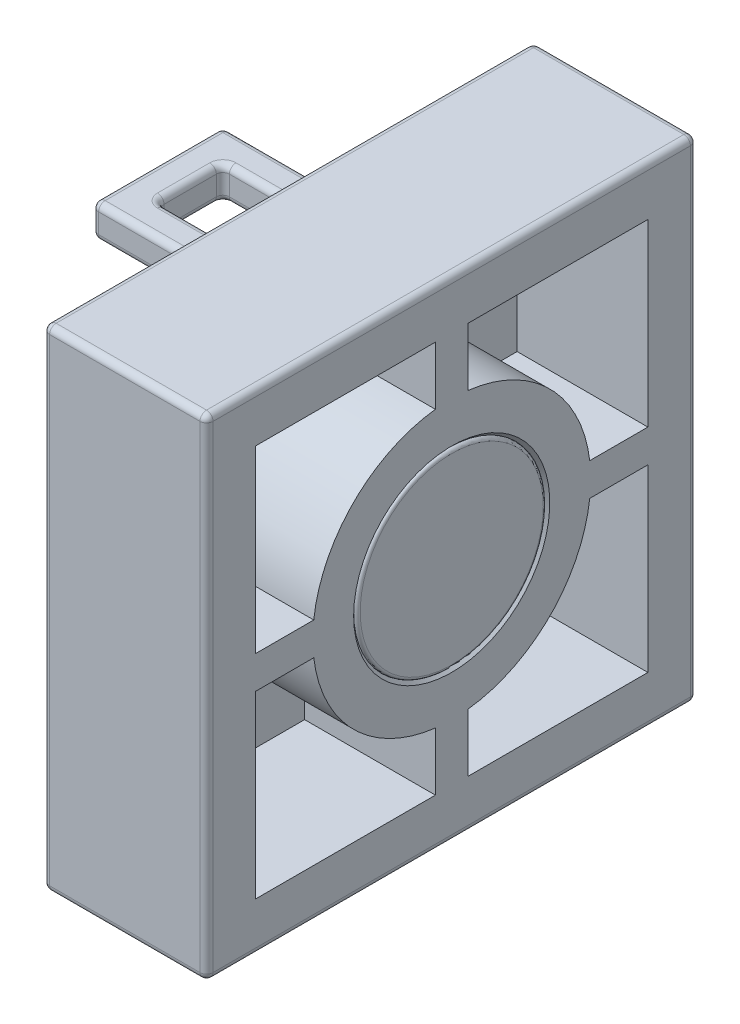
ISO-10303-21;
HEADER;
FILE_DESCRIPTION(('STEP AP214'),'2;1');
FILE_NAME('part.step','',(''),(''),'','','');
FILE_SCHEMA(('AUTOMOTIVE_DESIGN { 1 0 10303 214 1 1 1 1 }'));
ENDSEC;
DATA;
#1=APPLICATION_CONTEXT('core data for automotive mechanical design processes');
#2=APPLICATION_PROTOCOL_DEFINITION('international standard','automotive_design',2000,#1);
#3=PRODUCT_CONTEXT('',#1,'mechanical');
#4=PRODUCT('Part','Part','',(#3));
#5=PRODUCT_RELATED_PRODUCT_CATEGORY('part','',(#4));
#6=PRODUCT_DEFINITION_FORMATION('','',#4);
#7=PRODUCT_DEFINITION_CONTEXT('part definition',#1,'design');
#8=PRODUCT_DEFINITION('design','',#6,#7);
#9=PRODUCT_DEFINITION_SHAPE('','',#8);
#10=(LENGTH_UNIT() NAMED_UNIT(*) SI_UNIT(.MILLI.,.METRE.));
#11=(NAMED_UNIT(*) PLANE_ANGLE_UNIT() SI_UNIT($,.RADIAN.));
#12=(NAMED_UNIT(*) SI_UNIT($,.STERADIAN.) SOLID_ANGLE_UNIT());
#13=UNCERTAINTY_MEASURE_WITH_UNIT(LENGTH_MEASURE(1.E-05),#10,'distance_accuracy_value','');
#14=(GEOMETRIC_REPRESENTATION_CONTEXT(3) GLOBAL_UNCERTAINTY_ASSIGNED_CONTEXT((#13)) GLOBAL_UNIT_ASSIGNED_CONTEXT((#10,
#11,#12)) REPRESENTATION_CONTEXT('',''));
#15=CARTESIAN_POINT('',(0.,0.,0.));
#16=DIRECTION('',(0.,0.,1.));
#17=DIRECTION('',(1.,0.,0.));
#18=AXIS2_PLACEMENT_3D('',#15,#16,#17);
#19=CARTESIAN_POINT('',(2.5,0.,-7.5));
#20=DIRECTION('',(-1.,0.,0.));
#21=DIRECTION('',(0.,0.,1.));
#22=AXIS2_PLACEMENT_3D('',#19,#20,#21);
#23=PLANE('',#22);
#24=DIRECTION('',(0.,0.,1.));
#25=VECTOR('',#24,1.);
#26=CARTESIAN_POINT('',(2.5,7.3,-7.5));
#27=LINE('',#26,#25);
#28=CARTESIAN_POINT('',(2.5,7.3,-0.2));
#29=VERTEX_POINT('',#28);
#30=CARTESIAN_POINT('',(2.5,7.3,-14.8));
#31=VERTEX_POINT('',#30);
#32=EDGE_CURVE('E1421',#29,#31,#27,.F.);
#33=ORIENTED_EDGE('',*,*,#32,.T.);
#34=DIRECTION('',(0.,1.,0.));
#35=VECTOR('',#34,1.);
#36=CARTESIAN_POINT('',(2.5,0.,-14.8));
#37=LINE('',#36,#35);
#38=CARTESIAN_POINT('',(2.5,-7.3,-14.8));
#39=VERTEX_POINT('',#38);
#40=EDGE_CURVE('E1423',#31,#39,#37,.F.);
#41=ORIENTED_EDGE('',*,*,#40,.T.);
#42=DIRECTION('',(0.,0.,-1.));
#43=VECTOR('',#42,1.);
#44=CARTESIAN_POINT('',(2.5,-7.3,-7.5));
#45=LINE('',#44,#43);
#46=CARTESIAN_POINT('',(2.5,-7.3,-0.2));
#47=VERTEX_POINT('',#46);
#48=EDGE_CURVE('E1417',#39,#47,#45,.F.);
#49=ORIENTED_EDGE('',*,*,#48,.T.);
#50=DIRECTION('',(0.,1.,0.));
#51=VECTOR('',#50,1.);
#52=CARTESIAN_POINT('',(2.5,7.3,-0.2));
#53=LINE('',#52,#51);
#54=EDGE_CURVE('E1419',#47,#29,#53,.T.);
#55=ORIENTED_EDGE('',*,*,#54,.T.);
#56=EDGE_LOOP('',(#33,#41,#49,#55));
#57=FACE_BOUND('',#56,.T.);
#58=CARTESIAN_POINT('',(2.5,-5.2,-9.3));
#59=DIRECTION('',(-1.,0.,0.));
#60=DIRECTION('',(0.,0.,1.));
#61=AXIS2_PLACEMENT_3D('',#58,#59,#60);
#62=CIRCLE('',#61,0.4);
#63=CARTESIAN_POINT('',(2.5,-4.8,-9.3));
#64=VERTEX_POINT('',#63);
#65=CARTESIAN_POINT('',(2.5,-5.2,-9.7));
#66=VERTEX_POINT('',#65);
#67=EDGE_CURVE('E904',#64,#66,#62,.T.);
#68=ORIENTED_EDGE('',*,*,#67,.F.);
#69=DIRECTION('',(0.,0.,1.));
#70=VECTOR('',#69,1.);
#71=CARTESIAN_POINT('',(2.5,-4.8,-7.5));
#72=LINE('',#71,#70);
#73=CARTESIAN_POINT('',(2.5,-4.8,-5.7));
#74=VERTEX_POINT('',#73);
#75=EDGE_CURVE('E902',#64,#74,#72,.T.);
#76=ORIENTED_EDGE('',*,*,#75,.T.);
#77=CARTESIAN_POINT('',(2.5,-5.2,-5.7));
#78=DIRECTION('',(-1.,0.,0.));
#79=DIRECTION('',(0.,0.,1.));
#80=AXIS2_PLACEMENT_3D('',#77,#78,#79);
#81=CIRCLE('',#80,0.4);
#82=CARTESIAN_POINT('',(2.5,-5.2,-5.3));
#83=VERTEX_POINT('',#82);
#84=EDGE_CURVE('E899',#83,#74,#81,.T.);
#85=ORIENTED_EDGE('',*,*,#84,.F.);
#86=DIRECTION('',(0.,-1.,0.));
#87=VECTOR('',#86,1.);
#88=CARTESIAN_POINT('',(2.5,-6.,-5.3));
#89=LINE('',#88,#87);
#90=CARTESIAN_POINT('',(2.5,-5.8,-5.3));
#91=VERTEX_POINT('',#90);
#92=EDGE_CURVE('E896',#83,#91,#89,.T.);
#93=ORIENTED_EDGE('',*,*,#92,.T.);
#94=CARTESIAN_POINT('',(2.5,-5.8,-5.7));
#95=DIRECTION('',(-1.,0.,0.));
#96=DIRECTION('',(0.,0.,1.));
#97=AXIS2_PLACEMENT_3D('',#94,#95,#96);
#98=CIRCLE('',#97,0.4);
#99=CARTESIAN_POINT('',(2.5,-6.2,-5.7));
#100=VERTEX_POINT('',#99);
#101=EDGE_CURVE('E893',#100,#91,#98,.T.);
#102=ORIENTED_EDGE('',*,*,#101,.F.);
#103=DIRECTION('',(0.,0.,1.));
#104=VECTOR('',#103,1.);
#105=CARTESIAN_POINT('',(2.5,-6.2,-9.5));
#106=LINE('',#105,#104);
#107=CARTESIAN_POINT('',(2.5,-6.2,-9.3));
#108=VERTEX_POINT('',#107);
#109=EDGE_CURVE('E889',#100,#108,#106,.F.);
#110=ORIENTED_EDGE('',*,*,#109,.T.);
#111=CARTESIAN_POINT('',(2.5,-5.8,-9.3));
#112=DIRECTION('',(-1.,0.,0.));
#113=DIRECTION('',(0.,0.,1.));
#114=AXIS2_PLACEMENT_3D('',#111,#112,#113);
#115=CIRCLE('',#114,0.4);
#116=CARTESIAN_POINT('',(2.5,-5.8,-9.7));
#117=VERTEX_POINT('',#116);
#118=EDGE_CURVE('E886',#117,#108,#115,.T.);
#119=ORIENTED_EDGE('',*,*,#118,.F.);
#120=DIRECTION('',(0.,-1.,0.));
#121=VECTOR('',#120,1.);
#122=CARTESIAN_POINT('',(2.5,-5.,-9.7));
#123=LINE('',#122,#121);
#124=EDGE_CURVE('E891',#117,#66,#123,.F.);
#125=ORIENTED_EDGE('',*,*,#124,.T.);
#126=EDGE_LOOP('',(#68,#76,#85,#93,#102,#110,#119,#125));
#127=FACE_BOUND('',#126,.T.);
#128=CARTESIAN_POINT('',(2.5,5.8,-5.7));
#129=DIRECTION('',(-1.,0.,0.));
#130=DIRECTION('',(0.,0.,1.));
#131=AXIS2_PLACEMENT_3D('',#128,#129,#130);
#132=CIRCLE('',#131,0.4);
#133=CARTESIAN_POINT('',(2.5,5.8,-5.3));
#134=VERTEX_POINT('',#133);
#135=CARTESIAN_POINT('',(2.5,6.2,-5.7));
#136=VERTEX_POINT('',#135);
#137=EDGE_CURVE('E925',#134,#136,#132,.T.);
#138=ORIENTED_EDGE('',*,*,#137,.F.);
#139=DIRECTION('',(0.,1.,0.));
#140=VECTOR('',#139,1.);
#141=CARTESIAN_POINT('',(2.5,0.,-5.3));
#142=LINE('',#141,#140);
#143=CARTESIAN_POINT('',(2.5,5.2,-5.3));
#144=VERTEX_POINT('',#143);
#145=EDGE_CURVE('E923',#134,#144,#142,.F.);
#146=ORIENTED_EDGE('',*,*,#145,.T.);
#147=CARTESIAN_POINT('',(2.5,5.2,-5.7));
#148=DIRECTION('',(-1.,0.,0.));
#149=DIRECTION('',(0.,0.,1.));
#150=AXIS2_PLACEMENT_3D('',#147,#148,#149);
#151=CIRCLE('',#150,0.4);
#152=CARTESIAN_POINT('',(2.5,4.8,-5.7));
#153=VERTEX_POINT('',#152);
#154=EDGE_CURVE('E920',#153,#144,#151,.T.);
#155=ORIENTED_EDGE('',*,*,#154,.F.);
#156=DIRECTION('',(0.,0.,1.));
#157=VECTOR('',#156,1.);
#158=CARTESIAN_POINT('',(2.5,4.8,-7.5));
#159=LINE('',#158,#157);
#160=CARTESIAN_POINT('',(2.5,4.8,-9.3));
#161=VERTEX_POINT('',#160);
#162=EDGE_CURVE('E917',#153,#161,#159,.F.);
#163=ORIENTED_EDGE('',*,*,#162,.T.);
#164=CARTESIAN_POINT('',(2.5,5.2,-9.3));
#165=DIRECTION('',(-1.,0.,0.));
#166=DIRECTION('',(0.,0.,1.));
#167=AXIS2_PLACEMENT_3D('',#164,#165,#166);
#168=CIRCLE('',#167,0.4);
#169=CARTESIAN_POINT('',(2.5,5.2,-9.7));
#170=VERTEX_POINT('',#169);
#171=EDGE_CURVE('E914',#170,#161,#168,.T.);
#172=ORIENTED_EDGE('',*,*,#171,.F.);
#173=DIRECTION('',(0.,1.,0.));
#174=VECTOR('',#173,1.);
#175=CARTESIAN_POINT('',(2.5,0.,-9.7));
#176=LINE('',#175,#174);
#177=CARTESIAN_POINT('',(2.5,5.8,-9.7));
#178=VERTEX_POINT('',#177);
#179=EDGE_CURVE('E910',#170,#178,#176,.T.);
#180=ORIENTED_EDGE('',*,*,#179,.T.);
#181=CARTESIAN_POINT('',(2.5,5.8,-9.3));
#182=DIRECTION('',(-1.,0.,0.));
#183=DIRECTION('',(0.,0.,1.));
#184=AXIS2_PLACEMENT_3D('',#181,#182,#183);
#185=CIRCLE('',#184,0.4);
#186=CARTESIAN_POINT('',(2.5,6.2,-9.3));
#187=VERTEX_POINT('',#186);
#188=EDGE_CURVE('E907',#187,#178,#185,.T.);
#189=ORIENTED_EDGE('',*,*,#188,.F.);
#190=DIRECTION('',(0.,0.,1.));
#191=VECTOR('',#190,1.);
#192=CARTESIAN_POINT('',(2.5,6.2,-5.5));
#193=LINE('',#192,#191);
#194=EDGE_CURVE('E912',#187,#136,#193,.T.);
#195=ORIENTED_EDGE('',*,*,#194,.T.);
#196=EDGE_LOOP('',(#138,#146,#155,#163,#172,#180,#189,#195));
#197=FACE_BOUND('',#196,.T.);
#198=ADVANCED_FACE('F39',(#57,#127,#197),#23,.T.);
#199=CARTESIAN_POINT('',(7.5,-7.5,-15.));
#200=DIRECTION('',(1.,0.,0.));
#201=DIRECTION('',(0.,0.,-1.));
#202=AXIS2_PLACEMENT_3D('',#199,#200,#201);
#203=PLANE('',#202);
#204=CARTESIAN_POINT('',(7.5,0.,-7.5));
#205=DIRECTION('',(1.,0.,0.));
#206=DIRECTION('',(0.,0.,-1.));
#207=AXIS2_PLACEMENT_3D('',#204,#205,#206);
#208=CIRCLE('',#207,2.8);
#209=CARTESIAN_POINT('',(7.5,0.,-10.3));
#210=VERTEX_POINT('',#209);
#211=EDGE_CURVE('E821',#210,#210,#208,.T.);
#212=ORIENTED_EDGE('',*,*,#211,.T.);
#213=EDGE_LOOP('',(#212));
#214=FACE_BOUND('',#213,.T.);
#215=ADVANCED_FACE('F1490',(#214),#203,.T.);
#216=CARTESIAN_POINT('',(7.4,0.,-7.5));
#217=DIRECTION('',(1.,0.,0.));
#218=DIRECTION('',(0.,0.,-1.));
#219=AXIS2_PLACEMENT_3D('',#216,#217,#218);
#220=TOROIDAL_SURFACE('',#219,2.8,0.1);
#221=ORIENTED_EDGE('',*,*,#211,.F.);
#222=EDGE_LOOP('',(#221));
#223=FACE_BOUND('',#222,.T.);
#224=CARTESIAN_POINT('',(7.4,0.,-7.5));
#225=DIRECTION('',(-1.,0.,0.));
#226=DIRECTION('',(0.,0.,1.));
#227=AXIS2_PLACEMENT_3D('',#224,#225,#226);
#228=CIRCLE('',#227,2.9);
#229=CARTESIAN_POINT('',(7.4,0.,-4.6));
#230=VERTEX_POINT('',#229);
#231=EDGE_CURVE('E641',#230,#230,#228,.T.);
#232=ORIENTED_EDGE('',*,*,#231,.F.);
#233=EDGE_LOOP('',(#232));
#234=FACE_BOUND('',#233,.T.);
#235=ADVANCED_FACE('F1497',(#223,#234),#220,.T.);
#236=CARTESIAN_POINT('',(3.5,0.,-7.5));
#237=DIRECTION('',(1.,0.,0.));
#238=DIRECTION('',(0.,0.,-1.));
#239=AXIS2_PLACEMENT_3D('',#236,#237,#238);
#240=PLANE('',#239);
#241=DIRECTION('',(0.,0.,1.));
#242=VECTOR('',#241,1.);
#243=CARTESIAN_POINT('',(3.5,6.,-7.));
#244=LINE('',#243,#242);
#245=CARTESIAN_POINT('',(3.5,6.,-7.));
#246=VERTEX_POINT('',#245);
#247=CARTESIAN_POINT('',(3.5,6.,-1.5));
#248=VERTEX_POINT('',#247);
#249=EDGE_CURVE('E614',#246,#248,#244,.T.);
#250=ORIENTED_EDGE('',*,*,#249,.T.);
#251=DIRECTION('',(0.,-1.,0.));
#252=VECTOR('',#251,1.);
#253=CARTESIAN_POINT('',(3.5,6.,-1.5));
#254=LINE('',#253,#252);
#255=CARTESIAN_POINT('',(3.5,0.499999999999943,-1.50000000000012));
#256=VERTEX_POINT('',#255);
#257=EDGE_CURVE('E625',#248,#256,#254,.T.);
#258=ORIENTED_EDGE('',*,*,#257,.T.);
#259=DIRECTION('',(0.,0.,-1.));
#260=VECTOR('',#259,1.);
#261=CARTESIAN_POINT('',(3.5,0.499999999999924,-3.27951424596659));
#262=LINE('',#261,#260);
#263=CARTESIAN_POINT('',(3.5,0.499999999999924,-3.27951424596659));
#264=VERTEX_POINT('',#263);
#265=EDGE_CURVE('E630',#256,#264,#262,.T.);
#266=ORIENTED_EDGE('',*,*,#265,.T.);
#267=CARTESIAN_POINT('',(3.5,0.,-7.5));
#268=DIRECTION('',(-1.,0.,0.));
#269=DIRECTION('',(0.,0.,-1.));
#270=AXIS2_PLACEMENT_3D('',#267,#268,#269);
#271=CIRCLE('',#270,4.24999999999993);
#272=CARTESIAN_POINT('',(3.5,4.22048575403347,-7.00000000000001));
#273=VERTEX_POINT('',#272);
#274=EDGE_CURVE('E645',#264,#273,#271,.T.);
#275=ORIENTED_EDGE('',*,*,#274,.T.);
#276=DIRECTION('',(0.,1.,0.));
#277=VECTOR('',#276,1.);
#278=CARTESIAN_POINT('',(3.5,4.22048575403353,-7.));
#279=LINE('',#278,#277);
#280=EDGE_CURVE('E622',#273,#246,#279,.T.);
#281=ORIENTED_EDGE('',*,*,#280,.T.);
#282=EDGE_LOOP('',(#250,#258,#266,#275,#281));
#283=FACE_BOUND('',#282,.T.);
#284=ADVANCED_FACE('F632',(#283),#240,.T.);
#285=CARTESIAN_POINT('',(3.5,0.,-7.5));
#286=DIRECTION('',(1.,0.,0.));
#287=DIRECTION('',(0.,0.,-1.));
#288=AXIS2_PLACEMENT_3D('',#285,#286,#287);
#289=PLANE('',#288);
#290=DIRECTION('',(0.,-1.,0.));
#291=VECTOR('',#290,1.);
#292=CARTESIAN_POINT('',(3.5,-0.500000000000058,-1.50000000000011));
#293=LINE('',#292,#291);
#294=CARTESIAN_POINT('',(3.5,-0.500000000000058,-1.50000000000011));
#295=VERTEX_POINT('',#294);
#296=CARTESIAN_POINT('',(3.5,-6.,-1.5));
#297=VERTEX_POINT('',#296);
#298=EDGE_CURVE('E664',#295,#297,#293,.T.);
#299=ORIENTED_EDGE('',*,*,#298,.T.);
#300=DIRECTION('',(0.,0.,-1.));
#301=VECTOR('',#300,1.);
#302=CARTESIAN_POINT('',(3.5,-6.,-7.00000000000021));
#303=LINE('',#302,#301);
#304=CARTESIAN_POINT('',(3.5,-6.,-7.00000000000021));
#305=VERTEX_POINT('',#304);
#306=EDGE_CURVE('E667',#297,#305,#303,.T.);
#307=ORIENTED_EDGE('',*,*,#306,.T.);
#308=DIRECTION('',(0.,1.,0.));
#309=VECTOR('',#308,1.);
#310=CARTESIAN_POINT('',(3.5,-4.22048575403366,-7.00000000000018));
#311=LINE('',#310,#309);
#312=CARTESIAN_POINT('',(3.5,-4.22048575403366,-7.00000000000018));
#313=VERTEX_POINT('',#312);
#314=EDGE_CURVE('E671',#305,#313,#311,.T.);
#315=ORIENTED_EDGE('',*,*,#314,.T.);
#316=CARTESIAN_POINT('',(3.5,0.,-7.5));
#317=DIRECTION('',(-1.,0.,0.));
#318=DIRECTION('',(0.,0.,-1.));
#319=AXIS2_PLACEMENT_3D('',#316,#317,#318);
#320=CIRCLE('',#319,4.25);
#321=CARTESIAN_POINT('',(3.5,-0.500000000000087,-3.27951424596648));
#322=VERTEX_POINT('',#321);
#323=EDGE_CURVE('E674',#313,#322,#320,.T.);
#324=ORIENTED_EDGE('',*,*,#323,.T.);
#325=DIRECTION('',(0.,0.,1.));
#326=VECTOR('',#325,1.);
#327=CARTESIAN_POINT('',(3.5,-0.500000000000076,-3.27951424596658));
#328=LINE('',#327,#326);
#329=EDGE_CURVE('E677',#322,#295,#328,.T.);
#330=ORIENTED_EDGE('',*,*,#329,.T.);
#331=EDGE_LOOP('',(#299,#307,#315,#324,#330));
#332=FACE_BOUND('',#331,.T.);
#333=ADVANCED_FACE('F2674',(#332),#289,.T.);
#334=CARTESIAN_POINT('',(3.5,0.,-7.5));
#335=DIRECTION('',(1.,0.,0.));
#336=DIRECTION('',(0.,0.,-1.));
#337=AXIS2_PLACEMENT_3D('',#334,#335,#336);
#338=PLANE('',#337);
#339=DIRECTION('',(0.,1.,0.));
#340=VECTOR('',#339,1.);
#341=CARTESIAN_POINT('',(3.5,-0.499999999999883,-13.5000000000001));
#342=LINE('',#341,#340);
#343=CARTESIAN_POINT('',(3.5,-6.,-13.5));
#344=VERTEX_POINT('',#343);
#345=CARTESIAN_POINT('',(3.5,-0.499999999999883,-13.5000000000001));
#346=VERTEX_POINT('',#345);
#347=EDGE_CURVE('E704',#344,#346,#342,.T.);
#348=ORIENTED_EDGE('',*,*,#347,.T.);
#349=DIRECTION('',(0.,0.,1.));
#350=VECTOR('',#349,1.);
#351=CARTESIAN_POINT('',(3.5,-0.499999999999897,-11.7204857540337));
#352=LINE('',#351,#350);
#353=CARTESIAN_POINT('',(3.5,-0.499999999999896,-11.7204857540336));
#354=VERTEX_POINT('',#353);
#355=EDGE_CURVE('E707',#346,#354,#352,.T.);
#356=ORIENTED_EDGE('',*,*,#355,.T.);
#357=CARTESIAN_POINT('',(3.5,0.,-7.5));
#358=DIRECTION('',(-1.,0.,0.));
#359=DIRECTION('',(0.,0.,-1.));
#360=AXIS2_PLACEMENT_3D('',#357,#358,#359);
#361=CIRCLE('',#360,4.25000000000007);
#362=CARTESIAN_POINT('',(3.5,-4.22048575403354,-8.00000000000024));
#363=VERTEX_POINT('',#362);
#364=EDGE_CURVE('E711',#354,#363,#361,.T.);
#365=ORIENTED_EDGE('',*,*,#364,.T.);
#366=DIRECTION('',(0.,-1.,0.));
#367=VECTOR('',#366,1.);
#368=CARTESIAN_POINT('',(3.5,-4.22048575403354,-8.00000000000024));
#369=LINE('',#368,#367);
#370=CARTESIAN_POINT('',(3.5,-6.,-8.00000000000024));
#371=VERTEX_POINT('',#370);
#372=EDGE_CURVE('E714',#363,#371,#369,.T.);
#373=ORIENTED_EDGE('',*,*,#372,.T.);
#374=DIRECTION('',(0.,0.,-1.));
#375=VECTOR('',#374,1.);
#376=CARTESIAN_POINT('',(3.5,-6.,-13.5));
#377=LINE('',#376,#375);
#378=EDGE_CURVE('E717',#371,#344,#377,.T.);
#379=ORIENTED_EDGE('',*,*,#378,.T.);
#380=EDGE_LOOP('',(#348,#356,#365,#373,#379));
#381=FACE_BOUND('',#380,.T.);
#382=ADVANCED_FACE('F2694',(#381),#338,.T.);
#383=CARTESIAN_POINT('',(3.5,0.,-7.5));
#384=DIRECTION('',(1.,0.,0.));
#385=DIRECTION('',(0.,0.,-1.));
#386=AXIS2_PLACEMENT_3D('',#383,#384,#385);
#387=PLANE('',#386);
#388=DIRECTION('',(0.,-1.,0.));
#389=VECTOR('',#388,1.);
#390=CARTESIAN_POINT('',(3.5,4.22048575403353,-8.));
#391=LINE('',#390,#389);
#392=CARTESIAN_POINT('',(3.5,6.,-8.));
#393=VERTEX_POINT('',#392);
#394=CARTESIAN_POINT('',(3.5,4.2204857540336,-8.00000000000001));
#395=VERTEX_POINT('',#394);
#396=EDGE_CURVE('E744',#393,#395,#391,.T.);
#397=ORIENTED_EDGE('',*,*,#396,.T.);
#398=CARTESIAN_POINT('',(3.5,0.,-7.5));
#399=DIRECTION('',(-1.,0.,0.));
#400=DIRECTION('',(0.,0.,-1.));
#401=AXIS2_PLACEMENT_3D('',#398,#399,#400);
#402=CIRCLE('',#401,4.25000000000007);
#403=CARTESIAN_POINT('',(3.5,0.500000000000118,-11.7204857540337));
#404=VERTEX_POINT('',#403);
#405=EDGE_CURVE('E747',#395,#404,#402,.T.);
#406=ORIENTED_EDGE('',*,*,#405,.T.);
#407=DIRECTION('',(0.,0.,-1.));
#408=VECTOR('',#407,1.);
#409=CARTESIAN_POINT('',(3.5,0.500000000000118,-11.7204857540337));
#410=LINE('',#409,#408);
#411=CARTESIAN_POINT('',(3.5,0.500000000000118,-13.5000000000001));
#412=VERTEX_POINT('',#411);
#413=EDGE_CURVE('E751',#404,#412,#410,.T.);
#414=ORIENTED_EDGE('',*,*,#413,.T.);
#415=DIRECTION('',(0.,1.,0.));
#416=VECTOR('',#415,1.);
#417=CARTESIAN_POINT('',(3.5,6.,-13.5));
#418=LINE('',#417,#416);
#419=CARTESIAN_POINT('',(3.5,6.,-13.5));
#420=VERTEX_POINT('',#419);
#421=EDGE_CURVE('E754',#412,#420,#418,.T.);
#422=ORIENTED_EDGE('',*,*,#421,.T.);
#423=DIRECTION('',(0.,0.,1.));
#424=VECTOR('',#423,1.);
#425=CARTESIAN_POINT('',(3.5,6.,-13.5));
#426=LINE('',#425,#424);
#427=EDGE_CURVE('E757',#420,#393,#426,.T.);
#428=ORIENTED_EDGE('',*,*,#427,.T.);
#429=EDGE_LOOP('',(#397,#406,#414,#422,#428));
#430=FACE_BOUND('',#429,.T.);
#431=ADVANCED_FACE('F2670',(#430),#387,.T.);
#432=CARTESIAN_POINT('',(7.5,0.,-7.5));
#433=DIRECTION('',(1.,0.,0.));
#434=DIRECTION('',(0.,0.,-1.));
#435=AXIS2_PLACEMENT_3D('',#432,#433,#434);
#436=CONICAL_SURFACE('',#435,3.,0.785398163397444);
#437=ORIENTED_EDGE('',*,*,#231,.T.);
#438=EDGE_LOOP('',(#437));
#439=FACE_BOUND('',#438,.T.);
#440=CARTESIAN_POINT('',(7.5,0.,-7.5));
#441=DIRECTION('',(-1.,0.,0.));
#442=DIRECTION('',(0.,0.,1.));
#443=AXIS2_PLACEMENT_3D('',#440,#441,#442);
#444=CIRCLE('',#443,3.);
#445=CARTESIAN_POINT('',(7.5,0.,-4.5));
#446=VERTEX_POINT('',#445);
#447=EDGE_CURVE('E1211',#446,#446,#444,.T.);
#448=ORIENTED_EDGE('',*,*,#447,.F.);
#449=EDGE_LOOP('',(#448));
#450=FACE_BOUND('',#449,.T.);
#451=ADVANCED_FACE('F2667',(#439,#450),#436,.F.);
#452=CARTESIAN_POINT('',(3.5,6.,-1.5));
#453=DIRECTION('',(0.,0.,1.));
#454=DIRECTION('',(0.,-1.,0.));
#455=AXIS2_PLACEMENT_3D('',#452,#453,#454);
#456=PLANE('',#455);
#457=DIRECTION('',(0.,-1.,0.));
#458=VECTOR('',#457,1.);
#459=CARTESIAN_POINT('',(7.5,6.,-1.5));
#460=LINE('',#459,#458);
#461=CARTESIAN_POINT('',(7.5,6.,-1.5));
#462=VERTEX_POINT('',#461);
#463=CARTESIAN_POINT('',(7.5,0.499999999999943,-1.50000000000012));
#464=VERTEX_POINT('',#463);
#465=EDGE_CURVE('E649',#462,#464,#460,.T.);
#466=ORIENTED_EDGE('',*,*,#465,.T.);
#467=DIRECTION('',(1.,0.,0.));
#468=VECTOR('',#467,1.);
#469=CARTESIAN_POINT('',(3.5,0.499999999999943,-1.50000000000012));
#470=LINE('',#469,#468);
#471=EDGE_CURVE('E621',#256,#464,#470,.T.);
#472=ORIENTED_EDGE('',*,*,#471,.F.);
#473=ORIENTED_EDGE('',*,*,#257,.F.);
#474=DIRECTION('',(1.,0.,0.));
#475=VECTOR('',#474,1.);
#476=CARTESIAN_POINT('',(3.5,6.,-1.5));
#477=LINE('',#476,#475);
#478=EDGE_CURVE('E610',#248,#462,#477,.T.);
#479=ORIENTED_EDGE('',*,*,#478,.T.);
#480=EDGE_LOOP('',(#466,#472,#473,#479));
#481=FACE_BOUND('',#480,.T.);
#482=ADVANCED_FACE('F626',(#481),#456,.F.);
#483=CARTESIAN_POINT('',(3.5,0.499999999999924,-3.27951424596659));
#484=DIRECTION('',(0.,-1.,0.));
#485=DIRECTION('',(0.,0.,-1.));
#486=AXIS2_PLACEMENT_3D('',#483,#484,#485);
#487=PLANE('',#486);
#488=DIRECTION('',(0.,0.,-1.));
#489=VECTOR('',#488,1.);
#490=CARTESIAN_POINT('',(7.5,0.499999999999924,-3.27951424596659));
#491=LINE('',#490,#489);
#492=CARTESIAN_POINT('',(7.5,0.499999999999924,-3.27951424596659));
#493=VERTEX_POINT('',#492);
#494=EDGE_CURVE('E651',#464,#493,#491,.T.);
#495=ORIENTED_EDGE('',*,*,#494,.T.);
#496=DIRECTION('',(1.,0.,0.));
#497=VECTOR('',#496,1.);
#498=CARTESIAN_POINT('',(3.5,0.499999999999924,-3.27951424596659));
#499=LINE('',#498,#497);
#500=EDGE_CURVE('E661',#264,#493,#499,.T.);
#501=ORIENTED_EDGE('',*,*,#500,.F.);
#502=ORIENTED_EDGE('',*,*,#265,.F.);
#503=ORIENTED_EDGE('',*,*,#471,.T.);
#504=EDGE_LOOP('',(#495,#501,#502,#503));
#505=FACE_BOUND('',#504,.T.);
#506=ADVANCED_FACE('F2682',(#505),#487,.F.);
#507=CARTESIAN_POINT('',(3.5,0.,-7.5));
#508=DIRECTION('',(1.,0.,0.));
#509=DIRECTION('',(0.,0.,-1.));
#510=AXIS2_PLACEMENT_3D('',#507,#508,#509);
#511=CYLINDRICAL_SURFACE('',#510,4.24999999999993);
#512=CARTESIAN_POINT('',(7.5,0.,-7.5));
#513=DIRECTION('',(-1.,0.,0.));
#514=DIRECTION('',(0.,0.,-1.));
#515=AXIS2_PLACEMENT_3D('',#512,#513,#514);
#516=CIRCLE('',#515,4.24999999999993);
#517=CARTESIAN_POINT('',(7.5,4.22048575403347,-7.00000000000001));
#518=VERTEX_POINT('',#517);
#519=EDGE_CURVE('E638',#493,#518,#516,.T.);
#520=ORIENTED_EDGE('',*,*,#519,.T.);
#521=DIRECTION('',(1.,0.,0.));
#522=VECTOR('',#521,1.);
#523=CARTESIAN_POINT('',(3.5,4.22048575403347,-7.00000000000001));
#524=LINE('',#523,#522);
#525=EDGE_CURVE('E659',#273,#518,#524,.T.);
#526=ORIENTED_EDGE('',*,*,#525,.F.);
#527=ORIENTED_EDGE('',*,*,#274,.F.);
#528=ORIENTED_EDGE('',*,*,#500,.T.);
#529=EDGE_LOOP('',(#520,#526,#527,#528));
#530=FACE_BOUND('',#529,.T.);
#531=ADVANCED_FACE('F2678',(#530),#511,.T.);
#532=CARTESIAN_POINT('',(3.5,4.22048575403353,-7.));
#533=DIRECTION('',(0.,0.,-1.));
#534=DIRECTION('',(-1.,0.,0.));
#535=AXIS2_PLACEMENT_3D('',#532,#533,#534);
#536=PLANE('',#535);
#537=DIRECTION('',(0.,1.,0.));
#538=VECTOR('',#537,1.);
#539=CARTESIAN_POINT('',(7.5,4.22048575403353,-7.));
#540=LINE('',#539,#538);
#541=CARTESIAN_POINT('',(7.5,6.,-7.));
#542=VERTEX_POINT('',#541);
#543=EDGE_CURVE('E635',#518,#542,#540,.T.);
#544=ORIENTED_EDGE('',*,*,#543,.T.);
#545=DIRECTION('',(1.,0.,0.));
#546=VECTOR('',#545,1.);
#547=CARTESIAN_POINT('',(3.5,6.,-7.));
#548=LINE('',#547,#546);
#549=EDGE_CURVE('E656',#246,#542,#548,.T.);
#550=ORIENTED_EDGE('',*,*,#549,.F.);
#551=ORIENTED_EDGE('',*,*,#280,.F.);
#552=ORIENTED_EDGE('',*,*,#525,.T.);
#553=EDGE_LOOP('',(#544,#550,#551,#552));
#554=FACE_BOUND('',#553,.T.);
#555=ADVANCED_FACE('F2675',(#554),#536,.F.);
#556=CARTESIAN_POINT('',(3.5,6.,-7.));
#557=DIRECTION('',(0.,1.,0.));
#558=DIRECTION('',(0.,0.,1.));
#559=AXIS2_PLACEMENT_3D('',#556,#557,#558);
#560=PLANE('',#559);
#561=DIRECTION('',(0.,0.,1.));
#562=VECTOR('',#561,1.);
#563=CARTESIAN_POINT('',(7.5,6.,-7.));
#564=LINE('',#563,#562);
#565=EDGE_CURVE('E617',#542,#462,#564,.T.);
#566=ORIENTED_EDGE('',*,*,#565,.T.);
#567=ORIENTED_EDGE('',*,*,#478,.F.);
#568=ORIENTED_EDGE('',*,*,#249,.F.);
#569=ORIENTED_EDGE('',*,*,#549,.T.);
#570=EDGE_LOOP('',(#566,#567,#568,#569));
#571=FACE_BOUND('',#570,.T.);
#572=ADVANCED_FACE('F612',(#571),#560,.F.);
#573=CARTESIAN_POINT('',(3.5,-6.,-7.00000000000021));
#574=DIRECTION('',(0.,-1.,0.));
#575=DIRECTION('',(0.,0.,-1.));
#576=AXIS2_PLACEMENT_3D('',#573,#574,#575);
#577=PLANE('',#576);
#578=DIRECTION('',(0.,0.,-1.));
#579=VECTOR('',#578,1.);
#580=CARTESIAN_POINT('',(7.5,-6.,-7.00000000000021));
#581=LINE('',#580,#579);
#582=CARTESIAN_POINT('',(7.5,-6.,-1.5));
#583=VERTEX_POINT('',#582);
#584=CARTESIAN_POINT('',(7.5,-6.,-7.00000000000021));
#585=VERTEX_POINT('',#584);
#586=EDGE_CURVE('E682',#583,#585,#581,.T.);
#587=ORIENTED_EDGE('',*,*,#586,.T.);
#588=DIRECTION('',(1.,0.,0.));
#589=VECTOR('',#588,1.);
#590=CARTESIAN_POINT('',(3.5,-6.,-7.00000000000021));
#591=LINE('',#590,#589);
#592=EDGE_CURVE('E700',#305,#585,#591,.T.);
#593=ORIENTED_EDGE('',*,*,#592,.F.);
#594=ORIENTED_EDGE('',*,*,#306,.F.);
#595=DIRECTION('',(1.,0.,0.));
#596=VECTOR('',#595,1.);
#597=CARTESIAN_POINT('',(3.5,-6.,-1.5));
#598=LINE('',#597,#596);
#599=EDGE_CURVE('E680',#297,#583,#598,.T.);
#600=ORIENTED_EDGE('',*,*,#599,.T.);
#601=EDGE_LOOP('',(#587,#593,#594,#600));
#602=FACE_BOUND('',#601,.T.);
#603=ADVANCED_FACE('F2691',(#602),#577,.F.);
#604=CARTESIAN_POINT('',(3.5,-4.22048575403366,-7.00000000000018));
#605=DIRECTION('',(0.,0.,-1.));
#606=DIRECTION('',(0.,1.,0.));
#607=AXIS2_PLACEMENT_3D('',#604,#605,#606);
#608=PLANE('',#607);
#609=DIRECTION('',(0.,1.,0.));
#610=VECTOR('',#609,1.);
#611=CARTESIAN_POINT('',(7.5,-4.22048575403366,-7.00000000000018));
#612=LINE('',#611,#610);
#613=CARTESIAN_POINT('',(7.5,-4.22048575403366,-7.00000000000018));
#614=VERTEX_POINT('',#613);
#615=EDGE_CURVE('E685',#585,#614,#612,.T.);
#616=ORIENTED_EDGE('',*,*,#615,.T.);
#617=DIRECTION('',(1.,0.,0.));
#618=VECTOR('',#617,1.);
#619=CARTESIAN_POINT('',(3.5,-4.22048575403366,-7.00000000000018));
#620=LINE('',#619,#618);
#621=EDGE_CURVE('E698',#313,#614,#620,.T.);
#622=ORIENTED_EDGE('',*,*,#621,.F.);
#623=ORIENTED_EDGE('',*,*,#314,.F.);
#624=ORIENTED_EDGE('',*,*,#592,.T.);
#625=EDGE_LOOP('',(#616,#622,#623,#624));
#626=FACE_BOUND('',#625,.T.);
#627=ADVANCED_FACE('F2704',(#626),#608,.F.);
#628=CARTESIAN_POINT('',(3.5,0.,-7.5));
#629=DIRECTION('',(1.,0.,0.));
#630=DIRECTION('',(0.,0.,-1.));
#631=AXIS2_PLACEMENT_3D('',#628,#629,#630);
#632=CYLINDRICAL_SURFACE('',#631,4.25);
#633=CARTESIAN_POINT('',(7.5,0.,-7.5));
#634=DIRECTION('',(-1.,0.,0.));
#635=DIRECTION('',(0.,0.,-1.));
#636=AXIS2_PLACEMENT_3D('',#633,#634,#635);
#637=CIRCLE('',#636,4.25);
#638=CARTESIAN_POINT('',(7.5,-0.500000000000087,-3.27951424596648));
#639=VERTEX_POINT('',#638);
#640=EDGE_CURVE('E688',#614,#639,#637,.T.);
#641=ORIENTED_EDGE('',*,*,#640,.T.);
#642=DIRECTION('',(1.,0.,0.));
#643=VECTOR('',#642,1.);
#644=CARTESIAN_POINT('',(3.5,-0.500000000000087,-3.27951424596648));
#645=LINE('',#644,#643);
#646=EDGE_CURVE('E696',#322,#639,#645,.T.);
#647=ORIENTED_EDGE('',*,*,#646,.F.);
#648=ORIENTED_EDGE('',*,*,#323,.F.);
#649=ORIENTED_EDGE('',*,*,#621,.T.);
#650=EDGE_LOOP('',(#641,#647,#648,#649));
#651=FACE_BOUND('',#650,.T.);
#652=ADVANCED_FACE('F2700',(#651),#632,.T.);
#653=CARTESIAN_POINT('',(3.5,-0.500000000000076,-3.27951424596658));
#654=DIRECTION('',(0.,1.,0.));
#655=DIRECTION('',(0.,0.,1.));
#656=AXIS2_PLACEMENT_3D('',#653,#654,#655);
#657=PLANE('',#656);
#658=DIRECTION('',(0.,0.,1.));
#659=VECTOR('',#658,1.);
#660=CARTESIAN_POINT('',(7.5,-0.500000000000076,-3.27951424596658));
#661=LINE('',#660,#659);
#662=CARTESIAN_POINT('',(7.5,-0.500000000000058,-1.50000000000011));
#663=VERTEX_POINT('',#662);
#664=EDGE_CURVE('E668',#639,#663,#661,.T.);
#665=ORIENTED_EDGE('',*,*,#664,.T.);
#666=DIRECTION('',(1.,0.,0.));
#667=VECTOR('',#666,1.);
#668=CARTESIAN_POINT('',(3.5,-0.500000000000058,-1.50000000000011));
#669=LINE('',#668,#667);
#670=EDGE_CURVE('E693',#295,#663,#669,.T.);
#671=ORIENTED_EDGE('',*,*,#670,.F.);
#672=ORIENTED_EDGE('',*,*,#329,.F.);
#673=ORIENTED_EDGE('',*,*,#646,.T.);
#674=EDGE_LOOP('',(#665,#671,#672,#673));
#675=FACE_BOUND('',#674,.T.);
#676=ADVANCED_FACE('F2696',(#675),#657,.F.);
#677=CARTESIAN_POINT('',(3.5,-0.500000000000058,-1.50000000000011));
#678=DIRECTION('',(0.,0.,1.));
#679=DIRECTION('',(0.,-1.,0.));
#680=AXIS2_PLACEMENT_3D('',#677,#678,#679);
#681=PLANE('',#680);
#682=DIRECTION('',(0.,-1.,0.));
#683=VECTOR('',#682,1.);
#684=CARTESIAN_POINT('',(7.5,-0.500000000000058,-1.50000000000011));
#685=LINE('',#684,#683);
#686=EDGE_CURVE('E658',#663,#583,#685,.T.);
#687=ORIENTED_EDGE('',*,*,#686,.T.);
#688=ORIENTED_EDGE('',*,*,#599,.F.);
#689=ORIENTED_EDGE('',*,*,#298,.F.);
#690=ORIENTED_EDGE('',*,*,#670,.T.);
#691=EDGE_LOOP('',(#687,#688,#689,#690));
#692=FACE_BOUND('',#691,.T.);
#693=ADVANCED_FACE('F2699',(#692),#681,.F.);
#694=CARTESIAN_POINT('',(3.5,-0.499999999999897,-11.7204857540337));
#695=DIRECTION('',(0.,1.,0.));
#696=DIRECTION('',(0.,0.,1.));
#697=AXIS2_PLACEMENT_3D('',#694,#695,#696);
#698=PLANE('',#697);
#699=DIRECTION('',(0.,0.,1.));
#700=VECTOR('',#699,1.);
#701=CARTESIAN_POINT('',(7.5,-0.499999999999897,-11.7204857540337));
#702=LINE('',#701,#700);
#703=CARTESIAN_POINT('',(7.5,-0.499999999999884,-13.5000000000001));
#704=VERTEX_POINT('',#703);
#705=CARTESIAN_POINT('',(7.5,-0.499999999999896,-11.7204857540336));
#706=VERTEX_POINT('',#705);
#707=EDGE_CURVE('E722',#704,#706,#702,.T.);
#708=ORIENTED_EDGE('',*,*,#707,.T.);
#709=DIRECTION('',(1.,0.,0.));
#710=VECTOR('',#709,1.);
#711=CARTESIAN_POINT('',(3.5,-0.499999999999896,-11.7204857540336));
#712=LINE('',#711,#710);
#713=EDGE_CURVE('E740',#354,#706,#712,.T.);
#714=ORIENTED_EDGE('',*,*,#713,.F.);
#715=ORIENTED_EDGE('',*,*,#355,.F.);
#716=DIRECTION('',(1.,0.,0.));
#717=VECTOR('',#716,1.);
#718=CARTESIAN_POINT('',(3.5,-0.499999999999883,-13.5000000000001));
#719=LINE('',#718,#717);
#720=EDGE_CURVE('E720',#346,#704,#719,.T.);
#721=ORIENTED_EDGE('',*,*,#720,.T.);
#722=EDGE_LOOP('',(#708,#714,#715,#721));
#723=FACE_BOUND('',#722,.T.);
#724=ADVANCED_FACE('F2714',(#723),#698,.F.);
#725=CARTESIAN_POINT('',(3.5,0.,-7.5));
#726=DIRECTION('',(1.,0.,0.));
#727=DIRECTION('',(0.,0.,-1.));
#728=AXIS2_PLACEMENT_3D('',#725,#726,#727);
#729=CYLINDRICAL_SURFACE('',#728,4.25000000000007);
#730=CARTESIAN_POINT('',(7.5,0.,-7.5));
#731=DIRECTION('',(-1.,0.,0.));
#732=DIRECTION('',(0.,0.,-1.));
#733=AXIS2_PLACEMENT_3D('',#730,#731,#732);
#734=CIRCLE('',#733,4.25000000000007);
#735=CARTESIAN_POINT('',(7.5,-4.22048575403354,-8.00000000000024));
#736=VERTEX_POINT('',#735);
#737=EDGE_CURVE('E725',#706,#736,#734,.T.);
#738=ORIENTED_EDGE('',*,*,#737,.T.);
#739=DIRECTION('',(1.,0.,0.));
#740=VECTOR('',#739,1.);
#741=CARTESIAN_POINT('',(3.5,-4.22048575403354,-8.00000000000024));
#742=LINE('',#741,#740);
#743=EDGE_CURVE('E738',#363,#736,#742,.T.);
#744=ORIENTED_EDGE('',*,*,#743,.F.);
#745=ORIENTED_EDGE('',*,*,#364,.F.);
#746=ORIENTED_EDGE('',*,*,#713,.T.);
#747=EDGE_LOOP('',(#738,#744,#745,#746));
#748=FACE_BOUND('',#747,.T.);
#749=ADVANCED_FACE('F2727',(#748),#729,.T.);
#750=CARTESIAN_POINT('',(3.5,-4.22048575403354,-8.00000000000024));
#751=DIRECTION('',(0.,0.,1.));
#752=DIRECTION('',(1.,0.,0.));
#753=AXIS2_PLACEMENT_3D('',#750,#751,#752);
#754=PLANE('',#753);
#755=DIRECTION('',(0.,-1.,0.));
#756=VECTOR('',#755,1.);
#757=CARTESIAN_POINT('',(7.5,-4.22048575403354,-8.00000000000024));
#758=LINE('',#757,#756);
#759=CARTESIAN_POINT('',(7.5,-6.,-8.00000000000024));
#760=VERTEX_POINT('',#759);
#761=EDGE_CURVE('E728',#736,#760,#758,.T.);
#762=ORIENTED_EDGE('',*,*,#761,.T.);
#763=DIRECTION('',(1.,0.,0.));
#764=VECTOR('',#763,1.);
#765=CARTESIAN_POINT('',(3.5,-6.,-8.00000000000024));
#766=LINE('',#765,#764);
#767=EDGE_CURVE('E736',#371,#760,#766,.T.);
#768=ORIENTED_EDGE('',*,*,#767,.F.);
#769=ORIENTED_EDGE('',*,*,#372,.F.);
#770=ORIENTED_EDGE('',*,*,#743,.T.);
#771=EDGE_LOOP('',(#762,#768,#769,#770));
#772=FACE_BOUND('',#771,.T.);
#773=ADVANCED_FACE('F2723',(#772),#754,.F.);
#774=CARTESIAN_POINT('',(3.5,-6.,-13.5));
#775=DIRECTION('',(0.,-1.,0.));
#776=DIRECTION('',(0.,0.,-1.));
#777=AXIS2_PLACEMENT_3D('',#774,#775,#776);
#778=PLANE('',#777);
#779=DIRECTION('',(0.,0.,-1.));
#780=VECTOR('',#779,1.);
#781=CARTESIAN_POINT('',(7.5,-6.,-13.5));
#782=LINE('',#781,#780);
#783=CARTESIAN_POINT('',(7.5,-6.,-13.5));
#784=VERTEX_POINT('',#783);
#785=EDGE_CURVE('E708',#760,#784,#782,.T.);
#786=ORIENTED_EDGE('',*,*,#785,.T.);
#787=DIRECTION('',(1.,0.,0.));
#788=VECTOR('',#787,1.);
#789=CARTESIAN_POINT('',(3.5,-6.,-13.5));
#790=LINE('',#789,#788);
#791=EDGE_CURVE('E733',#344,#784,#790,.T.);
#792=ORIENTED_EDGE('',*,*,#791,.F.);
#793=ORIENTED_EDGE('',*,*,#378,.F.);
#794=ORIENTED_EDGE('',*,*,#767,.T.);
#795=EDGE_LOOP('',(#786,#792,#793,#794));
#796=FACE_BOUND('',#795,.T.);
#797=ADVANCED_FACE('F2719',(#796),#778,.F.);
#798=CARTESIAN_POINT('',(3.5,-0.499999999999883,-13.5000000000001));
#799=DIRECTION('',(0.,0.,-1.));
#800=DIRECTION('',(0.,1.,0.));
#801=AXIS2_PLACEMENT_3D('',#798,#799,#800);
#802=PLANE('',#801);
#803=DIRECTION('',(0.,1.,0.));
#804=VECTOR('',#803,1.);
#805=CARTESIAN_POINT('',(7.5,-0.499999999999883,-13.5000000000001));
#806=LINE('',#805,#804);
#807=EDGE_CURVE('E695',#784,#704,#806,.T.);
#808=ORIENTED_EDGE('',*,*,#807,.T.);
#809=ORIENTED_EDGE('',*,*,#720,.F.);
#810=ORIENTED_EDGE('',*,*,#347,.F.);
#811=ORIENTED_EDGE('',*,*,#791,.T.);
#812=EDGE_LOOP('',(#808,#809,#810,#811));
#813=FACE_BOUND('',#812,.T.);
#814=ADVANCED_FACE('F2722',(#813),#802,.F.);
#815=CARTESIAN_POINT('',(3.5,0.,-7.5));
#816=DIRECTION('',(1.,0.,0.));
#817=DIRECTION('',(0.,0.,-1.));
#818=AXIS2_PLACEMENT_3D('',#815,#816,#817);
#819=CYLINDRICAL_SURFACE('',#818,4.25000000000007);
#820=CARTESIAN_POINT('',(7.5,0.,-7.5));
#821=DIRECTION('',(-1.,0.,0.));
#822=DIRECTION('',(0.,0.,-1.));
#823=AXIS2_PLACEMENT_3D('',#820,#821,#822);
#824=CIRCLE('',#823,4.25000000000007);
#825=CARTESIAN_POINT('',(7.5,4.2204857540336,-8.00000000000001));
#826=VERTEX_POINT('',#825);
#827=CARTESIAN_POINT('',(7.5,0.500000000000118,-11.7204857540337));
#828=VERTEX_POINT('',#827);
#829=EDGE_CURVE('E762',#826,#828,#824,.T.);
#830=ORIENTED_EDGE('',*,*,#829,.T.);
#831=DIRECTION('',(1.,0.,0.));
#832=VECTOR('',#831,1.);
#833=CARTESIAN_POINT('',(3.5,0.500000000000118,-11.7204857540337));
#834=LINE('',#833,#832);
#835=EDGE_CURVE('E780',#404,#828,#834,.T.);
#836=ORIENTED_EDGE('',*,*,#835,.F.);
#837=ORIENTED_EDGE('',*,*,#405,.F.);
#838=DIRECTION('',(1.,0.,0.));
#839=VECTOR('',#838,1.);
#840=CARTESIAN_POINT('',(3.5,4.2204857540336,-8.00000000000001));
#841=LINE('',#840,#839);
#842=EDGE_CURVE('E760',#395,#826,#841,.T.);
#843=ORIENTED_EDGE('',*,*,#842,.T.);
#844=EDGE_LOOP('',(#830,#836,#837,#843));
#845=FACE_BOUND('',#844,.T.);
#846=ADVANCED_FACE('F2737',(#845),#819,.T.);
#847=CARTESIAN_POINT('',(3.5,0.500000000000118,-11.7204857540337));
#848=DIRECTION('',(0.,-1.,0.));
#849=DIRECTION('',(0.,0.,-1.));
#850=AXIS2_PLACEMENT_3D('',#847,#848,#849);
#851=PLANE('',#850);
#852=DIRECTION('',(0.,0.,-1.));
#853=VECTOR('',#852,1.);
#854=CARTESIAN_POINT('',(7.5,0.500000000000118,-11.7204857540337));
#855=LINE('',#854,#853);
#856=CARTESIAN_POINT('',(7.5,0.500000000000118,-13.5000000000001));
#857=VERTEX_POINT('',#856);
#858=EDGE_CURVE('E765',#828,#857,#855,.T.);
#859=ORIENTED_EDGE('',*,*,#858,.T.);
#860=DIRECTION('',(1.,0.,0.));
#861=VECTOR('',#860,1.);
#862=CARTESIAN_POINT('',(3.5,0.500000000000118,-13.5000000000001));
#863=LINE('',#862,#861);
#864=EDGE_CURVE('E778',#412,#857,#863,.T.);
#865=ORIENTED_EDGE('',*,*,#864,.F.);
#866=ORIENTED_EDGE('',*,*,#413,.F.);
#867=ORIENTED_EDGE('',*,*,#835,.T.);
#868=EDGE_LOOP('',(#859,#865,#866,#867));
#869=FACE_BOUND('',#868,.T.);
#870=ADVANCED_FACE('F2749',(#869),#851,.F.);
#871=CARTESIAN_POINT('',(3.5,6.,-13.5));
#872=DIRECTION('',(0.,0.,-1.));
#873=DIRECTION('',(0.,1.,0.));
#874=AXIS2_PLACEMENT_3D('',#871,#872,#873);
#875=PLANE('',#874);
#876=DIRECTION('',(0.,1.,0.));
#877=VECTOR('',#876,1.);
#878=CARTESIAN_POINT('',(7.5,6.,-13.5));
#879=LINE('',#878,#877);
#880=CARTESIAN_POINT('',(7.5,6.,-13.5));
#881=VERTEX_POINT('',#880);
#882=EDGE_CURVE('E768',#857,#881,#879,.T.);
#883=ORIENTED_EDGE('',*,*,#882,.T.);
#884=DIRECTION('',(1.,0.,0.));
#885=VECTOR('',#884,1.);
#886=CARTESIAN_POINT('',(3.5,6.,-13.5));
#887=LINE('',#886,#885);
#888=EDGE_CURVE('E776',#420,#881,#887,.T.);
#889=ORIENTED_EDGE('',*,*,#888,.F.);
#890=ORIENTED_EDGE('',*,*,#421,.F.);
#891=ORIENTED_EDGE('',*,*,#864,.T.);
#892=EDGE_LOOP('',(#883,#889,#890,#891));
#893=FACE_BOUND('',#892,.T.);
#894=ADVANCED_FACE('F2745',(#893),#875,.F.);
#895=CARTESIAN_POINT('',(3.5,6.,-13.5));
#896=DIRECTION('',(0.,1.,0.));
#897=DIRECTION('',(0.,0.,1.));
#898=AXIS2_PLACEMENT_3D('',#895,#896,#897);
#899=PLANE('',#898);
#900=DIRECTION('',(0.,0.,1.));
#901=VECTOR('',#900,1.);
#902=CARTESIAN_POINT('',(7.5,6.,-13.5));
#903=LINE('',#902,#901);
#904=CARTESIAN_POINT('',(7.5,6.,-8.));
#905=VERTEX_POINT('',#904);
#906=EDGE_CURVE('E748',#881,#905,#903,.T.);
#907=ORIENTED_EDGE('',*,*,#906,.T.);
#908=DIRECTION('',(1.,0.,0.));
#909=VECTOR('',#908,1.);
#910=CARTESIAN_POINT('',(3.5,6.,-8.));
#911=LINE('',#910,#909);
#912=EDGE_CURVE('E773',#393,#905,#911,.T.);
#913=ORIENTED_EDGE('',*,*,#912,.F.);
#914=ORIENTED_EDGE('',*,*,#427,.F.);
#915=ORIENTED_EDGE('',*,*,#888,.T.);
#916=EDGE_LOOP('',(#907,#913,#914,#915));
#917=FACE_BOUND('',#916,.T.);
#918=ADVANCED_FACE('F2742',(#917),#899,.F.);
#919=CARTESIAN_POINT('',(3.5,4.22048575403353,-8.));
#920=DIRECTION('',(0.,0.,1.));
#921=DIRECTION('',(1.,0.,0.));
#922=AXIS2_PLACEMENT_3D('',#919,#920,#921);
#923=PLANE('',#922);
#924=DIRECTION('',(0.,-1.,0.));
#925=VECTOR('',#924,1.);
#926=CARTESIAN_POINT('',(7.5,4.22048575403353,-8.));
#927=LINE('',#926,#925);
#928=EDGE_CURVE('E735',#905,#826,#927,.T.);
#929=ORIENTED_EDGE('',*,*,#928,.T.);
#930=ORIENTED_EDGE('',*,*,#842,.F.);
#931=ORIENTED_EDGE('',*,*,#396,.F.);
#932=ORIENTED_EDGE('',*,*,#912,.T.);
#933=EDGE_LOOP('',(#929,#930,#931,#932));
#934=FACE_BOUND('',#933,.T.);
#935=ADVANCED_FACE('F1503',(#934),#923,.F.);
#936=DIRECTION('',(0.,0.,1.));
#937=VECTOR('',#936,1.);
#938=CARTESIAN_POINT('',(7.5,-7.3,-15.));
#939=LINE('',#938,#937);
#940=CARTESIAN_POINT('',(7.5,-7.3,-0.2));
#941=VERTEX_POINT('',#940);
#942=CARTESIAN_POINT('',(7.5,-7.3,-14.8));
#943=VERTEX_POINT('',#942);
#944=EDGE_CURVE('E786',#941,#943,#939,.F.);
#945=ORIENTED_EDGE('',*,*,#944,.T.);
#946=DIRECTION('',(0.,1.,0.));
#947=VECTOR('',#946,1.);
#948=CARTESIAN_POINT('',(7.5,-7.5,-14.8));
#949=LINE('',#948,#947);
#950=CARTESIAN_POINT('',(7.5,7.3,-14.8));
#951=VERTEX_POINT('',#950);
#952=EDGE_CURVE('E792',#943,#951,#949,.T.);
#953=ORIENTED_EDGE('',*,*,#952,.T.);
#954=DIRECTION('',(0.,0.,1.));
#955=VECTOR('',#954,1.);
#956=CARTESIAN_POINT('',(7.5,7.3,-15.));
#957=LINE('',#956,#955);
#958=CARTESIAN_POINT('',(7.5,7.3,-0.2));
#959=VERTEX_POINT('',#958);
#960=EDGE_CURVE('E789',#951,#959,#957,.T.);
#961=ORIENTED_EDGE('',*,*,#960,.T.);
#962=DIRECTION('',(0.,1.,0.));
#963=VECTOR('',#962,1.);
#964=CARTESIAN_POINT('',(7.5,-7.5,-0.2));
#965=LINE('',#964,#963);
#966=EDGE_CURVE('E784',#959,#941,#965,.F.);
#967=ORIENTED_EDGE('',*,*,#966,.T.);
#968=EDGE_LOOP('',(#945,#953,#961,#967));
#969=FACE_BOUND('',#968,.T.);
#970=ORIENTED_EDGE('',*,*,#928,.F.);
#971=ORIENTED_EDGE('',*,*,#906,.F.);
#972=ORIENTED_EDGE('',*,*,#882,.F.);
#973=ORIENTED_EDGE('',*,*,#858,.F.);
#974=ORIENTED_EDGE('',*,*,#829,.F.);
#975=EDGE_LOOP('',(#970,#971,#972,#973,#974));
#976=FACE_BOUND('',#975,.T.);
#977=ORIENTED_EDGE('',*,*,#807,.F.);
#978=ORIENTED_EDGE('',*,*,#785,.F.);
#979=ORIENTED_EDGE('',*,*,#761,.F.);
#980=ORIENTED_EDGE('',*,*,#737,.F.);
#981=ORIENTED_EDGE('',*,*,#707,.F.);
#982=EDGE_LOOP('',(#977,#978,#979,#980,#981));
#983=FACE_BOUND('',#982,.T.);
#984=ORIENTED_EDGE('',*,*,#686,.F.);
#985=ORIENTED_EDGE('',*,*,#664,.F.);
#986=ORIENTED_EDGE('',*,*,#640,.F.);
#987=ORIENTED_EDGE('',*,*,#615,.F.);
#988=ORIENTED_EDGE('',*,*,#586,.F.);
#989=EDGE_LOOP('',(#984,#985,#986,#987,#988));
#990=FACE_BOUND('',#989,.T.);
#991=ORIENTED_EDGE('',*,*,#565,.F.);
#992=ORIENTED_EDGE('',*,*,#543,.F.);
#993=ORIENTED_EDGE('',*,*,#519,.F.);
#994=ORIENTED_EDGE('',*,*,#494,.F.);
#995=ORIENTED_EDGE('',*,*,#465,.F.);
#996=EDGE_LOOP('',(#991,#992,#993,#994,#995));
#997=FACE_BOUND('',#996,.T.);
#998=ORIENTED_EDGE('',*,*,#447,.T.);
#999=EDGE_LOOP('',(#998));
#1000=FACE_BOUND('',#999,.T.);
#1001=ADVANCED_FACE('F1500',(#969,#976,#983,#990,#997,#1000),#203,.T.);
#1002=CARTESIAN_POINT('',(7.3,-7.5,-14.8));
#1003=DIRECTION('',(0.,1.,0.));
#1004=DIRECTION('',(0.,0.,1.));
#1005=AXIS2_PLACEMENT_3D('',#1002,#1003,#1004);
#1006=CYLINDRICAL_SURFACE('',#1005,0.2);
#1007=CARTESIAN_POINT('',(7.3,-7.3,-14.8));
#1008=DIRECTION('',(0.,-1.,0.));
#1009=DIRECTION('',(0.,0.,-1.));
#1010=AXIS2_PLACEMENT_3D('',#1007,#1008,#1009);
#1011=CIRCLE('',#1010,0.2);
#1012=CARTESIAN_POINT('',(7.3,-7.3,-15.));
#1013=VERTEX_POINT('',#1012);
#1014=EDGE_CURVE('E840',#943,#1013,#1011,.F.);
#1015=ORIENTED_EDGE('',*,*,#1014,.T.);
#1016=DIRECTION('',(0.,1.,0.));
#1017=VECTOR('',#1016,1.);
#1018=CARTESIAN_POINT('',(7.3,7.5,-15.));
#1019=LINE('',#1018,#1017);
#1020=CARTESIAN_POINT('',(7.3,7.3,-15.));
#1021=VERTEX_POINT('',#1020);
#1022=EDGE_CURVE('E816',#1021,#1013,#1019,.F.);
#1023=ORIENTED_EDGE('',*,*,#1022,.F.);
#1024=CARTESIAN_POINT('',(7.3,7.3,-14.8));
#1025=DIRECTION('',(0.,1.,0.));
#1026=DIRECTION('',(0.,0.,1.));
#1027=AXIS2_PLACEMENT_3D('',#1024,#1025,#1026);
#1028=CIRCLE('',#1027,0.2);
#1029=EDGE_CURVE('E831',#951,#1021,#1028,.T.);
#1030=ORIENTED_EDGE('',*,*,#1029,.F.);
#1031=ORIENTED_EDGE('',*,*,#952,.F.);
#1032=EDGE_LOOP('',(#1015,#1023,#1030,#1031));
#1033=FACE_BOUND('',#1032,.T.);
#1034=ADVANCED_FACE('F1545',(#1033),#1006,.T.);
#1035=CARTESIAN_POINT('',(7.3,7.5,-0.2));
#1036=DIRECTION('',(0.,-1.,0.));
#1037=DIRECTION('',(0.,0.,-1.));
#1038=AXIS2_PLACEMENT_3D('',#1035,#1036,#1037);
#1039=CYLINDRICAL_SURFACE('',#1038,0.2);
#1040=CARTESIAN_POINT('',(7.3,-7.3,-0.2));
#1041=DIRECTION('',(0.,-1.,0.));
#1042=DIRECTION('',(0.,0.,-1.));
#1043=AXIS2_PLACEMENT_3D('',#1040,#1041,#1042);
#1044=CIRCLE('',#1043,0.2);
#1045=CARTESIAN_POINT('',(7.3,-7.3,0.));
#1046=VERTEX_POINT('',#1045);
#1047=EDGE_CURVE('E837',#1046,#941,#1044,.F.);
#1048=ORIENTED_EDGE('',*,*,#1047,.T.);
#1049=ORIENTED_EDGE('',*,*,#966,.F.);
#1050=CARTESIAN_POINT('',(7.3,7.3,-0.2));
#1051=DIRECTION('',(0.,1.,0.));
#1052=DIRECTION('',(-1.,0.,0.));
#1053=AXIS2_PLACEMENT_3D('',#1050,#1051,#1052);
#1054=CIRCLE('',#1053,0.2);
#1055=CARTESIAN_POINT('',(7.3,7.3,0.));
#1056=VERTEX_POINT('',#1055);
#1057=EDGE_CURVE('E828',#1056,#959,#1054,.T.);
#1058=ORIENTED_EDGE('',*,*,#1057,.F.);
#1059=DIRECTION('',(0.,1.,0.));
#1060=VECTOR('',#1059,1.);
#1061=CARTESIAN_POINT('',(7.3,7.5,0.));
#1062=LINE('',#1061,#1060);
#1063=EDGE_CURVE('E802',#1046,#1056,#1062,.T.);
#1064=ORIENTED_EDGE('',*,*,#1063,.F.);
#1065=EDGE_LOOP('',(#1048,#1049,#1058,#1064));
#1066=FACE_BOUND('',#1065,.T.);
#1067=ADVANCED_FACE('F1528',(#1066),#1039,.T.);
#1068=CARTESIAN_POINT('',(7.3,7.3,-15.));
#1069=DIRECTION('',(0.,0.,1.));
#1070=DIRECTION('',(1.,0.,0.));
#1071=AXIS2_PLACEMENT_3D('',#1068,#1069,#1070);
#1072=CYLINDRICAL_SURFACE('',#1071,0.2);
#1073=CARTESIAN_POINT('',(7.3,7.3,-14.8));
#1074=DIRECTION('',(0.,0.,-1.));
#1075=DIRECTION('',(-1.,0.,0.));
#1076=AXIS2_PLACEMENT_3D('',#1073,#1074,#1075);
#1077=CIRCLE('',#1076,0.2);
#1078=CARTESIAN_POINT('',(7.3,7.5,-14.8));
#1079=VERTEX_POINT('',#1078);
#1080=EDGE_CURVE('E823',#951,#1079,#1077,.F.);
#1081=ORIENTED_EDGE('',*,*,#1080,.T.);
#1082=DIRECTION('',(0.,0.,1.));
#1083=VECTOR('',#1082,1.);
#1084=CARTESIAN_POINT('',(7.3,7.5,-15.));
#1085=LINE('',#1084,#1083);
#1086=CARTESIAN_POINT('',(7.3,7.5,-0.2));
#1087=VERTEX_POINT('',#1086);
#1088=EDGE_CURVE('E799',#1087,#1079,#1085,.F.);
#1089=ORIENTED_EDGE('',*,*,#1088,.F.);
#1090=CARTESIAN_POINT('',(7.3,7.3,-0.2));
#1091=DIRECTION('',(0.,0.,1.));
#1092=DIRECTION('',(1.,0.,0.));
#1093=AXIS2_PLACEMENT_3D('',#1090,#1091,#1092);
#1094=CIRCLE('',#1093,0.2);
#1095=EDGE_CURVE('E775',#1087,#959,#1094,.F.);
#1096=ORIENTED_EDGE('',*,*,#1095,.T.);
#1097=ORIENTED_EDGE('',*,*,#960,.F.);
#1098=EDGE_LOOP('',(#1081,#1089,#1096,#1097));
#1099=FACE_BOUND('',#1098,.T.);
#1100=ADVANCED_FACE('F1524',(#1099),#1072,.T.);
#1101=CARTESIAN_POINT('',(7.3,-7.3,-15.));
#1102=DIRECTION('',(0.,0.,1.));
#1103=DIRECTION('',(1.,0.,0.));
#1104=AXIS2_PLACEMENT_3D('',#1101,#1102,#1103);
#1105=CYLINDRICAL_SURFACE('',#1104,0.2);
#1106=CARTESIAN_POINT('',(7.3,-7.3,-0.2));
#1107=DIRECTION('',(0.,0.,1.));
#1108=DIRECTION('',(1.,0.,0.));
#1109=AXIS2_PLACEMENT_3D('',#1106,#1107,#1108);
#1110=CIRCLE('',#1109,0.2);
#1111=CARTESIAN_POINT('',(7.3,-7.5,-0.2));
#1112=VERTEX_POINT('',#1111);
#1113=EDGE_CURVE('E846',#1112,#941,#1110,.T.);
#1114=ORIENTED_EDGE('',*,*,#1113,.F.);
#1115=DIRECTION('',(0.,0.,1.));
#1116=VECTOR('',#1115,1.);
#1117=CARTESIAN_POINT('',(7.3,-7.5,-15.));
#1118=LINE('',#1117,#1116);
#1119=CARTESIAN_POINT('',(7.3,-7.5,-14.8));
#1120=VERTEX_POINT('',#1119);
#1121=EDGE_CURVE('E810',#1120,#1112,#1118,.T.);
#1122=ORIENTED_EDGE('',*,*,#1121,.F.);
#1123=CARTESIAN_POINT('',(7.3,-7.3,-14.8));
#1124=DIRECTION('',(0.,0.,-1.));
#1125=DIRECTION('',(-1.,0.,0.));
#1126=AXIS2_PLACEMENT_3D('',#1123,#1124,#1125);
#1127=CIRCLE('',#1126,0.2);
#1128=EDGE_CURVE('E849',#943,#1120,#1127,.T.);
#1129=ORIENTED_EDGE('',*,*,#1128,.F.);
#1130=ORIENTED_EDGE('',*,*,#944,.F.);
#1131=EDGE_LOOP('',(#1114,#1122,#1129,#1130));
#1132=FACE_BOUND('',#1131,.T.);
#1133=ADVANCED_FACE('F1527',(#1132),#1105,.T.);
#1134=CARTESIAN_POINT('',(7.3,-7.3,-14.8));
#1135=DIRECTION('',(0.,0.,1.));
#1136=DIRECTION('',(1.,0.,0.));
#1137=AXIS2_PLACEMENT_3D('',#1134,#1135,#1136);
#1138=SPHERICAL_SURFACE('',#1137,0.2);
#1139=ORIENTED_EDGE('',*,*,#1128,.T.);
#1140=CARTESIAN_POINT('',(7.3,-7.3,-14.8));
#1141=DIRECTION('',(1.,0.,0.));
#1142=DIRECTION('',(0.,0.,-1.));
#1143=AXIS2_PLACEMENT_3D('',#1140,#1141,#1142);
#1144=CIRCLE('',#1143,0.2);
#1145=EDGE_CURVE('E787',#1120,#1013,#1144,.T.);
#1146=ORIENTED_EDGE('',*,*,#1145,.T.);
#1147=ORIENTED_EDGE('',*,*,#1014,.F.);
#1148=EDGE_LOOP('',(#1139,#1146,#1147));
#1149=FACE_BOUND('',#1148,.T.);
#1150=ADVANCED_FACE('F1555',(#1149),#1138,.T.);
#1151=CARTESIAN_POINT('',(7.3,-7.3,-0.2));
#1152=DIRECTION('',(0.,0.,1.));
#1153=DIRECTION('',(1.,0.,0.));
#1154=AXIS2_PLACEMENT_3D('',#1151,#1152,#1153);
#1155=SPHERICAL_SURFACE('',#1154,0.2);
#1156=CARTESIAN_POINT('',(7.3,-7.3,-0.2));
#1157=DIRECTION('',(1.,0.,0.));
#1158=DIRECTION('',(0.,0.,-1.));
#1159=AXIS2_PLACEMENT_3D('',#1156,#1157,#1158);
#1160=CIRCLE('',#1159,0.2);
#1161=EDGE_CURVE('E843',#1046,#1112,#1160,.T.);
#1162=ORIENTED_EDGE('',*,*,#1161,.T.);
#1163=ORIENTED_EDGE('',*,*,#1113,.T.);
#1164=ORIENTED_EDGE('',*,*,#1047,.F.);
#1165=EDGE_LOOP('',(#1162,#1163,#1164));
#1166=FACE_BOUND('',#1165,.T.);
#1167=ADVANCED_FACE('F1538',(#1166),#1155,.T.);
#1168=CARTESIAN_POINT('',(7.3,7.3,-14.8));
#1169=DIRECTION('',(0.,0.,1.));
#1170=DIRECTION('',(1.,0.,0.));
#1171=AXIS2_PLACEMENT_3D('',#1168,#1169,#1170);
#1172=SPHERICAL_SURFACE('',#1171,0.2);
#1173=ORIENTED_EDGE('',*,*,#1029,.T.);
#1174=CARTESIAN_POINT('',(7.3,7.3,-14.8));
#1175=DIRECTION('',(1.,0.,0.));
#1176=DIRECTION('',(0.,0.,-1.));
#1177=AXIS2_PLACEMENT_3D('',#1174,#1175,#1176);
#1178=CIRCLE('',#1177,0.2);
#1179=EDGE_CURVE('E834',#1021,#1079,#1178,.T.);
#1180=ORIENTED_EDGE('',*,*,#1179,.T.);
#1181=ORIENTED_EDGE('',*,*,#1080,.F.);
#1182=EDGE_LOOP('',(#1173,#1180,#1181));
#1183=FACE_BOUND('',#1182,.T.);
#1184=ADVANCED_FACE('F1534',(#1183),#1172,.T.);
#1185=CARTESIAN_POINT('',(7.3,7.3,-0.2));
#1186=DIRECTION('',(0.,0.,1.));
#1187=DIRECTION('',(1.,0.,0.));
#1188=AXIS2_PLACEMENT_3D('',#1185,#1186,#1187);
#1189=SPHERICAL_SURFACE('',#1188,0.2);
#1190=CARTESIAN_POINT('',(7.3,7.3,-0.2));
#1191=DIRECTION('',(1.,0.,0.));
#1192=DIRECTION('',(0.,0.,-1.));
#1193=AXIS2_PLACEMENT_3D('',#1190,#1191,#1192);
#1194=CIRCLE('',#1193,0.2);
#1195=EDGE_CURVE('E825',#1087,#1056,#1194,.T.);
#1196=ORIENTED_EDGE('',*,*,#1195,.T.);
#1197=ORIENTED_EDGE('',*,*,#1057,.T.);
#1198=ORIENTED_EDGE('',*,*,#1095,.F.);
#1199=EDGE_LOOP('',(#1196,#1197,#1198));
#1200=FACE_BOUND('',#1199,.T.);
#1201=ADVANCED_FACE('F1530',(#1200),#1189,.T.);
#1202=CARTESIAN_POINT('',(-7.5,7.3,-0.2));
#1203=DIRECTION('',(1.,0.,0.));
#1204=DIRECTION('',(0.,0.,-1.));
#1205=AXIS2_PLACEMENT_3D('',#1202,#1203,#1204);
#1206=CYLINDRICAL_SURFACE('',#1205,0.2);
#1207=DIRECTION('',(-1.,0.,0.));
#1208=VECTOR('',#1207,1.);
#1209=CARTESIAN_POINT('',(7.5,7.5,-0.2));
#1210=LINE('',#1209,#1208);
#1211=CARTESIAN_POINT('',(2.7,7.5,-0.2));
#1212=VERTEX_POINT('',#1211);
#1213=EDGE_CURVE('E797',#1212,#1087,#1210,.F.);
#1214=ORIENTED_EDGE('',*,*,#1213,.F.);
#1215=CARTESIAN_POINT('',(2.7,7.3,-0.2));
#1216=DIRECTION('',(1.,0.,0.));
#1217=DIRECTION('',(0.,0.,-1.));
#1218=AXIS2_PLACEMENT_3D('',#1215,#1216,#1217);
#1219=CIRCLE('',#1218,0.2);
#1220=CARTESIAN_POINT('',(2.7,7.3,0.));
#1221=VERTEX_POINT('',#1220);
#1222=EDGE_CURVE('E1430',#1212,#1221,#1219,.T.);
#1223=ORIENTED_EDGE('',*,*,#1222,.T.);
#1224=DIRECTION('',(-1.,0.,0.));
#1225=VECTOR('',#1224,1.);
#1226=CARTESIAN_POINT('',(1.5,7.3,0.));
#1227=LINE('',#1226,#1225);
#1228=EDGE_CURVE('E806',#1056,#1221,#1227,.T.);
#1229=ORIENTED_EDGE('',*,*,#1228,.F.);
#1230=ORIENTED_EDGE('',*,*,#1195,.F.);
#1231=EDGE_LOOP('',(#1214,#1223,#1229,#1230));
#1232=FACE_BOUND('',#1231,.T.);
#1233=ADVANCED_FACE('F1533',(#1232),#1206,.T.);
#1234=CARTESIAN_POINT('',(-7.5,7.3,-14.8));
#1235=DIRECTION('',(-1.,0.,0.));
#1236=DIRECTION('',(0.,0.,1.));
#1237=AXIS2_PLACEMENT_3D('',#1234,#1235,#1236);
#1238=CYLINDRICAL_SURFACE('',#1237,0.2);
#1239=DIRECTION('',(-1.,0.,0.));
#1240=VECTOR('',#1239,1.);
#1241=CARTESIAN_POINT('',(-7.5,7.3,-15.));
#1242=LINE('',#1241,#1240);
#1243=CARTESIAN_POINT('',(2.7,7.3,-15.));
#1244=VERTEX_POINT('',#1243);
#1245=EDGE_CURVE('E814',#1244,#1021,#1242,.F.);
#1246=ORIENTED_EDGE('',*,*,#1245,.F.);
#1247=CARTESIAN_POINT('',(2.7,7.3,-14.8));
#1248=DIRECTION('',(-1.,0.,0.));
#1249=DIRECTION('',(0.,0.,1.));
#1250=AXIS2_PLACEMENT_3D('',#1247,#1248,#1249);
#1251=CIRCLE('',#1250,0.2);
#1252=CARTESIAN_POINT('',(2.7,7.5,-14.8));
#1253=VERTEX_POINT('',#1252);
#1254=EDGE_CURVE('E1426',#1244,#1253,#1251,.F.);
#1255=ORIENTED_EDGE('',*,*,#1254,.T.);
#1256=DIRECTION('',(-1.,0.,0.));
#1257=VECTOR('',#1256,1.);
#1258=CARTESIAN_POINT('',(-7.5,7.5,-14.8));
#1259=LINE('',#1258,#1257);
#1260=EDGE_CURVE('E794',#1079,#1253,#1259,.T.);
#1261=ORIENTED_EDGE('',*,*,#1260,.F.);
#1262=ORIENTED_EDGE('',*,*,#1179,.F.);
#1263=EDGE_LOOP('',(#1246,#1255,#1261,#1262));
#1264=FACE_BOUND('',#1263,.T.);
#1265=ADVANCED_FACE('F1517',(#1264),#1238,.T.);
#1266=CARTESIAN_POINT('',(-7.5,7.5,-15.));
#1267=DIRECTION('',(0.,1.,0.));
#1268=DIRECTION('',(0.,0.,1.));
#1269=AXIS2_PLACEMENT_3D('',#1266,#1267,#1268);
#1270=PLANE('',#1269);
#1271=ORIENTED_EDGE('',*,*,#1260,.T.);
#1272=DIRECTION('',(0.,0.,1.));
#1273=VECTOR('',#1272,1.);
#1274=CARTESIAN_POINT('',(2.7,7.5,-15.));
#1275=LINE('',#1274,#1273);
#1276=EDGE_CURVE('E1428',#1253,#1212,#1275,.T.);
#1277=ORIENTED_EDGE('',*,*,#1276,.T.);
#1278=ORIENTED_EDGE('',*,*,#1213,.T.);
#1279=ORIENTED_EDGE('',*,*,#1088,.T.);
#1280=EDGE_LOOP('',(#1271,#1277,#1278,#1279));
#1281=FACE_BOUND('',#1280,.T.);
#1282=ADVANCED_FACE('F1514',(#1281),#1270,.T.);
#1283=CARTESIAN_POINT('',(-7.5,-7.3,-14.8));
#1284=DIRECTION('',(1.,0.,0.));
#1285=DIRECTION('',(0.,0.,-1.));
#1286=AXIS2_PLACEMENT_3D('',#1283,#1284,#1285);
#1287=CYLINDRICAL_SURFACE('',#1286,0.2);
#1288=DIRECTION('',(1.,0.,0.));
#1289=VECTOR('',#1288,1.);
#1290=CARTESIAN_POINT('',(-7.5,-7.5,-14.8));
#1291=LINE('',#1290,#1289);
#1292=CARTESIAN_POINT('',(2.7,-7.5,-14.8));
#1293=VERTEX_POINT('',#1292);
#1294=EDGE_CURVE('E808',#1293,#1120,#1291,.T.);
#1295=ORIENTED_EDGE('',*,*,#1294,.F.);
#1296=CARTESIAN_POINT('',(2.7,-7.3,-14.8));
#1297=DIRECTION('',(1.,0.,0.));
#1298=DIRECTION('',(0.,0.,-1.));
#1299=AXIS2_PLACEMENT_3D('',#1296,#1297,#1298);
#1300=CIRCLE('',#1299,0.2);
#1301=CARTESIAN_POINT('',(2.7,-7.3,-15.));
#1302=VERTEX_POINT('',#1301);
#1303=EDGE_CURVE('E1142',#1293,#1302,#1300,.T.);
#1304=ORIENTED_EDGE('',*,*,#1303,.T.);
#1305=DIRECTION('',(1.,0.,0.));
#1306=VECTOR('',#1305,1.);
#1307=CARTESIAN_POINT('',(-7.5,-7.3,-15.));
#1308=LINE('',#1307,#1306);
#1309=EDGE_CURVE('E818',#1013,#1302,#1308,.F.);
#1310=ORIENTED_EDGE('',*,*,#1309,.F.);
#1311=ORIENTED_EDGE('',*,*,#1145,.F.);
#1312=EDGE_LOOP('',(#1295,#1304,#1310,#1311));
#1313=FACE_BOUND('',#1312,.T.);
#1314=ADVANCED_FACE('F1516',(#1313),#1287,.T.);
#1315=CARTESIAN_POINT('',(-7.5,-7.3,-0.2));
#1316=DIRECTION('',(-1.,0.,0.));
#1317=DIRECTION('',(0.,0.,1.));
#1318=AXIS2_PLACEMENT_3D('',#1315,#1316,#1317);
#1319=CYLINDRICAL_SURFACE('',#1318,0.2);
#1320=DIRECTION('',(1.,0.,0.));
#1321=VECTOR('',#1320,1.);
#1322=CARTESIAN_POINT('',(7.5,-7.3,0.));
#1323=LINE('',#1322,#1321);
#1324=CARTESIAN_POINT('',(2.7,-7.3,0.));
#1325=VERTEX_POINT('',#1324);
#1326=EDGE_CURVE('E804',#1325,#1046,#1323,.T.);
#1327=ORIENTED_EDGE('',*,*,#1326,.F.);
#1328=CARTESIAN_POINT('',(2.7,-7.3,-0.2));
#1329=DIRECTION('',(-1.,0.,0.));
#1330=DIRECTION('',(0.,0.,1.));
#1331=AXIS2_PLACEMENT_3D('',#1328,#1329,#1330);
#1332=CIRCLE('',#1331,0.2);
#1333=CARTESIAN_POINT('',(2.7,-7.5,-0.2));
#1334=VERTEX_POINT('',#1333);
#1335=EDGE_CURVE('E48',#1325,#1334,#1332,.F.);
#1336=ORIENTED_EDGE('',*,*,#1335,.T.);
#1337=DIRECTION('',(1.,0.,0.));
#1338=VECTOR('',#1337,1.);
#1339=CARTESIAN_POINT('',(1.5,-7.5,-0.2));
#1340=LINE('',#1339,#1338);
#1341=EDGE_CURVE('E812',#1112,#1334,#1340,.F.);
#1342=ORIENTED_EDGE('',*,*,#1341,.F.);
#1343=ORIENTED_EDGE('',*,*,#1161,.F.);
#1344=EDGE_LOOP('',(#1327,#1336,#1342,#1343));
#1345=FACE_BOUND('',#1344,.T.);
#1346=ADVANCED_FACE('F1522',(#1345),#1319,.T.);
#1347=CARTESIAN_POINT('',(-7.5,-7.5,-15.));
#1348=DIRECTION('',(0.,-1.,0.));
#1349=DIRECTION('',(0.,0.,-1.));
#1350=AXIS2_PLACEMENT_3D('',#1347,#1348,#1349);
#1351=PLANE('',#1350);
#1352=ORIENTED_EDGE('',*,*,#1341,.T.);
#1353=DIRECTION('',(0.,0.,-1.));
#1354=VECTOR('',#1353,1.);
#1355=CARTESIAN_POINT('',(2.7,-7.5,-15.));
#1356=LINE('',#1355,#1354);
#1357=EDGE_CURVE('E11',#1334,#1293,#1356,.T.);
#1358=ORIENTED_EDGE('',*,*,#1357,.T.);
#1359=ORIENTED_EDGE('',*,*,#1294,.T.);
#1360=ORIENTED_EDGE('',*,*,#1121,.T.);
#1361=EDGE_LOOP('',(#1352,#1358,#1359,#1360));
#1362=FACE_BOUND('',#1361,.T.);
#1363=ADVANCED_FACE('F1513',(#1362),#1351,.T.);
#1364=CARTESIAN_POINT('',(-7.5,7.5,0.));
#1365=DIRECTION('',(0.,0.,-1.));
#1366=DIRECTION('',(-1.,0.,0.));
#1367=AXIS2_PLACEMENT_3D('',#1364,#1365,#1366);
#1368=PLANE('',#1367);
#1369=ORIENTED_EDGE('',*,*,#1228,.T.);
#1370=DIRECTION('',(0.,1.,0.));
#1371=VECTOR('',#1370,1.);
#1372=CARTESIAN_POINT('',(2.7,-7.3,0.));
#1373=LINE('',#1372,#1371);
#1374=EDGE_CURVE('E63',#1221,#1325,#1373,.F.);
#1375=ORIENTED_EDGE('',*,*,#1374,.T.);
#1376=ORIENTED_EDGE('',*,*,#1326,.T.);
#1377=ORIENTED_EDGE('',*,*,#1063,.T.);
#1378=EDGE_LOOP('',(#1369,#1375,#1376,#1377));
#1379=FACE_BOUND('',#1378,.T.);
#1380=ADVANCED_FACE('F1509',(#1379),#1368,.F.);
#1381=CARTESIAN_POINT('',(-7.5,7.5,-15.));
#1382=DIRECTION('',(0.,0.,-1.));
#1383=DIRECTION('',(-1.,0.,0.));
#1384=AXIS2_PLACEMENT_3D('',#1381,#1382,#1383);
#1385=PLANE('',#1384);
#1386=ORIENTED_EDGE('',*,*,#1309,.T.);
#1387=DIRECTION('',(0.,1.,0.));
#1388=VECTOR('',#1387,1.);
#1389=CARTESIAN_POINT('',(2.7,7.5,-15.));
#1390=LINE('',#1389,#1388);
#1391=EDGE_CURVE('E1415',#1302,#1244,#1390,.T.);
#1392=ORIENTED_EDGE('',*,*,#1391,.T.);
#1393=ORIENTED_EDGE('',*,*,#1245,.T.);
#1394=ORIENTED_EDGE('',*,*,#1022,.T.);
#1395=EDGE_LOOP('',(#1386,#1392,#1393,#1394));
#1396=FACE_BOUND('',#1395,.T.);
#1397=ADVANCED_FACE('F1505',(#1396),#1385,.T.);
#1398=CARTESIAN_POINT('',(2.5,-5.,-5.5));
#1399=DIRECTION('',(0.,0.,1.));
#1400=DIRECTION('',(1.,0.,0.));
#1401=AXIS2_PLACEMENT_3D('',#1398,#1399,#1400);
#1402=PLANE('',#1401);
#1403=DIRECTION('',(0.,-1.,0.));
#1404=VECTOR('',#1403,1.);
#1405=CARTESIAN_POINT('',(2.3,-5.,-5.5));
#1406=LINE('',#1405,#1404);
#1407=CARTESIAN_POINT('',(2.3,-5.8,-5.5));
#1408=VERTEX_POINT('',#1407);
#1409=CARTESIAN_POINT('',(2.3,-5.2,-5.5));
#1410=VERTEX_POINT('',#1409);
#1411=EDGE_CURVE('E1024',#1408,#1410,#1406,.F.);
#1412=ORIENTED_EDGE('',*,*,#1411,.T.);
#1413=DIRECTION('',(-1.,0.,0.));
#1414=VECTOR('',#1413,1.);
#1415=CARTESIAN_POINT('',(-1.5,-5.2,-5.5));
#1416=LINE('',#1415,#1414);
#1417=CARTESIAN_POINT('',(-1.3,-5.2,-5.5));
#1418=VERTEX_POINT('',#1417);
#1419=EDGE_CURVE('E1027',#1410,#1418,#1416,.T.);
#1420=ORIENTED_EDGE('',*,*,#1419,.T.);
#1421=DIRECTION('',(0.,-1.,0.));
#1422=VECTOR('',#1421,1.);
#1423=CARTESIAN_POINT('',(-1.3,-5.,-5.5));
#1424=LINE('',#1423,#1422);
#1425=CARTESIAN_POINT('',(-1.3,-5.8,-5.5));
#1426=VERTEX_POINT('',#1425);
#1427=EDGE_CURVE('E1022',#1418,#1426,#1424,.T.);
#1428=ORIENTED_EDGE('',*,*,#1427,.T.);
#1429=DIRECTION('',(-1.,0.,0.));
#1430=VECTOR('',#1429,1.);
#1431=CARTESIAN_POINT('',(2.5,-5.8,-5.5));
#1432=LINE('',#1431,#1430);
#1433=EDGE_CURVE('E1020',#1426,#1408,#1432,.F.);
#1434=ORIENTED_EDGE('',*,*,#1433,.T.);
#1435=EDGE_LOOP('',(#1412,#1420,#1428,#1434));
#1436=FACE_BOUND('',#1435,.T.);
#1437=ADVANCED_FACE('F1508',(#1436),#1402,.T.);
#1438=CARTESIAN_POINT('',(2.5,-5.,-9.5));
#1439=DIRECTION('',(0.,0.,-1.));
#1440=DIRECTION('',(-1.,0.,0.));
#1441=AXIS2_PLACEMENT_3D('',#1438,#1439,#1440);
#1442=PLANE('',#1441);
#1443=DIRECTION('',(0.,-1.,0.));
#1444=VECTOR('',#1443,1.);
#1445=CARTESIAN_POINT('',(-1.3,-5.,-9.5));
#1446=LINE('',#1445,#1444);
#1447=CARTESIAN_POINT('',(-1.3,-5.8,-9.5));
#1448=VERTEX_POINT('',#1447);
#1449=CARTESIAN_POINT('',(-1.3,-5.2,-9.5));
#1450=VERTEX_POINT('',#1449);
#1451=EDGE_CURVE('E1031',#1448,#1450,#1446,.F.);
#1452=ORIENTED_EDGE('',*,*,#1451,.T.);
#1453=DIRECTION('',(1.,0.,0.));
#1454=VECTOR('',#1453,1.);
#1455=CARTESIAN_POINT('',(2.5,-5.2,-9.5));
#1456=LINE('',#1455,#1454);
#1457=CARTESIAN_POINT('',(2.3,-5.2,-9.5));
#1458=VERTEX_POINT('',#1457);
#1459=EDGE_CURVE('E1036',#1450,#1458,#1456,.T.);
#1460=ORIENTED_EDGE('',*,*,#1459,.T.);
#1461=DIRECTION('',(0.,-1.,0.));
#1462=VECTOR('',#1461,1.);
#1463=CARTESIAN_POINT('',(2.3,-6.,-9.5));
#1464=LINE('',#1463,#1462);
#1465=CARTESIAN_POINT('',(2.3,-5.8,-9.5));
#1466=VERTEX_POINT('',#1465);
#1467=EDGE_CURVE('E1033',#1458,#1466,#1464,.T.);
#1468=ORIENTED_EDGE('',*,*,#1467,.T.);
#1469=DIRECTION('',(1.,0.,0.));
#1470=VECTOR('',#1469,1.);
#1471=CARTESIAN_POINT('',(2.5,-5.8,-9.5));
#1472=LINE('',#1471,#1470);
#1473=EDGE_CURVE('E1029',#1466,#1448,#1472,.F.);
#1474=ORIENTED_EDGE('',*,*,#1473,.T.);
#1475=EDGE_LOOP('',(#1452,#1460,#1468,#1474));
#1476=FACE_BOUND('',#1475,.T.);
#1477=ADVANCED_FACE('F2412',(#1476),#1442,.T.);
#1478=CARTESIAN_POINT('',(-1.5,-5.,-5.5));
#1479=DIRECTION('',(-1.,0.,0.));
#1480=DIRECTION('',(0.,0.,1.));
#1481=AXIS2_PLACEMENT_3D('',#1478,#1479,#1480);
#1482=PLANE('',#1481);
#1483=DIRECTION('',(0.,-1.,0.));
#1484=VECTOR('',#1483,1.);
#1485=CARTESIAN_POINT('',(-1.5,-5.,-5.7));
#1486=LINE('',#1485,#1484);
#1487=CARTESIAN_POINT('',(-1.5,-5.8,-5.7));
#1488=VERTEX_POINT('',#1487);
#1489=CARTESIAN_POINT('',(-1.5,-5.2,-5.7));
#1490=VERTEX_POINT('',#1489);
#1491=EDGE_CURVE('E1040',#1488,#1490,#1486,.F.);
#1492=ORIENTED_EDGE('',*,*,#1491,.T.);
#1493=DIRECTION('',(0.,0.,-1.));
#1494=VECTOR('',#1493,1.);
#1495=CARTESIAN_POINT('',(-1.5,-5.2,-9.5));
#1496=LINE('',#1495,#1494);
#1497=CARTESIAN_POINT('',(-1.5,-5.2,-9.3));
#1498=VERTEX_POINT('',#1497);
#1499=EDGE_CURVE('E1045',#1490,#1498,#1496,.T.);
#1500=ORIENTED_EDGE('',*,*,#1499,.T.);
#1501=DIRECTION('',(0.,-1.,0.));
#1502=VECTOR('',#1501,1.);
#1503=CARTESIAN_POINT('',(-1.5,-5.,-9.3));
#1504=LINE('',#1503,#1502);
#1505=CARTESIAN_POINT('',(-1.5,-5.8,-9.3));
#1506=VERTEX_POINT('',#1505);
#1507=EDGE_CURVE('E1042',#1498,#1506,#1504,.T.);
#1508=ORIENTED_EDGE('',*,*,#1507,.T.);
#1509=DIRECTION('',(0.,0.,-1.));
#1510=VECTOR('',#1509,1.);
#1511=CARTESIAN_POINT('',(-1.5,-5.8,-5.5));
#1512=LINE('',#1511,#1510);
#1513=EDGE_CURVE('E1038',#1506,#1488,#1512,.F.);
#1514=ORIENTED_EDGE('',*,*,#1513,.T.);
#1515=EDGE_LOOP('',(#1492,#1500,#1508,#1514));
#1516=FACE_BOUND('',#1515,.T.);
#1517=ADVANCED_FACE('F2422',(#1516),#1482,.T.);
#1518=CARTESIAN_POINT('',(0.,-5.,0.));
#1519=DIRECTION('',(0.,-1.,0.));
#1520=DIRECTION('',(0.,0.,-1.));
#1521=AXIS2_PLACEMENT_3D('',#1518,#1519,#1520);
#1522=PLANE('',#1521);
#1523=DIRECTION('',(1.,0.,0.));
#1524=VECTOR('',#1523,1.);
#1525=CARTESIAN_POINT('',(-1.5,-5.,-9.3));
#1526=LINE('',#1525,#1524);
#1527=CARTESIAN_POINT('',(2.3,-5.,-9.3));
#1528=VERTEX_POINT('',#1527);
#1529=CARTESIAN_POINT('',(-1.3,-5.,-9.3));
#1530=VERTEX_POINT('',#1529);
#1531=EDGE_CURVE('E1072',#1528,#1530,#1526,.F.);
#1532=ORIENTED_EDGE('',*,*,#1531,.T.);
#1533=DIRECTION('',(0.,0.,-1.));
#1534=VECTOR('',#1533,1.);
#1535=CARTESIAN_POINT('',(-1.3,-5.,-5.5));
#1536=LINE('',#1535,#1534);
#1537=CARTESIAN_POINT('',(-1.3,-5.,-5.7));
#1538=VERTEX_POINT('',#1537);
#1539=EDGE_CURVE('E1074',#1530,#1538,#1536,.F.);
#1540=ORIENTED_EDGE('',*,*,#1539,.T.);
#1541=DIRECTION('',(-1.,0.,0.));
#1542=VECTOR('',#1541,1.);
#1543=CARTESIAN_POINT('',(2.5,-5.,-5.7));
#1544=LINE('',#1543,#1542);
#1545=CARTESIAN_POINT('',(2.3,-5.,-5.7));
#1546=VERTEX_POINT('',#1545);
#1547=EDGE_CURVE('E1068',#1538,#1546,#1544,.F.);
#1548=ORIENTED_EDGE('',*,*,#1547,.T.);
#1549=DIRECTION('',(0.,0.,1.));
#1550=VECTOR('',#1549,1.);
#1551=CARTESIAN_POINT('',(2.3,-5.,0.));
#1552=LINE('',#1551,#1550);
#1553=EDGE_CURVE('E1070',#1546,#1528,#1552,.F.);
#1554=ORIENTED_EDGE('',*,*,#1553,.T.);
#1555=EDGE_LOOP('',(#1532,#1540,#1548,#1554));
#1556=FACE_BOUND('',#1555,.T.);
#1557=CARTESIAN_POINT('',(1.3,-5.,-8.3));
#1558=DIRECTION('',(0.,-1.,0.));
#1559=DIRECTION('',(0.,0.,-1.));
#1560=AXIS2_PLACEMENT_3D('',#1557,#1558,#1559);
#1561=CIRCLE('',#1560,0.4);
#1562=CARTESIAN_POINT('',(1.7,-5.,-8.3));
#1563=VERTEX_POINT('',#1562);
#1564=CARTESIAN_POINT('',(1.3,-5.,-8.7));
#1565=VERTEX_POINT('',#1564);
#1566=EDGE_CURVE('E1060',#1563,#1565,#1561,.F.);
#1567=ORIENTED_EDGE('',*,*,#1566,.F.);
#1568=DIRECTION('',(0.,0.,1.));
#1569=VECTOR('',#1568,1.);
#1570=CARTESIAN_POINT('',(1.7,-5.,0.));
#1571=LINE('',#1570,#1569);
#1572=CARTESIAN_POINT('',(1.7,-5.,-6.7));
#1573=VERTEX_POINT('',#1572);
#1574=EDGE_CURVE('E1066',#1563,#1573,#1571,.T.);
#1575=ORIENTED_EDGE('',*,*,#1574,.T.);
#1576=CARTESIAN_POINT('',(1.3,-5.,-6.7));
#1577=DIRECTION('',(0.,-1.,0.));
#1578=DIRECTION('',(0.,0.,-1.));
#1579=AXIS2_PLACEMENT_3D('',#1576,#1577,#1578);
#1580=CIRCLE('',#1579,0.4);
#1581=CARTESIAN_POINT('',(1.3,-5.,-6.3));
#1582=VERTEX_POINT('',#1581);
#1583=EDGE_CURVE('E1063',#1582,#1573,#1580,.F.);
#1584=ORIENTED_EDGE('',*,*,#1583,.F.);
#1585=DIRECTION('',(-1.,0.,0.));
#1586=VECTOR('',#1585,1.);
#1587=CARTESIAN_POINT('',(0.,-5.,-6.3));
#1588=LINE('',#1587,#1586);
#1589=CARTESIAN_POINT('',(-0.300000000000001,-5.,-6.3));
#1590=VERTEX_POINT('',#1589);
#1591=EDGE_CURVE('E1057',#1582,#1590,#1588,.T.);
#1592=ORIENTED_EDGE('',*,*,#1591,.T.);
#1593=CARTESIAN_POINT('',(-0.300000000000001,-5.,-6.7));
#1594=DIRECTION('',(0.,-1.,0.));
#1595=DIRECTION('',(0.,0.,-1.));
#1596=AXIS2_PLACEMENT_3D('',#1593,#1594,#1595);
#1597=CIRCLE('',#1596,0.4);
#1598=CARTESIAN_POINT('',(-0.700000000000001,-5.,-6.7));
#1599=VERTEX_POINT('',#1598);
#1600=EDGE_CURVE('E1054',#1599,#1590,#1597,.F.);
#1601=ORIENTED_EDGE('',*,*,#1600,.F.);
#1602=DIRECTION('',(0.,0.,-1.));
#1603=VECTOR('',#1602,1.);
#1604=CARTESIAN_POINT('',(-0.700000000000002,-5.,0.));
#1605=LINE('',#1604,#1603);
#1606=CARTESIAN_POINT('',(-0.700000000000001,-5.,-8.3));
#1607=VERTEX_POINT('',#1606);
#1608=EDGE_CURVE('E1050',#1599,#1607,#1605,.T.);
#1609=ORIENTED_EDGE('',*,*,#1608,.T.);
#1610=CARTESIAN_POINT('',(-0.300000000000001,-5.,-8.3));
#1611=DIRECTION('',(0.,-1.,0.));
#1612=DIRECTION('',(0.,0.,-1.));
#1613=AXIS2_PLACEMENT_3D('',#1610,#1611,#1612);
#1614=CIRCLE('',#1613,0.4);
#1615=CARTESIAN_POINT('',(-0.300000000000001,-5.,-8.7));
#1616=VERTEX_POINT('',#1615);
#1617=EDGE_CURVE('E1047',#1616,#1607,#1614,.F.);
#1618=ORIENTED_EDGE('',*,*,#1617,.F.);
#1619=DIRECTION('',(1.,0.,0.));
#1620=VECTOR('',#1619,1.);
#1621=CARTESIAN_POINT('',(0.,-5.,-8.7));
#1622=LINE('',#1621,#1620);
#1623=EDGE_CURVE('E1052',#1616,#1565,#1622,.T.);
#1624=ORIENTED_EDGE('',*,*,#1623,.T.);
#1625=EDGE_LOOP('',(#1567,#1575,#1584,#1592,#1601,#1609,#1618,#1624));
#1626=FACE_BOUND('',#1625,.T.);
#1627=ADVANCED_FACE('F2431',(#1556,#1626),#1522,.F.);
#1628=CARTESIAN_POINT('',(0.,-6.,0.));
#1629=DIRECTION('',(0.,-1.,0.));
#1630=DIRECTION('',(0.,0.,-1.));
#1631=AXIS2_PLACEMENT_3D('',#1628,#1629,#1630);
#1632=PLANE('',#1631);
#1633=DIRECTION('',(1.,0.,0.));
#1634=VECTOR('',#1633,1.);
#1635=CARTESIAN_POINT('',(0.,-6.,-9.3));
#1636=LINE('',#1635,#1634);
#1637=CARTESIAN_POINT('',(-1.3,-6.,-9.3));
#1638=VERTEX_POINT('',#1637);
#1639=CARTESIAN_POINT('',(2.3,-6.,-9.3));
#1640=VERTEX_POINT('',#1639);
#1641=EDGE_CURVE('E1101',#1638,#1640,#1636,.T.);
#1642=ORIENTED_EDGE('',*,*,#1641,.T.);
#1643=DIRECTION('',(0.,0.,1.));
#1644=VECTOR('',#1643,1.);
#1645=CARTESIAN_POINT('',(2.3,-6.,-5.5));
#1646=LINE('',#1645,#1644);
#1647=CARTESIAN_POINT('',(2.3,-6.,-5.7));
#1648=VERTEX_POINT('',#1647);
#1649=EDGE_CURVE('E1103',#1640,#1648,#1646,.T.);
#1650=ORIENTED_EDGE('',*,*,#1649,.T.);
#1651=DIRECTION('',(-1.,0.,0.));
#1652=VECTOR('',#1651,1.);
#1653=CARTESIAN_POINT('',(0.,-6.,-5.7));
#1654=LINE('',#1653,#1652);
#1655=CARTESIAN_POINT('',(-1.3,-6.,-5.7));
#1656=VERTEX_POINT('',#1655);
#1657=EDGE_CURVE('E1097',#1648,#1656,#1654,.T.);
#1658=ORIENTED_EDGE('',*,*,#1657,.T.);
#1659=DIRECTION('',(0.,0.,-1.));
#1660=VECTOR('',#1659,1.);
#1661=CARTESIAN_POINT('',(-1.3,-6.,0.));
#1662=LINE('',#1661,#1660);
#1663=EDGE_CURVE('E1099',#1656,#1638,#1662,.T.);
#1664=ORIENTED_EDGE('',*,*,#1663,.T.);
#1665=EDGE_LOOP('',(#1642,#1650,#1658,#1664));
#1666=FACE_BOUND('',#1665,.T.);
#1667=CARTESIAN_POINT('',(-0.300000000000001,-6.,-6.7));
#1668=DIRECTION('',(0.,-1.,0.));
#1669=DIRECTION('',(0.,0.,-1.));
#1670=AXIS2_PLACEMENT_3D('',#1667,#1668,#1669);
#1671=CIRCLE('',#1670,0.4);
#1672=CARTESIAN_POINT('',(-0.300000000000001,-6.,-6.3));
#1673=VERTEX_POINT('',#1672);
#1674=CARTESIAN_POINT('',(-0.700000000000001,-6.,-6.7));
#1675=VERTEX_POINT('',#1674);
#1676=EDGE_CURVE('E1077',#1673,#1675,#1671,.T.);
#1677=ORIENTED_EDGE('',*,*,#1676,.F.);
#1678=DIRECTION('',(-1.,0.,0.));
#1679=VECTOR('',#1678,1.);
#1680=CARTESIAN_POINT('',(1.5,-6.,-6.3));
#1681=LINE('',#1680,#1679);
#1682=CARTESIAN_POINT('',(1.3,-6.,-6.3));
#1683=VERTEX_POINT('',#1682);
#1684=EDGE_CURVE('E1094',#1673,#1683,#1681,.F.);
#1685=ORIENTED_EDGE('',*,*,#1684,.T.);
#1686=CARTESIAN_POINT('',(1.3,-6.,-6.7));
#1687=DIRECTION('',(0.,-1.,0.));
#1688=DIRECTION('',(0.,0.,-1.));
#1689=AXIS2_PLACEMENT_3D('',#1686,#1687,#1688);
#1690=CIRCLE('',#1689,0.4);
#1691=CARTESIAN_POINT('',(1.7,-6.,-6.7));
#1692=VERTEX_POINT('',#1691);
#1693=EDGE_CURVE('E1092',#1692,#1683,#1690,.T.);
#1694=ORIENTED_EDGE('',*,*,#1693,.F.);
#1695=DIRECTION('',(0.,0.,1.));
#1696=VECTOR('',#1695,1.);
#1697=CARTESIAN_POINT('',(1.7,-6.,-8.5));
#1698=LINE('',#1697,#1696);
#1699=CARTESIAN_POINT('',(1.7,-6.,-8.3));
#1700=VERTEX_POINT('',#1699);
#1701=EDGE_CURVE('E1090',#1692,#1700,#1698,.F.);
#1702=ORIENTED_EDGE('',*,*,#1701,.T.);
#1703=CARTESIAN_POINT('',(1.3,-6.,-8.3));
#1704=DIRECTION('',(0.,-1.,0.));
#1705=DIRECTION('',(0.,0.,-1.));
#1706=AXIS2_PLACEMENT_3D('',#1703,#1704,#1705);
#1707=CIRCLE('',#1706,0.4);
#1708=CARTESIAN_POINT('',(1.3,-6.,-8.7));
#1709=VERTEX_POINT('',#1708);
#1710=EDGE_CURVE('E1087',#1709,#1700,#1707,.T.);
#1711=ORIENTED_EDGE('',*,*,#1710,.F.);
#1712=DIRECTION('',(1.,0.,0.));
#1713=VECTOR('',#1712,1.);
#1714=CARTESIAN_POINT('',(-0.500000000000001,-6.,-8.7));
#1715=LINE('',#1714,#1713);
#1716=CARTESIAN_POINT('',(-0.300000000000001,-6.,-8.7));
#1717=VERTEX_POINT('',#1716);
#1718=EDGE_CURVE('E1085',#1709,#1717,#1715,.F.);
#1719=ORIENTED_EDGE('',*,*,#1718,.T.);
#1720=CARTESIAN_POINT('',(-0.300000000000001,-6.,-8.3));
#1721=DIRECTION('',(0.,-1.,0.));
#1722=DIRECTION('',(0.,0.,-1.));
#1723=AXIS2_PLACEMENT_3D('',#1720,#1721,#1722);
#1724=CIRCLE('',#1723,0.4);
#1725=CARTESIAN_POINT('',(-0.700000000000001,-6.,-8.3));
#1726=VERTEX_POINT('',#1725);
#1727=EDGE_CURVE('E1082',#1726,#1717,#1724,.T.);
#1728=ORIENTED_EDGE('',*,*,#1727,.F.);
#1729=DIRECTION('',(0.,0.,-1.));
#1730=VECTOR('',#1729,1.);
#1731=CARTESIAN_POINT('',(-0.700000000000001,-6.,-6.5));
#1732=LINE('',#1731,#1730);
#1733=EDGE_CURVE('E1080',#1726,#1675,#1732,.F.);
#1734=ORIENTED_EDGE('',*,*,#1733,.T.);
#1735=EDGE_LOOP('',(#1677,#1685,#1694,#1702,#1711,#1719,#1728,#1734));
#1736=FACE_BOUND('',#1735,.T.);
#1737=ADVANCED_FACE('F2440',(#1666,#1736),#1632,.T.);
#1738=CARTESIAN_POINT('',(1.5,-5.,-6.5));
#1739=DIRECTION('',(0.,0.,1.));
#1740=DIRECTION('',(1.,0.,0.));
#1741=AXIS2_PLACEMENT_3D('',#1738,#1739,#1740);
#1742=PLANE('',#1741);
#1743=DIRECTION('',(-1.,0.,0.));
#1744=VECTOR('',#1743,1.);
#1745=CARTESIAN_POINT('',(1.5,-5.2,-6.5));
#1746=LINE('',#1745,#1744);
#1747=CARTESIAN_POINT('',(-0.300000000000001,-5.2,-6.5));
#1748=VERTEX_POINT('',#1747);
#1749=CARTESIAN_POINT('',(1.3,-5.2,-6.5));
#1750=VERTEX_POINT('',#1749);
#1751=EDGE_CURVE('E1110',#1748,#1750,#1746,.F.);
#1752=ORIENTED_EDGE('',*,*,#1751,.T.);
#1753=DIRECTION('',(0.,-1.,0.));
#1754=VECTOR('',#1753,1.);
#1755=CARTESIAN_POINT('',(1.3,-6.,-6.5));
#1756=LINE('',#1755,#1754);
#1757=CARTESIAN_POINT('',(1.3,-5.8,-6.5));
#1758=VERTEX_POINT('',#1757);
#1759=EDGE_CURVE('E1113',#1750,#1758,#1756,.T.);
#1760=ORIENTED_EDGE('',*,*,#1759,.T.);
#1761=DIRECTION('',(-1.,0.,0.));
#1762=VECTOR('',#1761,1.);
#1763=CARTESIAN_POINT('',(-0.500000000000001,-5.8,-6.5));
#1764=LINE('',#1763,#1762);
#1765=CARTESIAN_POINT('',(-0.300000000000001,-5.8,-6.5));
#1766=VERTEX_POINT('',#1765);
#1767=EDGE_CURVE('E1108',#1758,#1766,#1764,.T.);
#1768=ORIENTED_EDGE('',*,*,#1767,.T.);
#1769=DIRECTION('',(0.,-1.,0.));
#1770=VECTOR('',#1769,1.);
#1771=CARTESIAN_POINT('',(-0.300000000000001,-5.,-6.5));
#1772=LINE('',#1771,#1770);
#1773=EDGE_CURVE('E1106',#1766,#1748,#1772,.F.);
#1774=ORIENTED_EDGE('',*,*,#1773,.T.);
#1775=EDGE_LOOP('',(#1752,#1760,#1768,#1774));
#1776=FACE_BOUND('',#1775,.T.);
#1777=ADVANCED_FACE('F2449',(#1776),#1742,.F.);
#1778=CARTESIAN_POINT('',(1.5,-5.,-6.5));
#1779=DIRECTION('',(1.,0.,0.));
#1780=DIRECTION('',(0.,0.,-1.));
#1781=AXIS2_PLACEMENT_3D('',#1778,#1779,#1780);
#1782=PLANE('',#1781);
#1783=DIRECTION('',(0.,-1.,0.));
#1784=VECTOR('',#1783,1.);
#1785=CARTESIAN_POINT('',(1.5,-5.,-6.7));
#1786=LINE('',#1785,#1784);
#1787=CARTESIAN_POINT('',(1.5,-5.8,-6.7));
#1788=VERTEX_POINT('',#1787);
#1789=CARTESIAN_POINT('',(1.5,-5.2,-6.7));
#1790=VERTEX_POINT('',#1789);
#1791=EDGE_CURVE('E1119',#1788,#1790,#1786,.F.);
#1792=ORIENTED_EDGE('',*,*,#1791,.T.);
#1793=DIRECTION('',(0.,0.,1.));
#1794=VECTOR('',#1793,1.);
#1795=CARTESIAN_POINT('',(1.5,-5.2,-6.5));
#1796=LINE('',#1795,#1794);
#1797=CARTESIAN_POINT('',(1.5,-5.2,-8.3));
#1798=VERTEX_POINT('',#1797);
#1799=EDGE_CURVE('E1121',#1790,#1798,#1796,.F.);
#1800=ORIENTED_EDGE('',*,*,#1799,.T.);
#1801=DIRECTION('',(0.,-1.,0.));
#1802=VECTOR('',#1801,1.);
#1803=CARTESIAN_POINT('',(1.5,-6.,-8.3));
#1804=LINE('',#1803,#1802);
#1805=CARTESIAN_POINT('',(1.5,-5.8,-8.3));
#1806=VERTEX_POINT('',#1805);
#1807=EDGE_CURVE('E1115',#1798,#1806,#1804,.T.);
#1808=ORIENTED_EDGE('',*,*,#1807,.T.);
#1809=DIRECTION('',(0.,0.,1.));
#1810=VECTOR('',#1809,1.);
#1811=CARTESIAN_POINT('',(1.5,-5.8,-6.5));
#1812=LINE('',#1811,#1810);
#1813=EDGE_CURVE('E1117',#1806,#1788,#1812,.T.);
#1814=ORIENTED_EDGE('',*,*,#1813,.T.);
#1815=EDGE_LOOP('',(#1792,#1800,#1808,#1814));
#1816=FACE_BOUND('',#1815,.T.);
#1817=ADVANCED_FACE('F2458',(#1816),#1782,.F.);
#1818=CARTESIAN_POINT('',(1.5,-5.,-8.5));
#1819=DIRECTION('',(0.,0.,-1.));
#1820=DIRECTION('',(-1.,0.,0.));
#1821=AXIS2_PLACEMENT_3D('',#1818,#1819,#1820);
#1822=PLANE('',#1821);
#1823=DIRECTION('',(0.,-1.,0.));
#1824=VECTOR('',#1823,1.);
#1825=CARTESIAN_POINT('',(1.3,-5.,-8.5));
#1826=LINE('',#1825,#1824);
#1827=CARTESIAN_POINT('',(1.3,-5.8,-8.5));
#1828=VERTEX_POINT('',#1827);
#1829=CARTESIAN_POINT('',(1.3,-5.2,-8.5));
#1830=VERTEX_POINT('',#1829);
#1831=EDGE_CURVE('E1128',#1828,#1830,#1826,.F.);
#1832=ORIENTED_EDGE('',*,*,#1831,.T.);
#1833=DIRECTION('',(1.,0.,0.));
#1834=VECTOR('',#1833,1.);
#1835=CARTESIAN_POINT('',(1.5,-5.2,-8.5));
#1836=LINE('',#1835,#1834);
#1837=CARTESIAN_POINT('',(-0.300000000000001,-5.2,-8.5));
#1838=VERTEX_POINT('',#1837);
#1839=EDGE_CURVE('E1130',#1830,#1838,#1836,.F.);
#1840=ORIENTED_EDGE('',*,*,#1839,.T.);
#1841=DIRECTION('',(0.,-1.,0.));
#1842=VECTOR('',#1841,1.);
#1843=CARTESIAN_POINT('',(-0.300000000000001,-6.,-8.5));
#1844=LINE('',#1843,#1842);
#1845=CARTESIAN_POINT('',(-0.300000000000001,-5.8,-8.5));
#1846=VERTEX_POINT('',#1845);
#1847=EDGE_CURVE('E1124',#1838,#1846,#1844,.T.);
#1848=ORIENTED_EDGE('',*,*,#1847,.T.);
#1849=DIRECTION('',(1.,0.,0.));
#1850=VECTOR('',#1849,1.);
#1851=CARTESIAN_POINT('',(1.5,-5.8,-8.5));
#1852=LINE('',#1851,#1850);
#1853=EDGE_CURVE('E1126',#1846,#1828,#1852,.T.);
#1854=ORIENTED_EDGE('',*,*,#1853,.T.);
#1855=EDGE_LOOP('',(#1832,#1840,#1848,#1854));
#1856=FACE_BOUND('',#1855,.T.);
#1857=ADVANCED_FACE('F2467',(#1856),#1822,.F.);
#1858=CARTESIAN_POINT('',(-0.500000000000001,-5.,-6.5));
#1859=DIRECTION('',(-1.,0.,0.));
#1860=DIRECTION('',(0.,0.,1.));
#1861=AXIS2_PLACEMENT_3D('',#1858,#1859,#1860);
#1862=PLANE('',#1861);
#1863=DIRECTION('',(0.,0.,-1.));
#1864=VECTOR('',#1863,1.);
#1865=CARTESIAN_POINT('',(-0.500000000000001,-5.2,-6.5));
#1866=LINE('',#1865,#1864);
#1867=CARTESIAN_POINT('',(-0.500000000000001,-5.2,-8.3));
#1868=VERTEX_POINT('',#1867);
#1869=CARTESIAN_POINT('',(-0.500000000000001,-5.2,-6.7));
#1870=VERTEX_POINT('',#1869);
#1871=EDGE_CURVE('E1137',#1868,#1870,#1866,.F.);
#1872=ORIENTED_EDGE('',*,*,#1871,.T.);
#1873=DIRECTION('',(0.,-1.,0.));
#1874=VECTOR('',#1873,1.);
#1875=CARTESIAN_POINT('',(-0.500000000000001,-6.,-6.7));
#1876=LINE('',#1875,#1874);
#1877=CARTESIAN_POINT('',(-0.500000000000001,-5.8,-6.7));
#1878=VERTEX_POINT('',#1877);
#1879=EDGE_CURVE('E1139',#1870,#1878,#1876,.T.);
#1880=ORIENTED_EDGE('',*,*,#1879,.T.);
#1881=DIRECTION('',(0.,0.,-1.));
#1882=VECTOR('',#1881,1.);
#1883=CARTESIAN_POINT('',(-0.500000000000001,-5.8,-8.5));
#1884=LINE('',#1883,#1882);
#1885=CARTESIAN_POINT('',(-0.500000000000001,-5.8,-8.3));
#1886=VERTEX_POINT('',#1885);
#1887=EDGE_CURVE('E1133',#1878,#1886,#1884,.T.);
#1888=ORIENTED_EDGE('',*,*,#1887,.T.);
#1889=DIRECTION('',(0.,-1.,0.));
#1890=VECTOR('',#1889,1.);
#1891=CARTESIAN_POINT('',(-0.500000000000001,-5.,-8.3));
#1892=LINE('',#1891,#1890);
#1893=EDGE_CURVE('E1135',#1886,#1868,#1892,.F.);
#1894=ORIENTED_EDGE('',*,*,#1893,.T.);
#1895=EDGE_LOOP('',(#1872,#1880,#1888,#1894));
#1896=FACE_BOUND('',#1895,.T.);
#1897=ADVANCED_FACE('F2476',(#1896),#1862,.F.);
#1898=CARTESIAN_POINT('',(0.,5.,0.));
#1899=DIRECTION('',(0.,1.,0.));
#1900=DIRECTION('',(0.,0.,-1.));
#1901=AXIS2_PLACEMENT_3D('',#1898,#1899,#1900);
#1902=PLANE('',#1901);
#1903=DIRECTION('',(1.,0.,0.));
#1904=VECTOR('',#1903,1.);
#1905=CARTESIAN_POINT('',(0.,5.,-9.3));
#1906=LINE('',#1905,#1904);
#1907=CARTESIAN_POINT('',(-1.3,5.,-9.3));
#1908=VERTEX_POINT('',#1907);
#1909=CARTESIAN_POINT('',(2.3,5.,-9.3));
#1910=VERTEX_POINT('',#1909);
#1911=EDGE_CURVE('E877',#1908,#1910,#1906,.T.);
#1912=ORIENTED_EDGE('',*,*,#1911,.T.);
#1913=DIRECTION('',(0.,0.,1.));
#1914=VECTOR('',#1913,1.);
#1915=CARTESIAN_POINT('',(2.3,5.,0.));
#1916=LINE('',#1915,#1914);
#1917=CARTESIAN_POINT('',(2.3,5.,-5.7));
#1918=VERTEX_POINT('',#1917);
#1919=EDGE_CURVE('E883',#1910,#1918,#1916,.T.);
#1920=ORIENTED_EDGE('',*,*,#1919,.T.);
#1921=DIRECTION('',(-1.,0.,0.));
#1922=VECTOR('',#1921,1.);
#1923=CARTESIAN_POINT('',(0.,5.,-5.7));
#1924=LINE('',#1923,#1922);
#1925=CARTESIAN_POINT('',(-1.3,5.,-5.7));
#1926=VERTEX_POINT('',#1925);
#1927=EDGE_CURVE('E881',#1918,#1926,#1924,.T.);
#1928=ORIENTED_EDGE('',*,*,#1927,.T.);
#1929=DIRECTION('',(0.,0.,-1.));
#1930=VECTOR('',#1929,1.);
#1931=CARTESIAN_POINT('',(-1.3,5.,0.));
#1932=LINE('',#1931,#1930);
#1933=EDGE_CURVE('E879',#1926,#1908,#1932,.T.);
#1934=ORIENTED_EDGE('',*,*,#1933,.T.);
#1935=EDGE_LOOP('',(#1912,#1920,#1928,#1934));
#1936=FACE_BOUND('',#1935,.T.);
#1937=CARTESIAN_POINT('',(-0.300000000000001,5.,-8.3));
#1938=DIRECTION('',(0.,1.,0.));
#1939=DIRECTION('',(0.,0.,1.));
#1940=AXIS2_PLACEMENT_3D('',#1937,#1938,#1939);
#1941=CIRCLE('',#1940,0.4);
#1942=CARTESIAN_POINT('',(-0.700000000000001,5.,-8.3));
#1943=VERTEX_POINT('',#1942);
#1944=CARTESIAN_POINT('',(-0.300000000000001,5.,-8.7));
#1945=VERTEX_POINT('',#1944);
#1946=EDGE_CURVE('E869',#1943,#1945,#1941,.F.);
#1947=ORIENTED_EDGE('',*,*,#1946,.F.);
#1948=DIRECTION('',(0.,0.,-1.));
#1949=VECTOR('',#1948,1.);
#1950=CARTESIAN_POINT('',(-0.700000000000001,5.,-6.5));
#1951=LINE('',#1950,#1949);
#1952=CARTESIAN_POINT('',(-0.700000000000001,5.,-6.7));
#1953=VERTEX_POINT('',#1952);
#1954=EDGE_CURVE('E875',#1943,#1953,#1951,.F.);
#1955=ORIENTED_EDGE('',*,*,#1954,.T.);
#1956=CARTESIAN_POINT('',(-0.300000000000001,5.,-6.7));
#1957=DIRECTION('',(0.,1.,0.));
#1958=DIRECTION('',(0.,0.,1.));
#1959=AXIS2_PLACEMENT_3D('',#1956,#1957,#1958);
#1960=CIRCLE('',#1959,0.4);
#1961=CARTESIAN_POINT('',(-0.300000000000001,5.,-6.3));
#1962=VERTEX_POINT('',#1961);
#1963=EDGE_CURVE('E872',#1962,#1953,#1960,.F.);
#1964=ORIENTED_EDGE('',*,*,#1963,.F.);
#1965=DIRECTION('',(-1.,0.,0.));
#1966=VECTOR('',#1965,1.);
#1967=CARTESIAN_POINT('',(1.5,5.,-6.3));
#1968=LINE('',#1967,#1966);
#1969=CARTESIAN_POINT('',(1.3,5.,-6.3));
#1970=VERTEX_POINT('',#1969);
#1971=EDGE_CURVE('E866',#1962,#1970,#1968,.F.);
#1972=ORIENTED_EDGE('',*,*,#1971,.T.);
#1973=CARTESIAN_POINT('',(1.3,5.,-6.7));
#1974=DIRECTION('',(0.,1.,0.));
#1975=DIRECTION('',(0.,0.,1.));
#1976=AXIS2_PLACEMENT_3D('',#1973,#1974,#1975);
#1977=CIRCLE('',#1976,0.4);
#1978=CARTESIAN_POINT('',(1.7,5.,-6.7));
#1979=VERTEX_POINT('',#1978);
#1980=EDGE_CURVE('E863',#1979,#1970,#1977,.F.);
#1981=ORIENTED_EDGE('',*,*,#1980,.F.);
#1982=DIRECTION('',(0.,0.,1.));
#1983=VECTOR('',#1982,1.);
#1984=CARTESIAN_POINT('',(1.7,5.,-8.5));
#1985=LINE('',#1984,#1983);
#1986=CARTESIAN_POINT('',(1.7,5.,-8.3));
#1987=VERTEX_POINT('',#1986);
#1988=EDGE_CURVE('E859',#1979,#1987,#1985,.F.);
#1989=ORIENTED_EDGE('',*,*,#1988,.T.);
#1990=CARTESIAN_POINT('',(1.3,5.,-8.3));
#1991=DIRECTION('',(0.,1.,0.));
#1992=DIRECTION('',(0.,0.,1.));
#1993=AXIS2_PLACEMENT_3D('',#1990,#1991,#1992);
#1994=CIRCLE('',#1993,0.4);
#1995=CARTESIAN_POINT('',(1.3,5.,-8.7));
#1996=VERTEX_POINT('',#1995);
#1997=EDGE_CURVE('E856',#1996,#1987,#1994,.F.);
#1998=ORIENTED_EDGE('',*,*,#1997,.F.);
#1999=DIRECTION('',(1.,0.,0.));
#2000=VECTOR('',#1999,1.);
#2001=CARTESIAN_POINT('',(-0.500000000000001,5.,-8.7));
#2002=LINE('',#2001,#2000);
#2003=EDGE_CURVE('E861',#1996,#1945,#2002,.F.);
#2004=ORIENTED_EDGE('',*,*,#2003,.T.);
#2005=EDGE_LOOP('',(#1947,#1955,#1964,#1972,#1981,#1989,#1998,#2004));
#2006=FACE_BOUND('',#2005,.T.);
#2007=ADVANCED_FACE('F2485',(#1936,#2006),#1902,.F.);
#2008=CARTESIAN_POINT('',(0.,6.,0.));
#2009=DIRECTION('',(0.,1.,0.));
#2010=DIRECTION('',(0.,0.,-1.));
#2011=AXIS2_PLACEMENT_3D('',#2008,#2009,#2010);
#2012=PLANE('',#2011);
#2013=DIRECTION('',(-1.,0.,0.));
#2014=VECTOR('',#2013,1.);
#2015=CARTESIAN_POINT('',(2.5,6.,-5.7));
#2016=LINE('',#2015,#2014);
#2017=CARTESIAN_POINT('',(-1.3,6.,-5.7));
#2018=VERTEX_POINT('',#2017);
#2019=CARTESIAN_POINT('',(2.3,6.,-5.7));
#2020=VERTEX_POINT('',#2019);
#2021=EDGE_CURVE('E952',#2018,#2020,#2016,.F.);
#2022=ORIENTED_EDGE('',*,*,#2021,.T.);
#2023=DIRECTION('',(0.,0.,1.));
#2024=VECTOR('',#2023,1.);
#2025=CARTESIAN_POINT('',(2.3,6.,-9.5));
#2026=LINE('',#2025,#2024);
#2027=CARTESIAN_POINT('',(2.3,6.,-9.3));
#2028=VERTEX_POINT('',#2027);
#2029=EDGE_CURVE('E954',#2020,#2028,#2026,.F.);
#2030=ORIENTED_EDGE('',*,*,#2029,.T.);
#2031=DIRECTION('',(1.,0.,0.));
#2032=VECTOR('',#2031,1.);
#2033=CARTESIAN_POINT('',(-1.5,6.,-9.3));
#2034=LINE('',#2033,#2032);
#2035=CARTESIAN_POINT('',(-1.3,6.,-9.3));
#2036=VERTEX_POINT('',#2035);
#2037=EDGE_CURVE('E948',#2028,#2036,#2034,.F.);
#2038=ORIENTED_EDGE('',*,*,#2037,.T.);
#2039=DIRECTION('',(0.,0.,-1.));
#2040=VECTOR('',#2039,1.);
#2041=CARTESIAN_POINT('',(-1.3,6.,-5.5));
#2042=LINE('',#2041,#2040);
#2043=EDGE_CURVE('E950',#2036,#2018,#2042,.F.);
#2044=ORIENTED_EDGE('',*,*,#2043,.T.);
#2045=EDGE_LOOP('',(#2022,#2030,#2038,#2044));
#2046=FACE_BOUND('',#2045,.T.);
#2047=CARTESIAN_POINT('',(1.3,6.,-6.7));
#2048=DIRECTION('',(0.,1.,0.));
#2049=DIRECTION('',(0.,0.,1.));
#2050=AXIS2_PLACEMENT_3D('',#2047,#2048,#2049);
#2051=CIRCLE('',#2050,0.4);
#2052=CARTESIAN_POINT('',(1.3,6.,-6.3));
#2053=VERTEX_POINT('',#2052);
#2054=CARTESIAN_POINT('',(1.7,6.,-6.7));
#2055=VERTEX_POINT('',#2054);
#2056=EDGE_CURVE('E928',#2053,#2055,#2051,.T.);
#2057=ORIENTED_EDGE('',*,*,#2056,.F.);
#2058=DIRECTION('',(-1.,0.,0.));
#2059=VECTOR('',#2058,1.);
#2060=CARTESIAN_POINT('',(0.,6.,-6.3));
#2061=LINE('',#2060,#2059);
#2062=CARTESIAN_POINT('',(-0.300000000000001,6.,-6.3));
#2063=VERTEX_POINT('',#2062);
#2064=EDGE_CURVE('E945',#2053,#2063,#2061,.T.);
#2065=ORIENTED_EDGE('',*,*,#2064,.T.);
#2066=CARTESIAN_POINT('',(-0.300000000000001,6.,-6.7));
#2067=DIRECTION('',(0.,1.,0.));
#2068=DIRECTION('',(0.,0.,1.));
#2069=AXIS2_PLACEMENT_3D('',#2066,#2067,#2068);
#2070=CIRCLE('',#2069,0.4);
#2071=CARTESIAN_POINT('',(-0.700000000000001,6.,-6.7));
#2072=VERTEX_POINT('',#2071);
#2073=EDGE_CURVE('E943',#2072,#2063,#2070,.T.);
#2074=ORIENTED_EDGE('',*,*,#2073,.F.);
#2075=DIRECTION('',(0.,0.,-1.));
#2076=VECTOR('',#2075,1.);
#2077=CARTESIAN_POINT('',(-0.700000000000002,6.,0.));
#2078=LINE('',#2077,#2076);
#2079=CARTESIAN_POINT('',(-0.700000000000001,6.,-8.3));
#2080=VERTEX_POINT('',#2079);
#2081=EDGE_CURVE('E941',#2072,#2080,#2078,.T.);
#2082=ORIENTED_EDGE('',*,*,#2081,.T.);
#2083=CARTESIAN_POINT('',(-0.300000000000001,6.,-8.3));
#2084=DIRECTION('',(0.,1.,0.));
#2085=DIRECTION('',(0.,0.,1.));
#2086=AXIS2_PLACEMENT_3D('',#2083,#2084,#2085);
#2087=CIRCLE('',#2086,0.4);
#2088=CARTESIAN_POINT('',(-0.300000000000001,6.,-8.7));
#2089=VERTEX_POINT('',#2088);
#2090=EDGE_CURVE('E938',#2089,#2080,#2087,.T.);
#2091=ORIENTED_EDGE('',*,*,#2090,.F.);
#2092=DIRECTION('',(1.,0.,0.));
#2093=VECTOR('',#2092,1.);
#2094=CARTESIAN_POINT('',(0.,6.,-8.7));
#2095=LINE('',#2094,#2093);
#2096=CARTESIAN_POINT('',(1.3,6.,-8.7));
#2097=VERTEX_POINT('',#2096);
#2098=EDGE_CURVE('E936',#2089,#2097,#2095,.T.);
#2099=ORIENTED_EDGE('',*,*,#2098,.T.);
#2100=CARTESIAN_POINT('',(1.3,6.,-8.3));
#2101=DIRECTION('',(0.,1.,0.));
#2102=DIRECTION('',(0.,0.,1.));
#2103=AXIS2_PLACEMENT_3D('',#2100,#2101,#2102);
#2104=CIRCLE('',#2103,0.4);
#2105=CARTESIAN_POINT('',(1.7,6.,-8.3));
#2106=VERTEX_POINT('',#2105);
#2107=EDGE_CURVE('E933',#2106,#2097,#2104,.T.);
#2108=ORIENTED_EDGE('',*,*,#2107,.F.);
#2109=DIRECTION('',(0.,0.,1.));
#2110=VECTOR('',#2109,1.);
#2111=CARTESIAN_POINT('',(1.7,6.,0.));
#2112=LINE('',#2111,#2110);
#2113=EDGE_CURVE('E931',#2106,#2055,#2112,.T.);
#2114=ORIENTED_EDGE('',*,*,#2113,.T.);
#2115=EDGE_LOOP('',(#2057,#2065,#2074,#2082,#2091,#2099,#2108,#2114));
#2116=FACE_BOUND('',#2115,.T.);
#2117=ADVANCED_FACE('F2494',(#2046,#2116),#2012,.T.);
#2118=CARTESIAN_POINT('',(2.5,5.,-5.5));
#2119=DIRECTION('',(0.,0.,-1.));
#2120=DIRECTION('',(-1.,0.,0.));
#2121=AXIS2_PLACEMENT_3D('',#2118,#2119,#2120);
#2122=PLANE('',#2121);
#2123=DIRECTION('',(-1.,0.,0.));
#2124=VECTOR('',#2123,1.);
#2125=CARTESIAN_POINT('',(2.5,5.2,-5.5));
#2126=LINE('',#2125,#2124);
#2127=CARTESIAN_POINT('',(-1.3,5.2,-5.5));
#2128=VERTEX_POINT('',#2127);
#2129=CARTESIAN_POINT('',(2.3,5.2,-5.5));
#2130=VERTEX_POINT('',#2129);
#2131=EDGE_CURVE('E961',#2128,#2130,#2126,.F.);
#2132=ORIENTED_EDGE('',*,*,#2131,.T.);
#2133=DIRECTION('',(0.,1.,0.));
#2134=VECTOR('',#2133,1.);
#2135=CARTESIAN_POINT('',(2.3,5.,-5.5));
#2136=LINE('',#2135,#2134);
#2137=CARTESIAN_POINT('',(2.3,5.8,-5.5));
#2138=VERTEX_POINT('',#2137);
#2139=EDGE_CURVE('E963',#2130,#2138,#2136,.T.);
#2140=ORIENTED_EDGE('',*,*,#2139,.T.);
#2141=DIRECTION('',(-1.,0.,0.));
#2142=VECTOR('',#2141,1.);
#2143=CARTESIAN_POINT('',(-1.5,5.8,-5.5));
#2144=LINE('',#2143,#2142);
#2145=CARTESIAN_POINT('',(-1.3,5.8,-5.5));
#2146=VERTEX_POINT('',#2145);
#2147=EDGE_CURVE('E959',#2138,#2146,#2144,.T.);
#2148=ORIENTED_EDGE('',*,*,#2147,.T.);
#2149=DIRECTION('',(0.,1.,0.));
#2150=VECTOR('',#2149,1.);
#2151=CARTESIAN_POINT('',(-1.3,5.,-5.5));
#2152=LINE('',#2151,#2150);
#2153=EDGE_CURVE('E957',#2146,#2128,#2152,.F.);
#2154=ORIENTED_EDGE('',*,*,#2153,.T.);
#2155=EDGE_LOOP('',(#2132,#2140,#2148,#2154));
#2156=FACE_BOUND('',#2155,.T.);
#2157=ADVANCED_FACE('F2503',(#2156),#2122,.F.);
#2158=CARTESIAN_POINT('',(-1.5,5.,-5.5));
#2159=DIRECTION('',(1.,0.,0.));
#2160=DIRECTION('',(0.,0.,-1.));
#2161=AXIS2_PLACEMENT_3D('',#2158,#2159,#2160);
#2162=PLANE('',#2161);
#2163=DIRECTION('',(0.,0.,-1.));
#2164=VECTOR('',#2163,1.);
#2165=CARTESIAN_POINT('',(-1.5,5.2,-5.5));
#2166=LINE('',#2165,#2164);
#2167=CARTESIAN_POINT('',(-1.5,5.2,-9.3));
#2168=VERTEX_POINT('',#2167);
#2169=CARTESIAN_POINT('',(-1.5,5.2,-5.7));
#2170=VERTEX_POINT('',#2169);
#2171=EDGE_CURVE('E970',#2168,#2170,#2166,.F.);
#2172=ORIENTED_EDGE('',*,*,#2171,.T.);
#2173=DIRECTION('',(0.,1.,0.));
#2174=VECTOR('',#2173,1.);
#2175=CARTESIAN_POINT('',(-1.5,5.,-5.7));
#2176=LINE('',#2175,#2174);
#2177=CARTESIAN_POINT('',(-1.5,5.8,-5.7));
#2178=VERTEX_POINT('',#2177);
#2179=EDGE_CURVE('E972',#2170,#2178,#2176,.T.);
#2180=ORIENTED_EDGE('',*,*,#2179,.T.);
#2181=DIRECTION('',(0.,0.,-1.));
#2182=VECTOR('',#2181,1.);
#2183=CARTESIAN_POINT('',(-1.5,5.8,-9.5));
#2184=LINE('',#2183,#2182);
#2185=CARTESIAN_POINT('',(-1.5,5.8,-9.3));
#2186=VERTEX_POINT('',#2185);
#2187=EDGE_CURVE('E968',#2178,#2186,#2184,.T.);
#2188=ORIENTED_EDGE('',*,*,#2187,.T.);
#2189=DIRECTION('',(0.,1.,0.));
#2190=VECTOR('',#2189,1.);
#2191=CARTESIAN_POINT('',(-1.5,5.,-9.3));
#2192=LINE('',#2191,#2190);
#2193=EDGE_CURVE('E966',#2186,#2168,#2192,.F.);
#2194=ORIENTED_EDGE('',*,*,#2193,.T.);
#2195=EDGE_LOOP('',(#2172,#2180,#2188,#2194));
#2196=FACE_BOUND('',#2195,.T.);
#2197=ADVANCED_FACE('F2512',(#2196),#2162,.F.);
#2198=CARTESIAN_POINT('',(2.5,5.,-9.5));
#2199=DIRECTION('',(0.,0.,1.));
#2200=DIRECTION('',(1.,0.,0.));
#2201=AXIS2_PLACEMENT_3D('',#2198,#2199,#2200);
#2202=PLANE('',#2201);
#2203=DIRECTION('',(1.,0.,0.));
#2204=VECTOR('',#2203,1.);
#2205=CARTESIAN_POINT('',(2.5,5.2,-9.5));
#2206=LINE('',#2205,#2204);
#2207=CARTESIAN_POINT('',(2.3,5.2,-9.5));
#2208=VERTEX_POINT('',#2207);
#2209=CARTESIAN_POINT('',(-1.3,5.2,-9.5));
#2210=VERTEX_POINT('',#2209);
#2211=EDGE_CURVE('E979',#2208,#2210,#2206,.F.);
#2212=ORIENTED_EDGE('',*,*,#2211,.T.);
#2213=DIRECTION('',(0.,1.,0.));
#2214=VECTOR('',#2213,1.);
#2215=CARTESIAN_POINT('',(-1.3,5.,-9.5));
#2216=LINE('',#2215,#2214);
#2217=CARTESIAN_POINT('',(-1.3,5.8,-9.5));
#2218=VERTEX_POINT('',#2217);
#2219=EDGE_CURVE('E981',#2210,#2218,#2216,.T.);
#2220=ORIENTED_EDGE('',*,*,#2219,.T.);
#2221=DIRECTION('',(1.,0.,0.));
#2222=VECTOR('',#2221,1.);
#2223=CARTESIAN_POINT('',(2.5,5.8,-9.5));
#2224=LINE('',#2223,#2222);
#2225=CARTESIAN_POINT('',(2.3,5.8,-9.5));
#2226=VERTEX_POINT('',#2225);
#2227=EDGE_CURVE('E975',#2218,#2226,#2224,.T.);
#2228=ORIENTED_EDGE('',*,*,#2227,.T.);
#2229=DIRECTION('',(0.,1.,0.));
#2230=VECTOR('',#2229,1.);
#2231=CARTESIAN_POINT('',(2.3,5.,-9.5));
#2232=LINE('',#2231,#2230);
#2233=EDGE_CURVE('E977',#2226,#2208,#2232,.F.);
#2234=ORIENTED_EDGE('',*,*,#2233,.T.);
#2235=EDGE_LOOP('',(#2212,#2220,#2228,#2234));
#2236=FACE_BOUND('',#2235,.T.);
#2237=ADVANCED_FACE('F2521',(#2236),#2202,.F.);
#2238=CARTESIAN_POINT('',(1.5,5.,-6.5));
#2239=DIRECTION('',(0.,0.,-1.));
#2240=DIRECTION('',(-1.,0.,0.));
#2241=AXIS2_PLACEMENT_3D('',#2238,#2239,#2240);
#2242=PLANE('',#2241);
#2243=DIRECTION('',(-1.,0.,0.));
#2244=VECTOR('',#2243,1.);
#2245=CARTESIAN_POINT('',(-0.500000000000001,5.2,-6.5));
#2246=LINE('',#2245,#2244);
#2247=CARTESIAN_POINT('',(1.3,5.2,-6.5));
#2248=VERTEX_POINT('',#2247);
#2249=CARTESIAN_POINT('',(-0.300000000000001,5.2,-6.5));
#2250=VERTEX_POINT('',#2249);
#2251=EDGE_CURVE('E988',#2248,#2250,#2246,.T.);
#2252=ORIENTED_EDGE('',*,*,#2251,.T.);
#2253=DIRECTION('',(0.,1.,0.));
#2254=VECTOR('',#2253,1.);
#2255=CARTESIAN_POINT('',(-0.300000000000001,6.,-6.5));
#2256=LINE('',#2255,#2254);
#2257=CARTESIAN_POINT('',(-0.300000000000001,5.8,-6.5));
#2258=VERTEX_POINT('',#2257);
#2259=EDGE_CURVE('E991',#2250,#2258,#2256,.T.);
#2260=ORIENTED_EDGE('',*,*,#2259,.T.);
#2261=DIRECTION('',(-1.,0.,0.));
#2262=VECTOR('',#2261,1.);
#2263=CARTESIAN_POINT('',(1.5,5.8,-6.5));
#2264=LINE('',#2263,#2262);
#2265=CARTESIAN_POINT('',(1.3,5.8,-6.5));
#2266=VERTEX_POINT('',#2265);
#2267=EDGE_CURVE('E986',#2258,#2266,#2264,.F.);
#2268=ORIENTED_EDGE('',*,*,#2267,.T.);
#2269=DIRECTION('',(0.,1.,0.));
#2270=VECTOR('',#2269,1.);
#2271=CARTESIAN_POINT('',(1.3,5.,-6.5));
#2272=LINE('',#2271,#2270);
#2273=EDGE_CURVE('E984',#2266,#2248,#2272,.F.);
#2274=ORIENTED_EDGE('',*,*,#2273,.T.);
#2275=EDGE_LOOP('',(#2252,#2260,#2268,#2274));
#2276=FACE_BOUND('',#2275,.T.);
#2277=ADVANCED_FACE('F2530',(#2276),#2242,.T.);
#2278=CARTESIAN_POINT('',(-0.500000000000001,5.,-6.5));
#2279=DIRECTION('',(1.,0.,0.));
#2280=DIRECTION('',(0.,0.,-1.));
#2281=AXIS2_PLACEMENT_3D('',#2278,#2279,#2280);
#2282=PLANE('',#2281);
#2283=DIRECTION('',(0.,1.,0.));
#2284=VECTOR('',#2283,1.);
#2285=CARTESIAN_POINT('',(-0.500000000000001,5.,-6.7));
#2286=LINE('',#2285,#2284);
#2287=CARTESIAN_POINT('',(-0.500000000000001,5.8,-6.7));
#2288=VERTEX_POINT('',#2287);
#2289=CARTESIAN_POINT('',(-0.500000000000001,5.2,-6.7));
#2290=VERTEX_POINT('',#2289);
#2291=EDGE_CURVE('E997',#2288,#2290,#2286,.F.);
#2292=ORIENTED_EDGE('',*,*,#2291,.T.);
#2293=DIRECTION('',(0.,0.,-1.));
#2294=VECTOR('',#2293,1.);
#2295=CARTESIAN_POINT('',(-0.500000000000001,5.2,-8.5));
#2296=LINE('',#2295,#2294);
#2297=CARTESIAN_POINT('',(-0.500000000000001,5.2,-8.3));
#2298=VERTEX_POINT('',#2297);
#2299=EDGE_CURVE('E999',#2290,#2298,#2296,.T.);
#2300=ORIENTED_EDGE('',*,*,#2299,.T.);
#2301=DIRECTION('',(0.,1.,0.));
#2302=VECTOR('',#2301,1.);
#2303=CARTESIAN_POINT('',(-0.500000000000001,6.,-8.3));
#2304=LINE('',#2303,#2302);
#2305=CARTESIAN_POINT('',(-0.500000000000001,5.8,-8.3));
#2306=VERTEX_POINT('',#2305);
#2307=EDGE_CURVE('E993',#2298,#2306,#2304,.T.);
#2308=ORIENTED_EDGE('',*,*,#2307,.T.);
#2309=DIRECTION('',(0.,0.,-1.));
#2310=VECTOR('',#2309,1.);
#2311=CARTESIAN_POINT('',(-0.500000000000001,5.8,-6.5));
#2312=LINE('',#2311,#2310);
#2313=EDGE_CURVE('E995',#2306,#2288,#2312,.F.);
#2314=ORIENTED_EDGE('',*,*,#2313,.T.);
#2315=EDGE_LOOP('',(#2292,#2300,#2308,#2314));
#2316=FACE_BOUND('',#2315,.T.);
#2317=ADVANCED_FACE('F2539',(#2316),#2282,.T.);
#2318=CARTESIAN_POINT('',(1.5,5.,-8.5));
#2319=DIRECTION('',(0.,0.,1.));
#2320=DIRECTION('',(1.,0.,0.));
#2321=AXIS2_PLACEMENT_3D('',#2318,#2319,#2320);
#2322=PLANE('',#2321);
#2323=DIRECTION('',(0.,1.,0.));
#2324=VECTOR('',#2323,1.);
#2325=CARTESIAN_POINT('',(-0.300000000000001,5.,-8.5));
#2326=LINE('',#2325,#2324);
#2327=CARTESIAN_POINT('',(-0.300000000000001,5.8,-8.5));
#2328=VERTEX_POINT('',#2327);
#2329=CARTESIAN_POINT('',(-0.300000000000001,5.2,-8.5));
#2330=VERTEX_POINT('',#2329);
#2331=EDGE_CURVE('E1006',#2328,#2330,#2326,.F.);
#2332=ORIENTED_EDGE('',*,*,#2331,.T.);
#2333=DIRECTION('',(1.,0.,0.));
#2334=VECTOR('',#2333,1.);
#2335=CARTESIAN_POINT('',(1.5,5.2,-8.5));
#2336=LINE('',#2335,#2334);
#2337=CARTESIAN_POINT('',(1.3,5.2,-8.5));
#2338=VERTEX_POINT('',#2337);
#2339=EDGE_CURVE('E1008',#2330,#2338,#2336,.T.);
#2340=ORIENTED_EDGE('',*,*,#2339,.T.);
#2341=DIRECTION('',(0.,1.,0.));
#2342=VECTOR('',#2341,1.);
#2343=CARTESIAN_POINT('',(1.3,6.,-8.5));
#2344=LINE('',#2343,#2342);
#2345=CARTESIAN_POINT('',(1.3,5.8,-8.5));
#2346=VERTEX_POINT('',#2345);
#2347=EDGE_CURVE('E1002',#2338,#2346,#2344,.T.);
#2348=ORIENTED_EDGE('',*,*,#2347,.T.);
#2349=DIRECTION('',(1.,0.,0.));
#2350=VECTOR('',#2349,1.);
#2351=CARTESIAN_POINT('',(1.5,5.8,-8.5));
#2352=LINE('',#2351,#2350);
#2353=EDGE_CURVE('E1004',#2346,#2328,#2352,.F.);
#2354=ORIENTED_EDGE('',*,*,#2353,.T.);
#2355=EDGE_LOOP('',(#2332,#2340,#2348,#2354));
#2356=FACE_BOUND('',#2355,.T.);
#2357=ADVANCED_FACE('F2548',(#2356),#2322,.T.);
#2358=CARTESIAN_POINT('',(1.5,5.,-6.5));
#2359=DIRECTION('',(-1.,0.,0.));
#2360=DIRECTION('',(0.,0.,1.));
#2361=AXIS2_PLACEMENT_3D('',#2358,#2359,#2360);
#2362=PLANE('',#2361);
#2363=DIRECTION('',(0.,0.,1.));
#2364=VECTOR('',#2363,1.);
#2365=CARTESIAN_POINT('',(1.5,5.2,-6.5));
#2366=LINE('',#2365,#2364);
#2367=CARTESIAN_POINT('',(1.5,5.2,-8.3));
#2368=VERTEX_POINT('',#2367);
#2369=CARTESIAN_POINT('',(1.5,5.2,-6.7));
#2370=VERTEX_POINT('',#2369);
#2371=EDGE_CURVE('E1015',#2368,#2370,#2366,.T.);
#2372=ORIENTED_EDGE('',*,*,#2371,.T.);
#2373=DIRECTION('',(0.,1.,0.));
#2374=VECTOR('',#2373,1.);
#2375=CARTESIAN_POINT('',(1.5,6.,-6.7));
#2376=LINE('',#2375,#2374);
#2377=CARTESIAN_POINT('',(1.5,5.8,-6.7));
#2378=VERTEX_POINT('',#2377);
#2379=EDGE_CURVE('E1017',#2370,#2378,#2376,.T.);
#2380=ORIENTED_EDGE('',*,*,#2379,.T.);
#2381=DIRECTION('',(0.,0.,1.));
#2382=VECTOR('',#2381,1.);
#2383=CARTESIAN_POINT('',(1.5,5.8,-6.5));
#2384=LINE('',#2383,#2382);
#2385=CARTESIAN_POINT('',(1.5,5.8,-8.3));
#2386=VERTEX_POINT('',#2385);
#2387=EDGE_CURVE('E1011',#2378,#2386,#2384,.F.);
#2388=ORIENTED_EDGE('',*,*,#2387,.T.);
#2389=DIRECTION('',(0.,1.,0.));
#2390=VECTOR('',#2389,1.);
#2391=CARTESIAN_POINT('',(1.5,5.,-8.3));
#2392=LINE('',#2391,#2390);
#2393=EDGE_CURVE('E1013',#2386,#2368,#2392,.F.);
#2394=ORIENTED_EDGE('',*,*,#2393,.T.);
#2395=EDGE_LOOP('',(#2372,#2380,#2388,#2394));
#2396=FACE_BOUND('',#2395,.T.);
#2397=ADVANCED_FACE('F1651',(#2396),#2362,.T.);
#2398=CARTESIAN_POINT('',(-1.3,5.8,-5.5));
#2399=DIRECTION('',(0.,0.,1.));
#2400=DIRECTION('',(1.,0.,0.));
#2401=AXIS2_PLACEMENT_3D('',#2398,#2399,#2400);
#2402=CYLINDRICAL_SURFACE('',#2401,0.2);
#2403=CARTESIAN_POINT('',(-1.3,5.8,-9.3));
#2404=DIRECTION('',(0.,0.,-1.));
#2405=DIRECTION('',(-1.,0.,0.));
#2406=AXIS2_PLACEMENT_3D('',#2403,#2404,#2405);
#2407=CIRCLE('',#2406,0.2);
#2408=EDGE_CURVE('E1208',#2186,#2036,#2407,.T.);
#2409=ORIENTED_EDGE('',*,*,#2408,.F.);
#2410=ORIENTED_EDGE('',*,*,#2187,.F.);
#2411=CARTESIAN_POINT('',(-1.3,5.8,-5.7));
#2412=DIRECTION('',(0.,0.,1.));
#2413=DIRECTION('',(1.,0.,0.));
#2414=AXIS2_PLACEMENT_3D('',#2411,#2412,#2413);
#2415=CIRCLE('',#2414,0.2);
#2416=EDGE_CURVE('E1205',#2018,#2178,#2415,.T.);
#2417=ORIENTED_EDGE('',*,*,#2416,.F.);
#2418=ORIENTED_EDGE('',*,*,#2043,.F.);
#2419=EDGE_LOOP('',(#2409,#2410,#2417,#2418));
#2420=FACE_BOUND('',#2419,.T.);
#2421=ADVANCED_FACE('F1647',(#2420),#2402,.T.);
#2422=CARTESIAN_POINT('',(-1.3,5.8,-9.3));
#2423=DIRECTION('',(0.,0.,1.));
#2424=DIRECTION('',(1.,0.,0.));
#2425=AXIS2_PLACEMENT_3D('',#2422,#2423,#2424);
#2426=SPHERICAL_SURFACE('',#2425,0.2);
#2427=CARTESIAN_POINT('',(-1.3,5.8,-9.3));
#2428=DIRECTION('',(0.,1.,0.));
#2429=DIRECTION('',(0.,0.,1.));
#2430=AXIS2_PLACEMENT_3D('',#2427,#2428,#2429);
#2431=CIRCLE('',#2430,0.2);
#2432=EDGE_CURVE('E1199',#2186,#2218,#2431,.F.);
#2433=ORIENTED_EDGE('',*,*,#2432,.F.);
#2434=ORIENTED_EDGE('',*,*,#2408,.T.);
#2435=CARTESIAN_POINT('',(-1.3,5.8,-9.3));
#2436=DIRECTION('',(-1.,0.,0.));
#2437=DIRECTION('',(0.,0.,1.));
#2438=AXIS2_PLACEMENT_3D('',#2435,#2436,#2437);
#2439=CIRCLE('',#2438,0.2);
#2440=EDGE_CURVE('E1202',#2218,#2036,#2439,.F.);
#2441=ORIENTED_EDGE('',*,*,#2440,.F.);
#2442=EDGE_LOOP('',(#2433,#2434,#2441));
#2443=FACE_BOUND('',#2442,.T.);
#2444=ADVANCED_FACE('F1643',(#2443),#2426,.T.);
#2445=CARTESIAN_POINT('',(-1.3,5.8,-5.7));
#2446=DIRECTION('',(0.,0.,1.));
#2447=DIRECTION('',(1.,0.,0.));
#2448=AXIS2_PLACEMENT_3D('',#2445,#2446,#2447);
#2449=SPHERICAL_SURFACE('',#2448,0.2);
#2450=CARTESIAN_POINT('',(-1.3,5.8,-5.7));
#2451=DIRECTION('',(-1.,0.,0.));
#2452=DIRECTION('',(0.,0.,1.));
#2453=AXIS2_PLACEMENT_3D('',#2450,#2451,#2452);
#2454=CIRCLE('',#2453,0.2);
#2455=EDGE_CURVE('E1194',#2018,#2146,#2454,.F.);
#2456=ORIENTED_EDGE('',*,*,#2455,.F.);
#2457=ORIENTED_EDGE('',*,*,#2416,.T.);
#2458=CARTESIAN_POINT('',(-1.3,5.8,-5.7));
#2459=DIRECTION('',(0.,1.,0.));
#2460=DIRECTION('',(0.,0.,1.));
#2461=AXIS2_PLACEMENT_3D('',#2458,#2459,#2460);
#2462=CIRCLE('',#2461,0.2);
#2463=EDGE_CURVE('E1197',#2146,#2178,#2462,.F.);
#2464=ORIENTED_EDGE('',*,*,#2463,.F.);
#2465=EDGE_LOOP('',(#2456,#2457,#2464));
#2466=FACE_BOUND('',#2465,.T.);
#2467=ADVANCED_FACE('F1639',(#2466),#2449,.T.);
#2468=CARTESIAN_POINT('',(2.5,5.8,-9.3));
#2469=DIRECTION('',(-1.,0.,0.));
#2470=DIRECTION('',(0.,0.,1.));
#2471=AXIS2_PLACEMENT_3D('',#2468,#2469,#2470);
#2472=CYLINDRICAL_SURFACE('',#2471,0.2);
#2473=ORIENTED_EDGE('',*,*,#2440,.T.);
#2474=ORIENTED_EDGE('',*,*,#2037,.F.);
#2475=CARTESIAN_POINT('',(2.3,5.8,-9.3));
#2476=DIRECTION('',(-1.,0.,0.));
#2477=DIRECTION('',(0.,0.,1.));
#2478=AXIS2_PLACEMENT_3D('',#2475,#2476,#2477);
#2479=CIRCLE('',#2478,0.2);
#2480=EDGE_CURVE('E1189',#2226,#2028,#2479,.F.);
#2481=ORIENTED_EDGE('',*,*,#2480,.F.);
#2482=ORIENTED_EDGE('',*,*,#2227,.F.);
#2483=EDGE_LOOP('',(#2473,#2474,#2481,#2482));
#2484=FACE_BOUND('',#2483,.T.);
#2485=ADVANCED_FACE('F1635',(#2484),#2472,.T.);
#2486=CARTESIAN_POINT('',(-1.3,5.,-9.3));
#2487=DIRECTION('',(0.,1.,0.));
#2488=DIRECTION('',(0.,0.,1.));
#2489=AXIS2_PLACEMENT_3D('',#2486,#2487,#2488);
#2490=CYLINDRICAL_SURFACE('',#2489,0.2);
#2491=ORIENTED_EDGE('',*,*,#2432,.T.);
#2492=ORIENTED_EDGE('',*,*,#2219,.F.);
#2493=CARTESIAN_POINT('',(-1.3,5.2,-9.3));
#2494=DIRECTION('',(0.,-1.,0.));
#2495=DIRECTION('',(0.,0.,-1.));
#2496=AXIS2_PLACEMENT_3D('',#2493,#2494,#2495);
#2497=CIRCLE('',#2496,0.2);
#2498=EDGE_CURVE('E1186',#2168,#2210,#2497,.T.);
#2499=ORIENTED_EDGE('',*,*,#2498,.F.);
#2500=ORIENTED_EDGE('',*,*,#2193,.F.);
#2501=EDGE_LOOP('',(#2491,#2492,#2499,#2500));
#2502=FACE_BOUND('',#2501,.T.);
#2503=ADVANCED_FACE('F1631',(#2502),#2490,.T.);
#2504=CARTESIAN_POINT('',(-1.3,5.2,0.));
#2505=DIRECTION('',(0.,0.,-1.));
#2506=DIRECTION('',(-1.,0.,0.));
#2507=AXIS2_PLACEMENT_3D('',#2504,#2505,#2506);
#2508=CYLINDRICAL_SURFACE('',#2507,0.2);
#2509=CARTESIAN_POINT('',(-1.3,5.2,-5.7));
#2510=DIRECTION('',(0.,0.,1.));
#2511=DIRECTION('',(1.,0.,0.));
#2512=AXIS2_PLACEMENT_3D('',#2509,#2510,#2511);
#2513=CIRCLE('',#2512,0.2);
#2514=EDGE_CURVE('E1180',#2170,#1926,#2513,.T.);
#2515=ORIENTED_EDGE('',*,*,#2514,.F.);
#2516=ORIENTED_EDGE('',*,*,#2171,.F.);
#2517=CARTESIAN_POINT('',(-1.3,5.2,-9.3));
#2518=DIRECTION('',(0.,0.,-1.));
#2519=DIRECTION('',(-1.,0.,0.));
#2520=AXIS2_PLACEMENT_3D('',#2517,#2518,#2519);
#2521=CIRCLE('',#2520,0.2);
#2522=EDGE_CURVE('E1183',#1908,#2168,#2521,.T.);
#2523=ORIENTED_EDGE('',*,*,#2522,.F.);
#2524=ORIENTED_EDGE('',*,*,#1933,.F.);
#2525=EDGE_LOOP('',(#2515,#2516,#2523,#2524));
#2526=FACE_BOUND('',#2525,.T.);
#2527=ADVANCED_FACE('F1627',(#2526),#2508,.T.);
#2528=CARTESIAN_POINT('',(-1.3,5.,-5.7));
#2529=DIRECTION('',(0.,1.,0.));
#2530=DIRECTION('',(0.,0.,1.));
#2531=AXIS2_PLACEMENT_3D('',#2528,#2529,#2530);
#2532=CYLINDRICAL_SURFACE('',#2531,0.2);
#2533=ORIENTED_EDGE('',*,*,#2463,.T.);
#2534=ORIENTED_EDGE('',*,*,#2179,.F.);
#2535=CARTESIAN_POINT('',(-1.3,5.2,-5.7));
#2536=DIRECTION('',(0.,-1.,0.));
#2537=DIRECTION('',(0.,0.,-1.));
#2538=AXIS2_PLACEMENT_3D('',#2535,#2536,#2537);
#2539=CIRCLE('',#2538,0.2);
#2540=EDGE_CURVE('E1177',#2128,#2170,#2539,.T.);
#2541=ORIENTED_EDGE('',*,*,#2540,.F.);
#2542=ORIENTED_EDGE('',*,*,#2153,.F.);
#2543=EDGE_LOOP('',(#2533,#2534,#2541,#2542));
#2544=FACE_BOUND('',#2543,.T.);
#2545=ADVANCED_FACE('F1623',(#2544),#2532,.T.);
#2546=CARTESIAN_POINT('',(2.5,5.8,-5.7));
#2547=DIRECTION('',(1.,0.,0.));
#2548=DIRECTION('',(0.,0.,-1.));
#2549=AXIS2_PLACEMENT_3D('',#2546,#2547,#2548);
#2550=CYLINDRICAL_SURFACE('',#2549,0.2);
#2551=ORIENTED_EDGE('',*,*,#2455,.T.);
#2552=ORIENTED_EDGE('',*,*,#2147,.F.);
#2553=CARTESIAN_POINT('',(2.3,5.8,-5.7));
#2554=DIRECTION('',(-1.,0.,0.));
#2555=DIRECTION('',(0.,0.,1.));
#2556=AXIS2_PLACEMENT_3D('',#2553,#2554,#2555);
#2557=CIRCLE('',#2556,0.2);
#2558=EDGE_CURVE('E1174',#2020,#2138,#2557,.F.);
#2559=ORIENTED_EDGE('',*,*,#2558,.F.);
#2560=ORIENTED_EDGE('',*,*,#2021,.F.);
#2561=EDGE_LOOP('',(#2551,#2552,#2559,#2560));
#2562=FACE_BOUND('',#2561,.T.);
#2563=ADVANCED_FACE('F1619',(#2562),#2550,.T.);
#2564=CARTESIAN_POINT('',(2.3,6.2,-7.5));
#2565=DIRECTION('',(0.,0.,-1.));
#2566=DIRECTION('',(-1.,0.,0.));
#2567=AXIS2_PLACEMENT_3D('',#2564,#2565,#2566);
#2568=CYLINDRICAL_SURFACE('',#2567,0.2);
#2569=CARTESIAN_POINT('',(2.3,6.2,-5.7));
#2570=DIRECTION('',(0.,0.,-1.));
#2571=DIRECTION('',(-1.,0.,0.));
#2572=AXIS2_PLACEMENT_3D('',#2569,#2570,#2571);
#2573=CIRCLE('',#2572,0.2);
#2574=EDGE_CURVE('E1171',#136,#2020,#2573,.T.);
#2575=ORIENTED_EDGE('',*,*,#2574,.F.);
#2576=ORIENTED_EDGE('',*,*,#194,.F.);
#2577=CARTESIAN_POINT('',(2.3,6.2,-9.3));
#2578=DIRECTION('',(0.,0.,1.));
#2579=DIRECTION('',(1.,0.,0.));
#2580=AXIS2_PLACEMENT_3D('',#2577,#2578,#2579);
#2581=CIRCLE('',#2580,0.2);
#2582=EDGE_CURVE('E1191',#2028,#187,#2581,.T.);
#2583=ORIENTED_EDGE('',*,*,#2582,.F.);
#2584=ORIENTED_EDGE('',*,*,#2029,.F.);
#2585=EDGE_LOOP('',(#2575,#2576,#2583,#2584));
#2586=FACE_BOUND('',#2585,.T.);
#2587=ADVANCED_FACE('F1615',(#2586),#2568,.F.);
#2588=CARTESIAN_POINT('',(2.3,5.8,-9.3));
#2589=DIRECTION('',(-1.,0.,0.));
#2590=DIRECTION('',(0.,0.,1.));
#2591=AXIS2_PLACEMENT_3D('',#2588,#2589,#2590);
#2592=TOROIDAL_SURFACE('',#2591,0.4,0.2);
#2593=ORIENTED_EDGE('',*,*,#2582,.T.);
#2594=ORIENTED_EDGE('',*,*,#188,.T.);
#2595=CARTESIAN_POINT('',(2.3,5.8,-9.7));
#2596=DIRECTION('',(0.,-1.,0.));
#2597=DIRECTION('',(0.,0.,-1.));
#2598=AXIS2_PLACEMENT_3D('',#2595,#2596,#2597);
#2599=CIRCLE('',#2598,0.2);
#2600=EDGE_CURVE('E1168',#2226,#178,#2599,.F.);
#2601=ORIENTED_EDGE('',*,*,#2600,.F.);
#2602=ORIENTED_EDGE('',*,*,#2480,.T.);
#2603=EDGE_LOOP('',(#2593,#2594,#2601,#2602));
#2604=FACE_BOUND('',#2603,.T.);
#2605=ADVANCED_FACE('F1611',(#2604),#2592,.F.);
#2606=CARTESIAN_POINT('',(-1.3,5.2,-9.3));
#2607=DIRECTION('',(0.,0.,1.));
#2608=DIRECTION('',(1.,0.,0.));
#2609=AXIS2_PLACEMENT_3D('',#2606,#2607,#2608);
#2610=SPHERICAL_SURFACE('',#2609,0.2);
#2611=ORIENTED_EDGE('',*,*,#2522,.T.);
#2612=ORIENTED_EDGE('',*,*,#2498,.T.);
#2613=CARTESIAN_POINT('',(-1.3,5.2,-9.3));
#2614=DIRECTION('',(-1.,0.,0.));
#2615=DIRECTION('',(0.,0.,1.));
#2616=AXIS2_PLACEMENT_3D('',#2613,#2614,#2615);
#2617=CIRCLE('',#2616,0.2);
#2618=EDGE_CURVE('E1165',#1908,#2210,#2617,.F.);
#2619=ORIENTED_EDGE('',*,*,#2618,.F.);
#2620=EDGE_LOOP('',(#2611,#2612,#2619));
#2621=FACE_BOUND('',#2620,.T.);
#2622=ADVANCED_FACE('F1607',(#2621),#2610,.T.);
#2623=CARTESIAN_POINT('',(-1.3,5.2,-5.7));
#2624=DIRECTION('',(0.,0.,1.));
#2625=DIRECTION('',(1.,0.,0.));
#2626=AXIS2_PLACEMENT_3D('',#2623,#2624,#2625);
#2627=SPHERICAL_SURFACE('',#2626,0.2);
#2628=ORIENTED_EDGE('',*,*,#2540,.T.);
#2629=ORIENTED_EDGE('',*,*,#2514,.T.);
#2630=CARTESIAN_POINT('',(-1.3,5.2,-5.7));
#2631=DIRECTION('',(-1.,0.,0.));
#2632=DIRECTION('',(0.,0.,1.));
#2633=AXIS2_PLACEMENT_3D('',#2630,#2631,#2632);
#2634=CIRCLE('',#2633,0.2);
#2635=EDGE_CURVE('E1162',#2128,#1926,#2634,.F.);
#2636=ORIENTED_EDGE('',*,*,#2635,.F.);
#2637=EDGE_LOOP('',(#2628,#2629,#2636));
#2638=FACE_BOUND('',#2637,.T.);
#2639=ADVANCED_FACE('F1603',(#2638),#2627,.T.);
#2640=CARTESIAN_POINT('',(2.3,5.8,-5.7));
#2641=DIRECTION('',(-1.,0.,0.));
#2642=DIRECTION('',(0.,0.,1.));
#2643=AXIS2_PLACEMENT_3D('',#2640,#2641,#2642);
#2644=TOROIDAL_SURFACE('',#2643,0.4,0.2);
#2645=ORIENTED_EDGE('',*,*,#2574,.T.);
#2646=ORIENTED_EDGE('',*,*,#2558,.T.);
#2647=CARTESIAN_POINT('',(2.3,5.8,-5.3));
#2648=DIRECTION('',(0.,-1.,0.));
#2649=DIRECTION('',(0.,0.,-1.));
#2650=AXIS2_PLACEMENT_3D('',#2647,#2648,#2649);
#2651=CIRCLE('',#2650,0.2);
#2652=EDGE_CURVE('E1160',#134,#2138,#2651,.F.);
#2653=ORIENTED_EDGE('',*,*,#2652,.F.);
#2654=ORIENTED_EDGE('',*,*,#137,.T.);
#2655=EDGE_LOOP('',(#2645,#2646,#2653,#2654));
#2656=FACE_BOUND('',#2655,.T.);
#2657=ADVANCED_FACE('F1599',(#2656),#2644,.F.);
#2658=CARTESIAN_POINT('',(2.3,0.,-9.7));
#2659=DIRECTION('',(0.,1.,0.));
#2660=DIRECTION('',(0.,0.,1.));
#2661=AXIS2_PLACEMENT_3D('',#2658,#2659,#2660);
#2662=CYLINDRICAL_SURFACE('',#2661,0.2);
#2663=ORIENTED_EDGE('',*,*,#2600,.T.);
#2664=ORIENTED_EDGE('',*,*,#179,.F.);
#2665=CARTESIAN_POINT('',(2.3,5.2,-9.7));
#2666=DIRECTION('',(0.,1.,0.));
#2667=DIRECTION('',(0.,0.,1.));
#2668=AXIS2_PLACEMENT_3D('',#2665,#2666,#2667);
#2669=CIRCLE('',#2668,0.2);
#2670=EDGE_CURVE('E1157',#2208,#170,#2669,.T.);
#2671=ORIENTED_EDGE('',*,*,#2670,.F.);
#2672=ORIENTED_EDGE('',*,*,#2233,.F.);
#2673=EDGE_LOOP('',(#2663,#2664,#2671,#2672));
#2674=FACE_BOUND('',#2673,.T.);
#2675=ADVANCED_FACE('F1595',(#2674),#2662,.F.);
#2676=CARTESIAN_POINT('',(0.,5.2,-9.3));
#2677=DIRECTION('',(1.,0.,0.));
#2678=DIRECTION('',(0.,0.,-1.));
#2679=AXIS2_PLACEMENT_3D('',#2676,#2677,#2678);
#2680=CYLINDRICAL_SURFACE('',#2679,0.2);
#2681=ORIENTED_EDGE('',*,*,#2618,.T.);
#2682=ORIENTED_EDGE('',*,*,#2211,.F.);
#2683=CARTESIAN_POINT('',(2.3,5.2,-9.3));
#2684=DIRECTION('',(-1.,0.,0.));
#2685=DIRECTION('',(0.,0.,1.));
#2686=AXIS2_PLACEMENT_3D('',#2683,#2684,#2685);
#2687=CIRCLE('',#2686,0.2);
#2688=EDGE_CURVE('E1154',#1910,#2208,#2687,.F.);
#2689=ORIENTED_EDGE('',*,*,#2688,.F.);
#2690=ORIENTED_EDGE('',*,*,#1911,.F.);
#2691=EDGE_LOOP('',(#2681,#2682,#2689,#2690));
#2692=FACE_BOUND('',#2691,.T.);
#2693=ADVANCED_FACE('F1591',(#2692),#2680,.T.);
#2694=CARTESIAN_POINT('',(0.,5.2,-5.7));
#2695=DIRECTION('',(-1.,0.,0.));
#2696=DIRECTION('',(0.,0.,1.));
#2697=AXIS2_PLACEMENT_3D('',#2694,#2695,#2696);
#2698=CYLINDRICAL_SURFACE('',#2697,0.2);
#2699=ORIENTED_EDGE('',*,*,#2635,.T.);
#2700=ORIENTED_EDGE('',*,*,#1927,.F.);
#2701=CARTESIAN_POINT('',(2.3,5.2,-5.7));
#2702=DIRECTION('',(-1.,0.,0.));
#2703=DIRECTION('',(0.,0.,1.));
#2704=AXIS2_PLACEMENT_3D('',#2701,#2702,#2703);
#2705=CIRCLE('',#2704,0.2);
#2706=EDGE_CURVE('E1151',#2130,#1918,#2705,.F.);
#2707=ORIENTED_EDGE('',*,*,#2706,.F.);
#2708=ORIENTED_EDGE('',*,*,#2131,.F.);
#2709=EDGE_LOOP('',(#2699,#2700,#2707,#2708));
#2710=FACE_BOUND('',#2709,.T.);
#2711=ADVANCED_FACE('F1587',(#2710),#2698,.T.);
#2712=CARTESIAN_POINT('',(2.3,5.,-5.3));
#2713=DIRECTION('',(0.,1.,0.));
#2714=DIRECTION('',(0.,0.,1.));
#2715=AXIS2_PLACEMENT_3D('',#2712,#2713,#2714);
#2716=CYLINDRICAL_SURFACE('',#2715,0.2);
#2717=ORIENTED_EDGE('',*,*,#2652,.T.);
#2718=ORIENTED_EDGE('',*,*,#2139,.F.);
#2719=CARTESIAN_POINT('',(2.3,5.2,-5.3));
#2720=DIRECTION('',(0.,1.,0.));
#2721=DIRECTION('',(0.,0.,1.));
#2722=AXIS2_PLACEMENT_3D('',#2719,#2720,#2721);
#2723=CIRCLE('',#2722,0.2);
#2724=EDGE_CURVE('E1148',#144,#2130,#2723,.T.);
#2725=ORIENTED_EDGE('',*,*,#2724,.F.);
#2726=ORIENTED_EDGE('',*,*,#145,.F.);
#2727=EDGE_LOOP('',(#2717,#2718,#2725,#2726));
#2728=FACE_BOUND('',#2727,.T.);
#2729=ADVANCED_FACE('F1583',(#2728),#2716,.F.);
#2730=CARTESIAN_POINT('',(2.3,5.2,-9.3));
#2731=DIRECTION('',(-1.,0.,0.));
#2732=DIRECTION('',(0.,0.,1.));
#2733=AXIS2_PLACEMENT_3D('',#2730,#2731,#2732);
#2734=TOROIDAL_SURFACE('',#2733,0.4,0.2);
#2735=ORIENTED_EDGE('',*,*,#2670,.T.);
#2736=ORIENTED_EDGE('',*,*,#171,.T.);
#2737=CARTESIAN_POINT('',(2.3,4.8,-9.3));
#2738=DIRECTION('',(0.,0.,1.));
#2739=DIRECTION('',(1.,0.,0.));
#2740=AXIS2_PLACEMENT_3D('',#2737,#2738,#2739);
#2741=CIRCLE('',#2740,0.2);
#2742=EDGE_CURVE('E1145',#1910,#161,#2741,.F.);
#2743=ORIENTED_EDGE('',*,*,#2742,.F.);
#2744=ORIENTED_EDGE('',*,*,#2688,.T.);
#2745=EDGE_LOOP('',(#2735,#2736,#2743,#2744));
#2746=FACE_BOUND('',#2745,.T.);
#2747=ADVANCED_FACE('F1579',(#2746),#2734,.F.);
#2748=CARTESIAN_POINT('',(2.3,5.2,-5.7));
#2749=DIRECTION('',(-1.,0.,0.));
#2750=DIRECTION('',(0.,0.,1.));
#2751=AXIS2_PLACEMENT_3D('',#2748,#2749,#2750);
#2752=TOROIDAL_SURFACE('',#2751,0.4,0.2);
#2753=ORIENTED_EDGE('',*,*,#2724,.T.);
#2754=ORIENTED_EDGE('',*,*,#2706,.T.);
#2755=CARTESIAN_POINT('',(2.3,4.8,-5.7));
#2756=DIRECTION('',(0.,0.,-1.));
#2757=DIRECTION('',(-1.,0.,0.));
#2758=AXIS2_PLACEMENT_3D('',#2755,#2756,#2757);
#2759=CIRCLE('',#2758,0.2);
#2760=EDGE_CURVE('E1143',#153,#1918,#2759,.F.);
#2761=ORIENTED_EDGE('',*,*,#2760,.F.);
#2762=ORIENTED_EDGE('',*,*,#154,.T.);
#2763=EDGE_LOOP('',(#2753,#2754,#2761,#2762));
#2764=FACE_BOUND('',#2763,.T.);
#2765=ADVANCED_FACE('F1575',(#2764),#2752,.F.);
#2766=CARTESIAN_POINT('',(2.3,4.8,0.));
#2767=DIRECTION('',(0.,0.,1.));
#2768=DIRECTION('',(1.,0.,0.));
#2769=AXIS2_PLACEMENT_3D('',#2766,#2767,#2768);
#2770=CYLINDRICAL_SURFACE('',#2769,0.2);
#2771=ORIENTED_EDGE('',*,*,#2742,.T.);
#2772=ORIENTED_EDGE('',*,*,#162,.F.);
#2773=ORIENTED_EDGE('',*,*,#2760,.T.);
#2774=ORIENTED_EDGE('',*,*,#1919,.F.);
#2775=EDGE_LOOP('',(#2771,#2772,#2773,#2774));
#2776=FACE_BOUND('',#2775,.T.);
#2777=ADVANCED_FACE('F1571',(#2776),#2770,.F.);
#2778=CARTESIAN_POINT('',(0.,5.8,-8.7));
#2779=DIRECTION('',(1.,0.,0.));
#2780=DIRECTION('',(0.,0.,-1.));
#2781=AXIS2_PLACEMENT_3D('',#2778,#2779,#2780);
#2782=CYLINDRICAL_SURFACE('',#2781,0.2);
#2783=CARTESIAN_POINT('',(1.3,5.8,-8.7));
#2784=DIRECTION('',(1.,0.,0.));
#2785=DIRECTION('',(0.,0.,-1.));
#2786=AXIS2_PLACEMENT_3D('',#2783,#2784,#2785);
#2787=CIRCLE('',#2786,0.2);
#2788=EDGE_CURVE('E1146',#2097,#2346,#2787,.T.);
#2789=ORIENTED_EDGE('',*,*,#2788,.F.);
#2790=ORIENTED_EDGE('',*,*,#2098,.F.);
#2791=CARTESIAN_POINT('',(-0.300000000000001,5.8,-8.7));
#2792=DIRECTION('',(-1.,0.,0.));
#2793=DIRECTION('',(0.,0.,1.));
#2794=AXIS2_PLACEMENT_3D('',#2791,#2792,#2793);
#2795=CIRCLE('',#2794,0.2);
#2796=EDGE_CURVE('E1274',#2328,#2089,#2795,.T.);
#2797=ORIENTED_EDGE('',*,*,#2796,.F.);
#2798=ORIENTED_EDGE('',*,*,#2353,.F.);
#2799=EDGE_LOOP('',(#2789,#2790,#2797,#2798));
#2800=FACE_BOUND('',#2799,.T.);
#2801=ADVANCED_FACE('F1574',(#2800),#2782,.T.);
#2802=CARTESIAN_POINT('',(1.3,5.8,-8.3));
#2803=DIRECTION('',(0.,1.,0.));
#2804=DIRECTION('',(0.,0.,1.));
#2805=AXIS2_PLACEMENT_3D('',#2802,#2803,#2804);
#2806=TOROIDAL_SURFACE('',#2805,0.4,0.2);
#2807=ORIENTED_EDGE('',*,*,#2107,.T.);
#2808=ORIENTED_EDGE('',*,*,#2788,.T.);
#2809=CARTESIAN_POINT('',(1.3,5.8,-8.3));
#2810=DIRECTION('',(0.,1.,0.));
#2811=DIRECTION('',(0.,0.,1.));
#2812=AXIS2_PLACEMENT_3D('',#2809,#2810,#2811);
#2813=CIRCLE('',#2812,0.2);
#2814=EDGE_CURVE('E1271',#2386,#2346,#2813,.T.);
#2815=ORIENTED_EDGE('',*,*,#2814,.F.);
#2816=CARTESIAN_POINT('',(1.7,5.8,-8.3));
#2817=DIRECTION('',(0.,0.,-1.));
#2818=DIRECTION('',(-1.,0.,0.));
#2819=AXIS2_PLACEMENT_3D('',#2816,#2817,#2818);
#2820=CIRCLE('',#2819,0.2);
#2821=EDGE_CURVE('E1268',#2106,#2386,#2820,.F.);
#2822=ORIENTED_EDGE('',*,*,#2821,.F.);
#2823=EDGE_LOOP('',(#2807,#2808,#2815,#2822));
#2824=FACE_BOUND('',#2823,.T.);
#2825=ADVANCED_FACE('F1725',(#2824),#2806,.T.);
#2826=CARTESIAN_POINT('',(-0.300000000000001,5.8,-8.3));
#2827=DIRECTION('',(0.,1.,0.));
#2828=DIRECTION('',(0.,0.,1.));
#2829=AXIS2_PLACEMENT_3D('',#2826,#2827,#2828);
#2830=TOROIDAL_SURFACE('',#2829,0.4,0.2);
#2831=ORIENTED_EDGE('',*,*,#2796,.T.);
#2832=ORIENTED_EDGE('',*,*,#2090,.T.);
#2833=CARTESIAN_POINT('',(-0.700000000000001,5.8,-8.3));
#2834=DIRECTION('',(0.,0.,-1.));
#2835=DIRECTION('',(-1.,0.,0.));
#2836=AXIS2_PLACEMENT_3D('',#2833,#2834,#2835);
#2837=CIRCLE('',#2836,0.2);
#2838=EDGE_CURVE('E1265',#2306,#2080,#2837,.F.);
#2839=ORIENTED_EDGE('',*,*,#2838,.F.);
#2840=CARTESIAN_POINT('',(-0.300000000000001,5.8,-8.3));
#2841=DIRECTION('',(0.,1.,0.));
#2842=DIRECTION('',(0.,0.,1.));
#2843=AXIS2_PLACEMENT_3D('',#2840,#2841,#2842);
#2844=CIRCLE('',#2843,0.2);
#2845=EDGE_CURVE('E1262',#2328,#2306,#2844,.T.);
#2846=ORIENTED_EDGE('',*,*,#2845,.F.);
#2847=EDGE_LOOP('',(#2831,#2832,#2839,#2846));
#2848=FACE_BOUND('',#2847,.T.);
#2849=ADVANCED_FACE('F1721',(#2848),#2830,.T.);
#2850=CARTESIAN_POINT('',(1.3,5.,-8.3));
#2851=DIRECTION('',(0.,-1.,0.));
#2852=DIRECTION('',(0.,0.,-1.));
#2853=AXIS2_PLACEMENT_3D('',#2850,#2851,#2852);
#2854=CYLINDRICAL_SURFACE('',#2853,0.2);
#2855=ORIENTED_EDGE('',*,*,#2814,.T.);
#2856=ORIENTED_EDGE('',*,*,#2347,.F.);
#2857=CARTESIAN_POINT('',(1.3,5.2,-8.3));
#2858=DIRECTION('',(0.,1.,0.));
#2859=DIRECTION('',(0.,0.,1.));
#2860=AXIS2_PLACEMENT_3D('',#2857,#2858,#2859);
#2861=CIRCLE('',#2860,0.2);
#2862=EDGE_CURVE('E1257',#2368,#2338,#2861,.T.);
#2863=ORIENTED_EDGE('',*,*,#2862,.F.);
#2864=ORIENTED_EDGE('',*,*,#2393,.F.);
#2865=EDGE_LOOP('',(#2855,#2856,#2863,#2864));
#2866=FACE_BOUND('',#2865,.T.);
#2867=ADVANCED_FACE('F1717',(#2866),#2854,.F.);
#2868=CARTESIAN_POINT('',(1.7,5.8,0.));
#2869=DIRECTION('',(0.,0.,1.));
#2870=DIRECTION('',(1.,0.,0.));
#2871=AXIS2_PLACEMENT_3D('',#2868,#2869,#2870);
#2872=CYLINDRICAL_SURFACE('',#2871,0.2);
#2873=ORIENTED_EDGE('',*,*,#2821,.T.);
#2874=ORIENTED_EDGE('',*,*,#2387,.F.);
#2875=CARTESIAN_POINT('',(1.7,5.8,-6.7));
#2876=DIRECTION('',(0.,0.,1.));
#2877=DIRECTION('',(1.,0.,0.));
#2878=AXIS2_PLACEMENT_3D('',#2875,#2876,#2877);
#2879=CIRCLE('',#2878,0.2);
#2880=EDGE_CURVE('E1254',#2055,#2378,#2879,.T.);
#2881=ORIENTED_EDGE('',*,*,#2880,.F.);
#2882=ORIENTED_EDGE('',*,*,#2113,.F.);
#2883=EDGE_LOOP('',(#2873,#2874,#2881,#2882));
#2884=FACE_BOUND('',#2883,.T.);
#2885=ADVANCED_FACE('F1713',(#2884),#2872,.T.);
#2886=CARTESIAN_POINT('',(0.,5.8,-6.3));
#2887=DIRECTION('',(-1.,0.,0.));
#2888=DIRECTION('',(0.,0.,1.));
#2889=AXIS2_PLACEMENT_3D('',#2886,#2887,#2888);
#2890=CYLINDRICAL_SURFACE('',#2889,0.2);
#2891=CARTESIAN_POINT('',(-0.300000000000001,5.8,-6.3));
#2892=DIRECTION('',(-1.,0.,0.));
#2893=DIRECTION('',(0.,0.,1.));
#2894=AXIS2_PLACEMENT_3D('',#2891,#2892,#2893);
#2895=CIRCLE('',#2894,0.2);
#2896=EDGE_CURVE('E1248',#2063,#2258,#2895,.T.);
#2897=ORIENTED_EDGE('',*,*,#2896,.F.);
#2898=ORIENTED_EDGE('',*,*,#2064,.F.);
#2899=CARTESIAN_POINT('',(1.3,5.8,-6.3));
#2900=DIRECTION('',(1.,0.,0.));
#2901=DIRECTION('',(0.,0.,-1.));
#2902=AXIS2_PLACEMENT_3D('',#2899,#2900,#2901);
#2903=CIRCLE('',#2902,0.2);
#2904=EDGE_CURVE('E1251',#2266,#2053,#2903,.T.);
#2905=ORIENTED_EDGE('',*,*,#2904,.F.);
#2906=ORIENTED_EDGE('',*,*,#2267,.F.);
#2907=EDGE_LOOP('',(#2897,#2898,#2905,#2906));
#2908=FACE_BOUND('',#2907,.T.);
#2909=ADVANCED_FACE('F1709',(#2908),#2890,.T.);
#2910=CARTESIAN_POINT('',(-0.700000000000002,5.8,0.));
#2911=DIRECTION('',(0.,0.,-1.));
#2912=DIRECTION('',(-1.,0.,0.));
#2913=AXIS2_PLACEMENT_3D('',#2910,#2911,#2912);
#2914=CYLINDRICAL_SURFACE('',#2913,0.2);
#2915=ORIENTED_EDGE('',*,*,#2838,.T.);
#2916=ORIENTED_EDGE('',*,*,#2081,.F.);
#2917=CARTESIAN_POINT('',(-0.700000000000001,5.8,-6.7));
#2918=DIRECTION('',(0.,0.,1.));
#2919=DIRECTION('',(1.,0.,0.));
#2920=AXIS2_PLACEMENT_3D('',#2917,#2918,#2919);
#2921=CIRCLE('',#2920,0.2);
#2922=EDGE_CURVE('E1245',#2288,#2072,#2921,.T.);
#2923=ORIENTED_EDGE('',*,*,#2922,.F.);
#2924=ORIENTED_EDGE('',*,*,#2313,.F.);
#2925=EDGE_LOOP('',(#2915,#2916,#2923,#2924));
#2926=FACE_BOUND('',#2925,.T.);
#2927=ADVANCED_FACE('F1705',(#2926),#2914,.T.);
#2928=CARTESIAN_POINT('',(-0.300000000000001,5.,-8.3));
#2929=DIRECTION('',(0.,-1.,0.));
#2930=DIRECTION('',(0.,0.,-1.));
#2931=AXIS2_PLACEMENT_3D('',#2928,#2929,#2930);
#2932=CYLINDRICAL_SURFACE('',#2931,0.2);
#2933=ORIENTED_EDGE('',*,*,#2845,.T.);
#2934=ORIENTED_EDGE('',*,*,#2307,.F.);
#2935=CARTESIAN_POINT('',(-0.300000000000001,5.2,-8.3));
#2936=DIRECTION('',(0.,1.,0.));
#2937=DIRECTION('',(0.,0.,1.));
#2938=AXIS2_PLACEMENT_3D('',#2935,#2936,#2937);
#2939=CIRCLE('',#2938,0.2);
#2940=EDGE_CURVE('E1242',#2330,#2298,#2939,.T.);
#2941=ORIENTED_EDGE('',*,*,#2940,.F.);
#2942=ORIENTED_EDGE('',*,*,#2331,.F.);
#2943=EDGE_LOOP('',(#2933,#2934,#2941,#2942));
#2944=FACE_BOUND('',#2943,.T.);
#2945=ADVANCED_FACE('F1701',(#2944),#2932,.F.);
#2946=CARTESIAN_POINT('',(1.5,5.2,-8.7));
#2947=DIRECTION('',(-1.,0.,0.));
#2948=DIRECTION('',(0.,0.,1.));
#2949=AXIS2_PLACEMENT_3D('',#2946,#2947,#2948);
#2950=CYLINDRICAL_SURFACE('',#2949,0.2);
#2951=CARTESIAN_POINT('',(-0.300000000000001,5.2,-8.7));
#2952=DIRECTION('',(-1.,0.,0.));
#2953=DIRECTION('',(0.,0.,1.));
#2954=AXIS2_PLACEMENT_3D('',#2951,#2952,#2953);
#2955=CIRCLE('',#2954,0.2);
#2956=EDGE_CURVE('E1239',#1945,#2330,#2955,.T.);
#2957=ORIENTED_EDGE('',*,*,#2956,.F.);
#2958=ORIENTED_EDGE('',*,*,#2003,.F.);
#2959=CARTESIAN_POINT('',(1.3,5.2,-8.7));
#2960=DIRECTION('',(1.,0.,0.));
#2961=DIRECTION('',(0.,0.,-1.));
#2962=AXIS2_PLACEMENT_3D('',#2959,#2960,#2961);
#2963=CIRCLE('',#2962,0.2);
#2964=EDGE_CURVE('E1259',#2338,#1996,#2963,.T.);
#2965=ORIENTED_EDGE('',*,*,#2964,.F.);
#2966=ORIENTED_EDGE('',*,*,#2339,.F.);
#2967=EDGE_LOOP('',(#2957,#2958,#2965,#2966));
#2968=FACE_BOUND('',#2967,.T.);
#2969=ADVANCED_FACE('F1697',(#2968),#2950,.T.);
#2970=CARTESIAN_POINT('',(1.3,5.2,-8.3));
#2971=DIRECTION('',(0.,1.,0.));
#2972=DIRECTION('',(0.,0.,1.));
#2973=AXIS2_PLACEMENT_3D('',#2970,#2971,#2972);
#2974=TOROIDAL_SURFACE('',#2973,0.4,0.2);
#2975=ORIENTED_EDGE('',*,*,#2964,.T.);
#2976=ORIENTED_EDGE('',*,*,#1997,.T.);
#2977=CARTESIAN_POINT('',(1.7,5.2,-8.3));
#2978=DIRECTION('',(0.,0.,-1.));
#2979=DIRECTION('',(-1.,0.,0.));
#2980=AXIS2_PLACEMENT_3D('',#2977,#2978,#2979);
#2981=CIRCLE('',#2980,0.2);
#2982=EDGE_CURVE('E1236',#2368,#1987,#2981,.F.);
#2983=ORIENTED_EDGE('',*,*,#2982,.F.);
#2984=ORIENTED_EDGE('',*,*,#2862,.T.);
#2985=EDGE_LOOP('',(#2975,#2976,#2983,#2984));
#2986=FACE_BOUND('',#2985,.T.);
#2987=ADVANCED_FACE('F1693',(#2986),#2974,.T.);
#2988=CARTESIAN_POINT('',(1.3,5.8,-6.7));
#2989=DIRECTION('',(0.,1.,0.));
#2990=DIRECTION('',(0.,0.,1.));
#2991=AXIS2_PLACEMENT_3D('',#2988,#2989,#2990);
#2992=TOROIDAL_SURFACE('',#2991,0.4,0.2);
#2993=ORIENTED_EDGE('',*,*,#2056,.T.);
#2994=ORIENTED_EDGE('',*,*,#2880,.T.);
#2995=CARTESIAN_POINT('',(1.3,5.8,-6.7));
#2996=DIRECTION('',(0.,1.,0.));
#2997=DIRECTION('',(0.,0.,1.));
#2998=AXIS2_PLACEMENT_3D('',#2995,#2996,#2997);
#2999=CIRCLE('',#2998,0.2);
#3000=EDGE_CURVE('E1234',#2266,#2378,#2999,.T.);
#3001=ORIENTED_EDGE('',*,*,#3000,.F.);
#3002=ORIENTED_EDGE('',*,*,#2904,.T.);
#3003=EDGE_LOOP('',(#2993,#2994,#3001,#3002));
#3004=FACE_BOUND('',#3003,.T.);
#3005=ADVANCED_FACE('F1689',(#3004),#2992,.T.);
#3006=CARTESIAN_POINT('',(-0.300000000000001,5.8,-6.7));
#3007=DIRECTION('',(0.,1.,0.));
#3008=DIRECTION('',(0.,0.,1.));
#3009=AXIS2_PLACEMENT_3D('',#3006,#3007,#3008);
#3010=TOROIDAL_SURFACE('',#3009,0.4,0.2);
#3011=ORIENTED_EDGE('',*,*,#2073,.T.);
#3012=ORIENTED_EDGE('',*,*,#2896,.T.);
#3013=CARTESIAN_POINT('',(-0.300000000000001,5.8,-6.7));
#3014=DIRECTION('',(0.,1.,0.));
#3015=DIRECTION('',(0.,0.,1.));
#3016=AXIS2_PLACEMENT_3D('',#3013,#3014,#3015);
#3017=CIRCLE('',#3016,0.2);
#3018=EDGE_CURVE('E1231',#2288,#2258,#3017,.T.);
#3019=ORIENTED_EDGE('',*,*,#3018,.F.);
#3020=ORIENTED_EDGE('',*,*,#2922,.T.);
#3021=EDGE_LOOP('',(#3011,#3012,#3019,#3020));
#3022=FACE_BOUND('',#3021,.T.);
#3023=ADVANCED_FACE('F1685',(#3022),#3010,.T.);
#3024=CARTESIAN_POINT('',(-0.300000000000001,5.2,-8.3));
#3025=DIRECTION('',(0.,1.,0.));
#3026=DIRECTION('',(0.,0.,1.));
#3027=AXIS2_PLACEMENT_3D('',#3024,#3025,#3026);
#3028=TOROIDAL_SURFACE('',#3027,0.4,0.2);
#3029=ORIENTED_EDGE('',*,*,#2956,.T.);
#3030=ORIENTED_EDGE('',*,*,#2940,.T.);
#3031=CARTESIAN_POINT('',(-0.700000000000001,5.2,-8.3));
#3032=DIRECTION('',(0.,0.,-1.));
#3033=DIRECTION('',(-1.,0.,0.));
#3034=AXIS2_PLACEMENT_3D('',#3031,#3032,#3033);
#3035=CIRCLE('',#3034,0.2);
#3036=EDGE_CURVE('E1229',#1943,#2298,#3035,.F.);
#3037=ORIENTED_EDGE('',*,*,#3036,.F.);
#3038=ORIENTED_EDGE('',*,*,#1946,.T.);
#3039=EDGE_LOOP('',(#3029,#3030,#3037,#3038));
#3040=FACE_BOUND('',#3039,.T.);
#3041=ADVANCED_FACE('F1681',(#3040),#3028,.T.);
#3042=CARTESIAN_POINT('',(1.7,5.2,-6.5));
#3043=DIRECTION('',(0.,0.,-1.));
#3044=DIRECTION('',(-1.,0.,0.));
#3045=AXIS2_PLACEMENT_3D('',#3042,#3043,#3044);
#3046=CYLINDRICAL_SURFACE('',#3045,0.2);
#3047=ORIENTED_EDGE('',*,*,#2982,.T.);
#3048=ORIENTED_EDGE('',*,*,#1988,.F.);
#3049=CARTESIAN_POINT('',(1.7,5.2,-6.7));
#3050=DIRECTION('',(0.,0.,1.));
#3051=DIRECTION('',(1.,0.,0.));
#3052=AXIS2_PLACEMENT_3D('',#3049,#3050,#3051);
#3053=CIRCLE('',#3052,0.2);
#3054=EDGE_CURVE('E1226',#2370,#1979,#3053,.T.);
#3055=ORIENTED_EDGE('',*,*,#3054,.F.);
#3056=ORIENTED_EDGE('',*,*,#2371,.F.);
#3057=EDGE_LOOP('',(#3047,#3048,#3055,#3056));
#3058=FACE_BOUND('',#3057,.T.);
#3059=ADVANCED_FACE('F1677',(#3058),#3046,.T.);
#3060=CARTESIAN_POINT('',(1.3,5.,-6.7));
#3061=DIRECTION('',(0.,-1.,0.));
#3062=DIRECTION('',(0.,0.,-1.));
#3063=AXIS2_PLACEMENT_3D('',#3060,#3061,#3062);
#3064=CYLINDRICAL_SURFACE('',#3063,0.2);
#3065=ORIENTED_EDGE('',*,*,#3000,.T.);
#3066=ORIENTED_EDGE('',*,*,#2379,.F.);
#3067=CARTESIAN_POINT('',(1.3,5.2,-6.7));
#3068=DIRECTION('',(0.,1.,0.));
#3069=DIRECTION('',(0.,0.,1.));
#3070=AXIS2_PLACEMENT_3D('',#3067,#3068,#3069);
#3071=CIRCLE('',#3070,0.2);
#3072=EDGE_CURVE('E1223',#2248,#2370,#3071,.T.);
#3073=ORIENTED_EDGE('',*,*,#3072,.F.);
#3074=ORIENTED_EDGE('',*,*,#2273,.F.);
#3075=EDGE_LOOP('',(#3065,#3066,#3073,#3074));
#3076=FACE_BOUND('',#3075,.T.);
#3077=ADVANCED_FACE('F1673',(#3076),#3064,.F.);
#3078=CARTESIAN_POINT('',(-0.300000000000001,5.,-6.7));
#3079=DIRECTION('',(0.,-1.,0.));
#3080=DIRECTION('',(0.,0.,-1.));
#3081=AXIS2_PLACEMENT_3D('',#3078,#3079,#3080);
#3082=CYLINDRICAL_SURFACE('',#3081,0.2);
#3083=ORIENTED_EDGE('',*,*,#3018,.T.);
#3084=ORIENTED_EDGE('',*,*,#2259,.F.);
#3085=CARTESIAN_POINT('',(-0.300000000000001,5.2,-6.7));
#3086=DIRECTION('',(0.,1.,0.));
#3087=DIRECTION('',(0.,0.,1.));
#3088=AXIS2_PLACEMENT_3D('',#3085,#3086,#3087);
#3089=CIRCLE('',#3088,0.2);
#3090=EDGE_CURVE('E1220',#2290,#2250,#3089,.T.);
#3091=ORIENTED_EDGE('',*,*,#3090,.F.);
#3092=ORIENTED_EDGE('',*,*,#2291,.F.);
#3093=EDGE_LOOP('',(#3083,#3084,#3091,#3092));
#3094=FACE_BOUND('',#3093,.T.);
#3095=ADVANCED_FACE('F1669',(#3094),#3082,.F.);
#3096=CARTESIAN_POINT('',(-0.700000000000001,5.2,-6.5));
#3097=DIRECTION('',(0.,0.,1.));
#3098=DIRECTION('',(1.,0.,0.));
#3099=AXIS2_PLACEMENT_3D('',#3096,#3097,#3098);
#3100=CYLINDRICAL_SURFACE('',#3099,0.2);
#3101=ORIENTED_EDGE('',*,*,#3036,.T.);
#3102=ORIENTED_EDGE('',*,*,#2299,.F.);
#3103=CARTESIAN_POINT('',(-0.700000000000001,5.2,-6.7));
#3104=DIRECTION('',(0.,0.,1.));
#3105=DIRECTION('',(1.,0.,0.));
#3106=AXIS2_PLACEMENT_3D('',#3103,#3104,#3105);
#3107=CIRCLE('',#3106,0.2);
#3108=EDGE_CURVE('E1217',#1953,#2290,#3107,.T.);
#3109=ORIENTED_EDGE('',*,*,#3108,.F.);
#3110=ORIENTED_EDGE('',*,*,#1954,.F.);
#3111=EDGE_LOOP('',(#3101,#3102,#3109,#3110));
#3112=FACE_BOUND('',#3111,.T.);
#3113=ADVANCED_FACE('F1665',(#3112),#3100,.T.);
#3114=CARTESIAN_POINT('',(1.3,5.2,-6.7));
#3115=DIRECTION('',(0.,1.,0.));
#3116=DIRECTION('',(0.,0.,1.));
#3117=AXIS2_PLACEMENT_3D('',#3114,#3115,#3116);
#3118=TOROIDAL_SURFACE('',#3117,0.4,0.2);
#3119=ORIENTED_EDGE('',*,*,#3054,.T.);
#3120=ORIENTED_EDGE('',*,*,#1980,.T.);
#3121=CARTESIAN_POINT('',(1.3,5.2,-6.3));
#3122=DIRECTION('',(1.,0.,0.));
#3123=DIRECTION('',(0.,0.,-1.));
#3124=AXIS2_PLACEMENT_3D('',#3121,#3122,#3123);
#3125=CIRCLE('',#3124,0.2);
#3126=EDGE_CURVE('E1214',#2248,#1970,#3125,.F.);
#3127=ORIENTED_EDGE('',*,*,#3126,.F.);
#3128=ORIENTED_EDGE('',*,*,#3072,.T.);
#3129=EDGE_LOOP('',(#3119,#3120,#3127,#3128));
#3130=FACE_BOUND('',#3129,.T.);
#3131=ADVANCED_FACE('F1661',(#3130),#3118,.T.);
#3132=CARTESIAN_POINT('',(-0.300000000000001,5.2,-6.7));
#3133=DIRECTION('',(0.,1.,0.));
#3134=DIRECTION('',(0.,0.,1.));
#3135=AXIS2_PLACEMENT_3D('',#3132,#3133,#3134);
#3136=TOROIDAL_SURFACE('',#3135,0.4,0.2);
#3137=ORIENTED_EDGE('',*,*,#3108,.T.);
#3138=ORIENTED_EDGE('',*,*,#3090,.T.);
#3139=CARTESIAN_POINT('',(-0.300000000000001,5.2,-6.3));
#3140=DIRECTION('',(-1.,0.,0.));
#3141=DIRECTION('',(0.,0.,1.));
#3142=AXIS2_PLACEMENT_3D('',#3139,#3140,#3141);
#3143=CIRCLE('',#3142,0.2);
#3144=EDGE_CURVE('E1212',#1962,#2250,#3143,.F.);
#3145=ORIENTED_EDGE('',*,*,#3144,.F.);
#3146=ORIENTED_EDGE('',*,*,#1963,.T.);
#3147=EDGE_LOOP('',(#3137,#3138,#3145,#3146));
#3148=FACE_BOUND('',#3147,.T.);
#3149=ADVANCED_FACE('F1657',(#3148),#3136,.T.);
#3150=CARTESIAN_POINT('',(1.5,5.2,-6.3));
#3151=DIRECTION('',(1.,0.,0.));
#3152=DIRECTION('',(0.,0.,-1.));
#3153=AXIS2_PLACEMENT_3D('',#3150,#3151,#3152);
#3154=CYLINDRICAL_SURFACE('',#3153,0.2);
#3155=ORIENTED_EDGE('',*,*,#3126,.T.);
#3156=ORIENTED_EDGE('',*,*,#1971,.F.);
#3157=ORIENTED_EDGE('',*,*,#3144,.T.);
#3158=ORIENTED_EDGE('',*,*,#2251,.F.);
#3159=EDGE_LOOP('',(#3155,#3156,#3157,#3158));
#3160=FACE_BOUND('',#3159,.T.);
#3161=ADVANCED_FACE('F1653',(#3160),#3154,.T.);
#3162=CARTESIAN_POINT('',(-1.3,-5.,-9.3));
#3163=DIRECTION('',(0.,-1.,0.));
#3164=DIRECTION('',(0.,0.,-1.));
#3165=AXIS2_PLACEMENT_3D('',#3162,#3163,#3164);
#3166=CYLINDRICAL_SURFACE('',#3165,0.2);
#3167=CARTESIAN_POINT('',(-1.3,-5.2,-9.3));
#3168=DIRECTION('',(0.,1.,0.));
#3169=DIRECTION('',(0.,0.,1.));
#3170=AXIS2_PLACEMENT_3D('',#3167,#3168,#3169);
#3171=CIRCLE('',#3170,0.2);
#3172=EDGE_CURVE('E1215',#1450,#1498,#3171,.T.);
#3173=ORIENTED_EDGE('',*,*,#3172,.F.);
#3174=ORIENTED_EDGE('',*,*,#1451,.F.);
#3175=CARTESIAN_POINT('',(-1.3,-5.8,-9.3));
#3176=DIRECTION('',(0.,-1.,0.));
#3177=DIRECTION('',(0.,0.,-1.));
#3178=AXIS2_PLACEMENT_3D('',#3175,#3176,#3177);
#3179=CIRCLE('',#3178,0.2);
#3180=EDGE_CURVE('E1342',#1506,#1448,#3179,.T.);
#3181=ORIENTED_EDGE('',*,*,#3180,.F.);
#3182=ORIENTED_EDGE('',*,*,#1507,.F.);
#3183=EDGE_LOOP('',(#3173,#3174,#3181,#3182));
#3184=FACE_BOUND('',#3183,.T.);
#3185=ADVANCED_FACE('F1656',(#3184),#3166,.T.);
#3186=CARTESIAN_POINT('',(-1.3,-5.2,-9.3));
#3187=DIRECTION('',(0.,0.,1.));
#3188=DIRECTION('',(1.,0.,0.));
#3189=AXIS2_PLACEMENT_3D('',#3186,#3187,#3188);
#3190=SPHERICAL_SURFACE('',#3189,0.2);
#3191=CARTESIAN_POINT('',(-1.3,-5.2,-9.3));
#3192=DIRECTION('',(-1.,0.,0.));
#3193=DIRECTION('',(0.,0.,1.));
#3194=AXIS2_PLACEMENT_3D('',#3191,#3192,#3193);
#3195=CIRCLE('',#3194,0.2);
#3196=EDGE_CURVE('E1336',#1450,#1530,#3195,.F.);
#3197=ORIENTED_EDGE('',*,*,#3196,.F.);
#3198=ORIENTED_EDGE('',*,*,#3172,.T.);
#3199=CARTESIAN_POINT('',(-1.3,-5.2,-9.3));
#3200=DIRECTION('',(0.,0.,-1.));
#3201=DIRECTION('',(-1.,0.,0.));
#3202=AXIS2_PLACEMENT_3D('',#3199,#3200,#3201);
#3203=CIRCLE('',#3202,0.2);
#3204=EDGE_CURVE('E1339',#1530,#1498,#3203,.F.);
#3205=ORIENTED_EDGE('',*,*,#3204,.F.);
#3206=EDGE_LOOP('',(#3197,#3198,#3205));
#3207=FACE_BOUND('',#3206,.T.);
#3208=ADVANCED_FACE('F1805',(#3207),#3190,.T.);
#3209=CARTESIAN_POINT('',(-1.3,-5.8,-9.3));
#3210=DIRECTION('',(0.,0.,1.));
#3211=DIRECTION('',(1.,0.,0.));
#3212=AXIS2_PLACEMENT_3D('',#3209,#3210,#3211);
#3213=SPHERICAL_SURFACE('',#3212,0.2);
#3214=CARTESIAN_POINT('',(-1.3,-5.8,-9.3));
#3215=DIRECTION('',(0.,0.,-1.));
#3216=DIRECTION('',(-1.,0.,0.));
#3217=AXIS2_PLACEMENT_3D('',#3214,#3215,#3216);
#3218=CIRCLE('',#3217,0.2);
#3219=EDGE_CURVE('E1330',#1506,#1638,#3218,.F.);
#3220=ORIENTED_EDGE('',*,*,#3219,.F.);
#3221=ORIENTED_EDGE('',*,*,#3180,.T.);
#3222=CARTESIAN_POINT('',(-1.3,-5.8,-9.3));
#3223=DIRECTION('',(-1.,0.,0.));
#3224=DIRECTION('',(0.,0.,1.));
#3225=AXIS2_PLACEMENT_3D('',#3222,#3223,#3224);
#3226=CIRCLE('',#3225,0.2);
#3227=EDGE_CURVE('E1333',#1638,#1448,#3226,.F.);
#3228=ORIENTED_EDGE('',*,*,#3227,.F.);
#3229=EDGE_LOOP('',(#3220,#3221,#3228));
#3230=FACE_BOUND('',#3229,.T.);
#3231=ADVANCED_FACE('F1801',(#3230),#3213,.T.);
#3232=CARTESIAN_POINT('',(-1.3,-5.2,-5.5));
#3233=DIRECTION('',(0.,0.,1.));
#3234=DIRECTION('',(1.,0.,0.));
#3235=AXIS2_PLACEMENT_3D('',#3232,#3233,#3234);
#3236=CYLINDRICAL_SURFACE('',#3235,0.2);
#3237=ORIENTED_EDGE('',*,*,#3204,.T.);
#3238=ORIENTED_EDGE('',*,*,#1499,.F.);
#3239=CARTESIAN_POINT('',(-1.3,-5.2,-5.7));
#3240=DIRECTION('',(0.,0.,1.));
#3241=DIRECTION('',(1.,0.,0.));
#3242=AXIS2_PLACEMENT_3D('',#3239,#3240,#3241);
#3243=CIRCLE('',#3242,0.2);
#3244=EDGE_CURVE('E1324',#1538,#1490,#3243,.T.);
#3245=ORIENTED_EDGE('',*,*,#3244,.F.);
#3246=ORIENTED_EDGE('',*,*,#1539,.F.);
#3247=EDGE_LOOP('',(#3237,#3238,#3245,#3246));
#3248=FACE_BOUND('',#3247,.T.);
#3249=ADVANCED_FACE('F1797',(#3248),#3236,.T.);
#3250=CARTESIAN_POINT('',(2.5,-5.2,-9.3));
#3251=DIRECTION('',(-1.,0.,0.));
#3252=DIRECTION('',(0.,0.,1.));
#3253=AXIS2_PLACEMENT_3D('',#3250,#3251,#3252);
#3254=CYLINDRICAL_SURFACE('',#3253,0.2);
#3255=ORIENTED_EDGE('',*,*,#3196,.T.);
#3256=ORIENTED_EDGE('',*,*,#1531,.F.);
#3257=CARTESIAN_POINT('',(2.3,-5.2,-9.3));
#3258=DIRECTION('',(-1.,0.,0.));
#3259=DIRECTION('',(0.,0.,1.));
#3260=AXIS2_PLACEMENT_3D('',#3257,#3258,#3259);
#3261=CIRCLE('',#3260,0.2);
#3262=EDGE_CURVE('E1321',#1458,#1528,#3261,.F.);
#3263=ORIENTED_EDGE('',*,*,#3262,.F.);
#3264=ORIENTED_EDGE('',*,*,#1459,.F.);
#3265=EDGE_LOOP('',(#3255,#3256,#3263,#3264));
#3266=FACE_BOUND('',#3265,.T.);
#3267=ADVANCED_FACE('F1793',(#3266),#3254,.T.);
#3268=CARTESIAN_POINT('',(2.3,-5.,-9.7));
#3269=DIRECTION('',(0.,1.,0.));
#3270=DIRECTION('',(0.,0.,1.));
#3271=AXIS2_PLACEMENT_3D('',#3268,#3269,#3270);
#3272=CYLINDRICAL_SURFACE('',#3271,0.2);
#3273=CARTESIAN_POINT('',(2.3,-5.8,-9.7));
#3274=DIRECTION('',(0.,1.,0.));
#3275=DIRECTION('',(0.,0.,1.));
#3276=AXIS2_PLACEMENT_3D('',#3273,#3274,#3275);
#3277=CIRCLE('',#3276,0.2);
#3278=EDGE_CURVE('E1315',#1466,#117,#3277,.T.);
#3279=ORIENTED_EDGE('',*,*,#3278,.F.);
#3280=ORIENTED_EDGE('',*,*,#1467,.F.);
#3281=CARTESIAN_POINT('',(2.3,-5.2,-9.7));
#3282=DIRECTION('',(0.,-1.,0.));
#3283=DIRECTION('',(0.,0.,-1.));
#3284=AXIS2_PLACEMENT_3D('',#3281,#3282,#3283);
#3285=CIRCLE('',#3284,0.2);
#3286=EDGE_CURVE('E1318',#66,#1458,#3285,.T.);
#3287=ORIENTED_EDGE('',*,*,#3286,.F.);
#3288=ORIENTED_EDGE('',*,*,#124,.F.);
#3289=EDGE_LOOP('',(#3279,#3280,#3287,#3288));
#3290=FACE_BOUND('',#3289,.T.);
#3291=ADVANCED_FACE('F1789',(#3290),#3272,.F.);
#3292=CARTESIAN_POINT('',(0.,-5.8,-9.3));
#3293=DIRECTION('',(1.,0.,0.));
#3294=DIRECTION('',(0.,0.,-1.));
#3295=AXIS2_PLACEMENT_3D('',#3292,#3293,#3294);
#3296=CYLINDRICAL_SURFACE('',#3295,0.2);
#3297=ORIENTED_EDGE('',*,*,#3227,.T.);
#3298=ORIENTED_EDGE('',*,*,#1473,.F.);
#3299=CARTESIAN_POINT('',(2.3,-5.8,-9.3));
#3300=DIRECTION('',(-1.,0.,0.));
#3301=DIRECTION('',(0.,0.,1.));
#3302=AXIS2_PLACEMENT_3D('',#3299,#3300,#3301);
#3303=CIRCLE('',#3302,0.2);
#3304=EDGE_CURVE('E1313',#1640,#1466,#3303,.F.);
#3305=ORIENTED_EDGE('',*,*,#3304,.F.);
#3306=ORIENTED_EDGE('',*,*,#1641,.F.);
#3307=EDGE_LOOP('',(#3297,#3298,#3305,#3306));
#3308=FACE_BOUND('',#3307,.T.);
#3309=ADVANCED_FACE('F1785',(#3308),#3296,.T.);
#3310=CARTESIAN_POINT('',(-1.3,-5.8,0.));
#3311=DIRECTION('',(0.,0.,-1.));
#3312=DIRECTION('',(-1.,0.,0.));
#3313=AXIS2_PLACEMENT_3D('',#3310,#3311,#3312);
#3314=CYLINDRICAL_SURFACE('',#3313,0.2);
#3315=ORIENTED_EDGE('',*,*,#3219,.T.);
#3316=ORIENTED_EDGE('',*,*,#1663,.F.);
#3317=CARTESIAN_POINT('',(-1.3,-5.8,-5.7));
#3318=DIRECTION('',(0.,0.,1.));
#3319=DIRECTION('',(1.,0.,0.));
#3320=AXIS2_PLACEMENT_3D('',#3317,#3318,#3319);
#3321=CIRCLE('',#3320,0.2);
#3322=EDGE_CURVE('E1310',#1488,#1656,#3321,.T.);
#3323=ORIENTED_EDGE('',*,*,#3322,.F.);
#3324=ORIENTED_EDGE('',*,*,#1513,.F.);
#3325=EDGE_LOOP('',(#3315,#3316,#3323,#3324));
#3326=FACE_BOUND('',#3325,.T.);
#3327=ADVANCED_FACE('F1781',(#3326),#3314,.T.);
#3328=CARTESIAN_POINT('',(-1.3,-5.,-5.7));
#3329=DIRECTION('',(0.,-1.,0.));
#3330=DIRECTION('',(0.,0.,-1.));
#3331=AXIS2_PLACEMENT_3D('',#3328,#3329,#3330);
#3332=CYLINDRICAL_SURFACE('',#3331,0.2);
#3333=CARTESIAN_POINT('',(-1.3,-5.2,-5.7));
#3334=DIRECTION('',(0.,1.,0.));
#3335=DIRECTION('',(0.,0.,1.));
#3336=AXIS2_PLACEMENT_3D('',#3333,#3334,#3335);
#3337=CIRCLE('',#3336,0.2);
#3338=EDGE_CURVE('E1327',#1490,#1418,#3337,.T.);
#3339=ORIENTED_EDGE('',*,*,#3338,.F.);
#3340=ORIENTED_EDGE('',*,*,#1491,.F.);
#3341=CARTESIAN_POINT('',(-1.3,-5.8,-5.7));
#3342=DIRECTION('',(0.,-1.,0.));
#3343=DIRECTION('',(0.,0.,-1.));
#3344=AXIS2_PLACEMENT_3D('',#3341,#3342,#3343);
#3345=CIRCLE('',#3344,0.2);
#3346=EDGE_CURVE('E1307',#1426,#1488,#3345,.T.);
#3347=ORIENTED_EDGE('',*,*,#3346,.F.);
#3348=ORIENTED_EDGE('',*,*,#1427,.F.);
#3349=EDGE_LOOP('',(#3339,#3340,#3347,#3348));
#3350=FACE_BOUND('',#3349,.T.);
#3351=ADVANCED_FACE('F1777',(#3350),#3332,.T.);
#3352=CARTESIAN_POINT('',(-1.3,-5.2,-5.7));
#3353=DIRECTION('',(0.,0.,1.));
#3354=DIRECTION('',(1.,0.,0.));
#3355=AXIS2_PLACEMENT_3D('',#3352,#3353,#3354);
#3356=SPHERICAL_SURFACE('',#3355,0.2);
#3357=ORIENTED_EDGE('',*,*,#3244,.T.);
#3358=ORIENTED_EDGE('',*,*,#3338,.T.);
#3359=CARTESIAN_POINT('',(-1.3,-5.2,-5.7));
#3360=DIRECTION('',(-1.,0.,0.));
#3361=DIRECTION('',(0.,0.,1.));
#3362=AXIS2_PLACEMENT_3D('',#3359,#3360,#3361);
#3363=CIRCLE('',#3362,0.2);
#3364=EDGE_CURVE('E1304',#1538,#1418,#3363,.F.);
#3365=ORIENTED_EDGE('',*,*,#3364,.F.);
#3366=EDGE_LOOP('',(#3357,#3358,#3365));
#3367=FACE_BOUND('',#3366,.T.);
#3368=ADVANCED_FACE('F1773',(#3367),#3356,.T.);
#3369=CARTESIAN_POINT('',(2.3,-5.2,-9.3));
#3370=DIRECTION('',(-1.,0.,0.));
#3371=DIRECTION('',(0.,0.,1.));
#3372=AXIS2_PLACEMENT_3D('',#3369,#3370,#3371);
#3373=TOROIDAL_SURFACE('',#3372,0.4,0.2);
#3374=ORIENTED_EDGE('',*,*,#3286,.T.);
#3375=ORIENTED_EDGE('',*,*,#3262,.T.);
#3376=CARTESIAN_POINT('',(2.3,-4.8,-9.3));
#3377=DIRECTION('',(0.,0.,1.));
#3378=DIRECTION('',(1.,0.,0.));
#3379=AXIS2_PLACEMENT_3D('',#3376,#3377,#3378);
#3380=CIRCLE('',#3379,0.2);
#3381=EDGE_CURVE('E1301',#64,#1528,#3380,.F.);
#3382=ORIENTED_EDGE('',*,*,#3381,.F.);
#3383=ORIENTED_EDGE('',*,*,#67,.T.);
#3384=EDGE_LOOP('',(#3374,#3375,#3382,#3383));
#3385=FACE_BOUND('',#3384,.T.);
#3386=ADVANCED_FACE('F1769',(#3385),#3373,.F.);
#3387=CARTESIAN_POINT('',(2.3,-5.8,-9.3));
#3388=DIRECTION('',(-1.,0.,0.));
#3389=DIRECTION('',(0.,0.,1.));
#3390=AXIS2_PLACEMENT_3D('',#3387,#3388,#3389);
#3391=TOROIDAL_SURFACE('',#3390,0.4,0.2);
#3392=ORIENTED_EDGE('',*,*,#3278,.T.);
#3393=ORIENTED_EDGE('',*,*,#118,.T.);
#3394=CARTESIAN_POINT('',(2.3,-6.2,-9.3));
#3395=DIRECTION('',(0.,0.,1.));
#3396=DIRECTION('',(1.,0.,0.));
#3397=AXIS2_PLACEMENT_3D('',#3394,#3395,#3396);
#3398=CIRCLE('',#3397,0.2);
#3399=EDGE_CURVE('E1298',#1640,#108,#3398,.F.);
#3400=ORIENTED_EDGE('',*,*,#3399,.F.);
#3401=ORIENTED_EDGE('',*,*,#3304,.T.);
#3402=EDGE_LOOP('',(#3392,#3393,#3400,#3401));
#3403=FACE_BOUND('',#3402,.T.);
#3404=ADVANCED_FACE('F1765',(#3403),#3391,.F.);
#3405=CARTESIAN_POINT('',(-1.3,-5.8,-5.7));
#3406=DIRECTION('',(0.,0.,1.));
#3407=DIRECTION('',(1.,0.,0.));
#3408=AXIS2_PLACEMENT_3D('',#3405,#3406,#3407);
#3409=SPHERICAL_SURFACE('',#3408,0.2);
#3410=ORIENTED_EDGE('',*,*,#3346,.T.);
#3411=ORIENTED_EDGE('',*,*,#3322,.T.);
#3412=CARTESIAN_POINT('',(-1.3,-5.8,-5.7));
#3413=DIRECTION('',(-1.,0.,0.));
#3414=DIRECTION('',(0.,0.,1.));
#3415=AXIS2_PLACEMENT_3D('',#3412,#3413,#3414);
#3416=CIRCLE('',#3415,0.2);
#3417=EDGE_CURVE('E1295',#1426,#1656,#3416,.F.);
#3418=ORIENTED_EDGE('',*,*,#3417,.F.);
#3419=EDGE_LOOP('',(#3410,#3411,#3418));
#3420=FACE_BOUND('',#3419,.T.);
#3421=ADVANCED_FACE('F1761',(#3420),#3409,.T.);
#3422=CARTESIAN_POINT('',(2.5,-5.2,-5.7));
#3423=DIRECTION('',(1.,0.,0.));
#3424=DIRECTION('',(0.,0.,-1.));
#3425=AXIS2_PLACEMENT_3D('',#3422,#3423,#3424);
#3426=CYLINDRICAL_SURFACE('',#3425,0.2);
#3427=ORIENTED_EDGE('',*,*,#3364,.T.);
#3428=ORIENTED_EDGE('',*,*,#1419,.F.);
#3429=CARTESIAN_POINT('',(2.3,-5.2,-5.7));
#3430=DIRECTION('',(-1.,0.,0.));
#3431=DIRECTION('',(0.,0.,1.));
#3432=AXIS2_PLACEMENT_3D('',#3429,#3430,#3431);
#3433=CIRCLE('',#3432,0.2);
#3434=EDGE_CURVE('E1292',#1546,#1410,#3433,.F.);
#3435=ORIENTED_EDGE('',*,*,#3434,.F.);
#3436=ORIENTED_EDGE('',*,*,#1547,.F.);
#3437=EDGE_LOOP('',(#3427,#3428,#3435,#3436));
#3438=FACE_BOUND('',#3437,.T.);
#3439=ADVANCED_FACE('F1757',(#3438),#3426,.T.);
#3440=CARTESIAN_POINT('',(2.3,-4.8,-7.5));
#3441=DIRECTION('',(0.,0.,1.));
#3442=DIRECTION('',(1.,0.,0.));
#3443=AXIS2_PLACEMENT_3D('',#3440,#3441,#3442);
#3444=CYLINDRICAL_SURFACE('',#3443,0.2);
#3445=ORIENTED_EDGE('',*,*,#3381,.T.);
#3446=ORIENTED_EDGE('',*,*,#1553,.F.);
#3447=CARTESIAN_POINT('',(2.3,-4.8,-5.7));
#3448=DIRECTION('',(0.,0.,-1.));
#3449=DIRECTION('',(-1.,0.,0.));
#3450=AXIS2_PLACEMENT_3D('',#3447,#3448,#3449);
#3451=CIRCLE('',#3450,0.2);
#3452=EDGE_CURVE('E1289',#74,#1546,#3451,.T.);
#3453=ORIENTED_EDGE('',*,*,#3452,.F.);
#3454=ORIENTED_EDGE('',*,*,#75,.F.);
#3455=EDGE_LOOP('',(#3445,#3446,#3453,#3454));
#3456=FACE_BOUND('',#3455,.T.);
#3457=ADVANCED_FACE('F1753',(#3456),#3444,.F.);
#3458=CARTESIAN_POINT('',(2.3,-6.2,0.));
#3459=DIRECTION('',(0.,0.,-1.));
#3460=DIRECTION('',(-1.,0.,0.));
#3461=AXIS2_PLACEMENT_3D('',#3458,#3459,#3460);
#3462=CYLINDRICAL_SURFACE('',#3461,0.2);
#3463=ORIENTED_EDGE('',*,*,#3399,.T.);
#3464=ORIENTED_EDGE('',*,*,#109,.F.);
#3465=CARTESIAN_POINT('',(2.3,-6.2,-5.7));
#3466=DIRECTION('',(0.,0.,-1.));
#3467=DIRECTION('',(-1.,0.,0.));
#3468=AXIS2_PLACEMENT_3D('',#3465,#3466,#3467);
#3469=CIRCLE('',#3468,0.2);
#3470=EDGE_CURVE('E1286',#1648,#100,#3469,.T.);
#3471=ORIENTED_EDGE('',*,*,#3470,.F.);
#3472=ORIENTED_EDGE('',*,*,#1649,.F.);
#3473=EDGE_LOOP('',(#3463,#3464,#3471,#3472));
#3474=FACE_BOUND('',#3473,.T.);
#3475=ADVANCED_FACE('F1749',(#3474),#3462,.F.);
#3476=CARTESIAN_POINT('',(0.,-5.8,-5.7));
#3477=DIRECTION('',(-1.,0.,0.));
#3478=DIRECTION('',(0.,0.,1.));
#3479=AXIS2_PLACEMENT_3D('',#3476,#3477,#3478);
#3480=CYLINDRICAL_SURFACE('',#3479,0.2);
#3481=ORIENTED_EDGE('',*,*,#3417,.T.);
#3482=ORIENTED_EDGE('',*,*,#1657,.F.);
#3483=CARTESIAN_POINT('',(2.3,-5.8,-5.7));
#3484=DIRECTION('',(-1.,0.,0.));
#3485=DIRECTION('',(0.,0.,1.));
#3486=AXIS2_PLACEMENT_3D('',#3483,#3484,#3485);
#3487=CIRCLE('',#3486,0.2);
#3488=EDGE_CURVE('E1284',#1408,#1648,#3487,.F.);
#3489=ORIENTED_EDGE('',*,*,#3488,.F.);
#3490=ORIENTED_EDGE('',*,*,#1433,.F.);
#3491=EDGE_LOOP('',(#3481,#3482,#3489,#3490));
#3492=FACE_BOUND('',#3491,.T.);
#3493=ADVANCED_FACE('F1745',(#3492),#3480,.T.);
#3494=CARTESIAN_POINT('',(2.3,-5.2,-5.7));
#3495=DIRECTION('',(-1.,0.,0.));
#3496=DIRECTION('',(0.,0.,1.));
#3497=AXIS2_PLACEMENT_3D('',#3494,#3495,#3496);
#3498=TOROIDAL_SURFACE('',#3497,0.4,0.2);
#3499=ORIENTED_EDGE('',*,*,#3452,.T.);
#3500=ORIENTED_EDGE('',*,*,#3434,.T.);
#3501=CARTESIAN_POINT('',(2.3,-5.2,-5.3));
#3502=DIRECTION('',(0.,-1.,0.));
#3503=DIRECTION('',(0.,0.,-1.));
#3504=AXIS2_PLACEMENT_3D('',#3501,#3502,#3503);
#3505=CIRCLE('',#3504,0.2);
#3506=EDGE_CURVE('E1281',#83,#1410,#3505,.F.);
#3507=ORIENTED_EDGE('',*,*,#3506,.F.);
#3508=ORIENTED_EDGE('',*,*,#84,.T.);
#3509=EDGE_LOOP('',(#3499,#3500,#3507,#3508));
#3510=FACE_BOUND('',#3509,.T.);
#3511=ADVANCED_FACE('F1741',(#3510),#3498,.F.);
#3512=CARTESIAN_POINT('',(2.3,-5.8,-5.7));
#3513=DIRECTION('',(-1.,0.,0.));
#3514=DIRECTION('',(0.,0.,1.));
#3515=AXIS2_PLACEMENT_3D('',#3512,#3513,#3514);
#3516=TOROIDAL_SURFACE('',#3515,0.4,0.2);
#3517=ORIENTED_EDGE('',*,*,#3470,.T.);
#3518=ORIENTED_EDGE('',*,*,#101,.T.);
#3519=CARTESIAN_POINT('',(2.3,-5.8,-5.3));
#3520=DIRECTION('',(0.,1.,0.));
#3521=DIRECTION('',(0.,0.,1.));
#3522=AXIS2_PLACEMENT_3D('',#3519,#3520,#3521);
#3523=CIRCLE('',#3522,0.2);
#3524=EDGE_CURVE('E1279',#1408,#91,#3523,.F.);
#3525=ORIENTED_EDGE('',*,*,#3524,.F.);
#3526=ORIENTED_EDGE('',*,*,#3488,.T.);
#3527=EDGE_LOOP('',(#3517,#3518,#3525,#3526));
#3528=FACE_BOUND('',#3527,.T.);
#3529=ADVANCED_FACE('F1737',(#3528),#3516,.F.);
#3530=CARTESIAN_POINT('',(2.3,0.,-5.3));
#3531=DIRECTION('',(0.,1.,0.));
#3532=DIRECTION('',(0.,0.,1.));
#3533=AXIS2_PLACEMENT_3D('',#3530,#3531,#3532);
#3534=CYLINDRICAL_SURFACE('',#3533,0.2);
#3535=ORIENTED_EDGE('',*,*,#3506,.T.);
#3536=ORIENTED_EDGE('',*,*,#1411,.F.);
#3537=ORIENTED_EDGE('',*,*,#3524,.T.);
#3538=ORIENTED_EDGE('',*,*,#92,.F.);
#3539=EDGE_LOOP('',(#3535,#3536,#3537,#3538));
#3540=FACE_BOUND('',#3539,.T.);
#3541=ADVANCED_FACE('F1733',(#3540),#3534,.F.);
#3542=CARTESIAN_POINT('',(1.5,-5.8,-8.7));
#3543=DIRECTION('',(-1.,0.,0.));
#3544=DIRECTION('',(0.,0.,1.));
#3545=AXIS2_PLACEMENT_3D('',#3542,#3543,#3544);
#3546=CYLINDRICAL_SURFACE('',#3545,0.2);
#3547=CARTESIAN_POINT('',(-0.300000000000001,-5.8,-8.7));
#3548=DIRECTION('',(-1.,0.,0.));
#3549=DIRECTION('',(0.,0.,1.));
#3550=AXIS2_PLACEMENT_3D('',#3547,#3548,#3549);
#3551=CIRCLE('',#3550,0.2);
#3552=EDGE_CURVE('E1408',#1717,#1846,#3551,.T.);
#3553=ORIENTED_EDGE('',*,*,#3552,.F.);
#3554=ORIENTED_EDGE('',*,*,#1718,.F.);
#3555=CARTESIAN_POINT('',(1.3,-5.8,-8.7));
#3556=DIRECTION('',(1.,0.,0.));
#3557=DIRECTION('',(0.,0.,-1.));
#3558=AXIS2_PLACEMENT_3D('',#3555,#3556,#3557);
#3559=CIRCLE('',#3558,0.2);
#3560=EDGE_CURVE('E1282',#1828,#1709,#3559,.T.);
#3561=ORIENTED_EDGE('',*,*,#3560,.F.);
#3562=ORIENTED_EDGE('',*,*,#1853,.F.);
#3563=EDGE_LOOP('',(#3553,#3554,#3561,#3562));
#3564=FACE_BOUND('',#3563,.T.);
#3565=ADVANCED_FACE('F1736',(#3564),#3546,.T.);
#3566=CARTESIAN_POINT('',(1.3,-5.8,-8.3));
#3567=DIRECTION('',(0.,-1.,0.));
#3568=DIRECTION('',(0.,0.,-1.));
#3569=AXIS2_PLACEMENT_3D('',#3566,#3567,#3568);
#3570=TOROIDAL_SURFACE('',#3569,0.4,0.2);
#3571=ORIENTED_EDGE('',*,*,#3560,.T.);
#3572=ORIENTED_EDGE('',*,*,#1710,.T.);
#3573=CARTESIAN_POINT('',(1.7,-5.8,-8.3));
#3574=DIRECTION('',(0.,0.,-1.));
#3575=DIRECTION('',(-1.,0.,0.));
#3576=AXIS2_PLACEMENT_3D('',#3573,#3574,#3575);
#3577=CIRCLE('',#3576,0.2);
#3578=EDGE_CURVE('E1405',#1806,#1700,#3577,.F.);
#3579=ORIENTED_EDGE('',*,*,#3578,.F.);
#3580=CARTESIAN_POINT('',(1.3,-5.8,-8.3));
#3581=DIRECTION('',(0.,-1.,0.));
#3582=DIRECTION('',(0.,0.,-1.));
#3583=AXIS2_PLACEMENT_3D('',#3580,#3581,#3582);
#3584=CIRCLE('',#3583,0.2);
#3585=EDGE_CURVE('E1402',#1828,#1806,#3584,.T.);
#3586=ORIENTED_EDGE('',*,*,#3585,.F.);
#3587=EDGE_LOOP('',(#3571,#3572,#3579,#3586));
#3588=FACE_BOUND('',#3587,.T.);
#3589=ADVANCED_FACE('F1884',(#3588),#3570,.T.);
#3590=CARTESIAN_POINT('',(-0.300000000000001,-5.8,-8.3));
#3591=DIRECTION('',(0.,-1.,0.));
#3592=DIRECTION('',(0.,0.,-1.));
#3593=AXIS2_PLACEMENT_3D('',#3590,#3591,#3592);
#3594=TOROIDAL_SURFACE('',#3593,0.4,0.2);
#3595=ORIENTED_EDGE('',*,*,#1727,.T.);
#3596=ORIENTED_EDGE('',*,*,#3552,.T.);
#3597=CARTESIAN_POINT('',(-0.300000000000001,-5.8,-8.3));
#3598=DIRECTION('',(0.,-1.,0.));
#3599=DIRECTION('',(0.,0.,-1.));
#3600=AXIS2_PLACEMENT_3D('',#3597,#3598,#3599);
#3601=CIRCLE('',#3600,0.2);
#3602=EDGE_CURVE('E1399',#1886,#1846,#3601,.T.);
#3603=ORIENTED_EDGE('',*,*,#3602,.F.);
#3604=CARTESIAN_POINT('',(-0.700000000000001,-5.8,-8.3));
#3605=DIRECTION('',(0.,0.,-1.));
#3606=DIRECTION('',(-1.,0.,0.));
#3607=AXIS2_PLACEMENT_3D('',#3604,#3605,#3606);
#3608=CIRCLE('',#3607,0.2);
#3609=EDGE_CURVE('E1396',#1726,#1886,#3608,.F.);
#3610=ORIENTED_EDGE('',*,*,#3609,.F.);
#3611=EDGE_LOOP('',(#3595,#3596,#3603,#3610));
#3612=FACE_BOUND('',#3611,.T.);
#3613=ADVANCED_FACE('F1880',(#3612),#3594,.T.);
#3614=CARTESIAN_POINT('',(1.7,-5.8,-6.5));
#3615=DIRECTION('',(0.,0.,-1.));
#3616=DIRECTION('',(-1.,0.,0.));
#3617=AXIS2_PLACEMENT_3D('',#3614,#3615,#3616);
#3618=CYLINDRICAL_SURFACE('',#3617,0.2);
#3619=ORIENTED_EDGE('',*,*,#3578,.T.);
#3620=ORIENTED_EDGE('',*,*,#1701,.F.);
#3621=CARTESIAN_POINT('',(1.7,-5.8,-6.7));
#3622=DIRECTION('',(0.,0.,1.));
#3623=DIRECTION('',(1.,0.,0.));
#3624=AXIS2_PLACEMENT_3D('',#3621,#3622,#3623);
#3625=CIRCLE('',#3624,0.2);
#3626=EDGE_CURVE('E1390',#1788,#1692,#3625,.T.);
#3627=ORIENTED_EDGE('',*,*,#3626,.F.);
#3628=ORIENTED_EDGE('',*,*,#1813,.F.);
#3629=EDGE_LOOP('',(#3619,#3620,#3627,#3628));
#3630=FACE_BOUND('',#3629,.T.);
#3631=ADVANCED_FACE('F1876',(#3630),#3618,.T.);
#3632=CARTESIAN_POINT('',(1.3,-5.,-8.3));
#3633=DIRECTION('',(0.,1.,0.));
#3634=DIRECTION('',(0.,0.,1.));
#3635=AXIS2_PLACEMENT_3D('',#3632,#3633,#3634);
#3636=CYLINDRICAL_SURFACE('',#3635,0.2);
#3637=ORIENTED_EDGE('',*,*,#3585,.T.);
#3638=ORIENTED_EDGE('',*,*,#1807,.F.);
#3639=CARTESIAN_POINT('',(1.3,-5.2,-8.3));
#3640=DIRECTION('',(0.,-1.,0.));
#3641=DIRECTION('',(0.,0.,-1.));
#3642=AXIS2_PLACEMENT_3D('',#3639,#3640,#3641);
#3643=CIRCLE('',#3642,0.2);
#3644=EDGE_CURVE('E1387',#1830,#1798,#3643,.T.);
#3645=ORIENTED_EDGE('',*,*,#3644,.F.);
#3646=ORIENTED_EDGE('',*,*,#1831,.F.);
#3647=EDGE_LOOP('',(#3637,#3638,#3645,#3646));
#3648=FACE_BOUND('',#3647,.T.);
#3649=ADVANCED_FACE('F1872',(#3648),#3636,.F.);
#3650=CARTESIAN_POINT('',(0.,-5.2,-8.7));
#3651=DIRECTION('',(1.,0.,0.));
#3652=DIRECTION('',(0.,0.,-1.));
#3653=AXIS2_PLACEMENT_3D('',#3650,#3651,#3652);
#3654=CYLINDRICAL_SURFACE('',#3653,0.2);
#3655=CARTESIAN_POINT('',(-0.300000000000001,-5.2,-8.7));
#3656=DIRECTION('',(-1.,0.,0.));
#3657=DIRECTION('',(0.,0.,1.));
#3658=AXIS2_PLACEMENT_3D('',#3655,#3656,#3657);
#3659=CIRCLE('',#3658,0.2);
#3660=EDGE_CURVE('E1381',#1838,#1616,#3659,.T.);
#3661=ORIENTED_EDGE('',*,*,#3660,.F.);
#3662=ORIENTED_EDGE('',*,*,#1839,.F.);
#3663=CARTESIAN_POINT('',(1.3,-5.2,-8.7));
#3664=DIRECTION('',(1.,0.,0.));
#3665=DIRECTION('',(0.,0.,-1.));
#3666=AXIS2_PLACEMENT_3D('',#3663,#3664,#3665);
#3667=CIRCLE('',#3666,0.2);
#3668=EDGE_CURVE('E1384',#1565,#1830,#3667,.T.);
#3669=ORIENTED_EDGE('',*,*,#3668,.F.);
#3670=ORIENTED_EDGE('',*,*,#1623,.F.);
#3671=EDGE_LOOP('',(#3661,#3662,#3669,#3670));
#3672=FACE_BOUND('',#3671,.T.);
#3673=ADVANCED_FACE('F1868',(#3672),#3654,.T.);
#3674=CARTESIAN_POINT('',(-0.300000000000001,-5.,-8.3));
#3675=DIRECTION('',(0.,1.,0.));
#3676=DIRECTION('',(0.,0.,1.));
#3677=AXIS2_PLACEMENT_3D('',#3674,#3675,#3676);
#3678=CYLINDRICAL_SURFACE('',#3677,0.2);
#3679=ORIENTED_EDGE('',*,*,#3602,.T.);
#3680=ORIENTED_EDGE('',*,*,#1847,.F.);
#3681=CARTESIAN_POINT('',(-0.300000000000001,-5.2,-8.3));
#3682=DIRECTION('',(0.,-1.,0.));
#3683=DIRECTION('',(0.,0.,-1.));
#3684=AXIS2_PLACEMENT_3D('',#3681,#3682,#3683);
#3685=CIRCLE('',#3684,0.2);
#3686=EDGE_CURVE('E1379',#1868,#1838,#3685,.T.);
#3687=ORIENTED_EDGE('',*,*,#3686,.F.);
#3688=ORIENTED_EDGE('',*,*,#1893,.F.);
#3689=EDGE_LOOP('',(#3679,#3680,#3687,#3688));
#3690=FACE_BOUND('',#3689,.T.);
#3691=ADVANCED_FACE('F1864',(#3690),#3678,.F.);
#3692=CARTESIAN_POINT('',(-0.700000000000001,-5.8,-6.5));
#3693=DIRECTION('',(0.,0.,1.));
#3694=DIRECTION('',(1.,0.,0.));
#3695=AXIS2_PLACEMENT_3D('',#3692,#3693,#3694);
#3696=CYLINDRICAL_SURFACE('',#3695,0.2);
#3697=ORIENTED_EDGE('',*,*,#3609,.T.);
#3698=ORIENTED_EDGE('',*,*,#1887,.F.);
#3699=CARTESIAN_POINT('',(-0.700000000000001,-5.8,-6.7));
#3700=DIRECTION('',(0.,0.,1.));
#3701=DIRECTION('',(1.,0.,0.));
#3702=AXIS2_PLACEMENT_3D('',#3699,#3700,#3701);
#3703=CIRCLE('',#3702,0.2);
#3704=EDGE_CURVE('E1376',#1675,#1878,#3703,.T.);
#3705=ORIENTED_EDGE('',*,*,#3704,.F.);
#3706=ORIENTED_EDGE('',*,*,#1733,.F.);
#3707=EDGE_LOOP('',(#3697,#3698,#3705,#3706));
#3708=FACE_BOUND('',#3707,.T.);
#3709=ADVANCED_FACE('F1860',(#3708),#3696,.T.);
#3710=CARTESIAN_POINT('',(1.5,-5.8,-6.3));
#3711=DIRECTION('',(1.,0.,0.));
#3712=DIRECTION('',(0.,0.,-1.));
#3713=AXIS2_PLACEMENT_3D('',#3710,#3711,#3712);
#3714=CYLINDRICAL_SURFACE('',#3713,0.2);
#3715=CARTESIAN_POINT('',(1.3,-5.8,-6.3));
#3716=DIRECTION('',(1.,0.,0.));
#3717=DIRECTION('',(0.,0.,-1.));
#3718=AXIS2_PLACEMENT_3D('',#3715,#3716,#3717);
#3719=CIRCLE('',#3718,0.2);
#3720=EDGE_CURVE('E1393',#1683,#1758,#3719,.T.);
#3721=ORIENTED_EDGE('',*,*,#3720,.F.);
#3722=ORIENTED_EDGE('',*,*,#1684,.F.);
#3723=CARTESIAN_POINT('',(-0.300000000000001,-5.8,-6.3));
#3724=DIRECTION('',(-1.,0.,0.));
#3725=DIRECTION('',(0.,0.,1.));
#3726=AXIS2_PLACEMENT_3D('',#3723,#3724,#3725);
#3727=CIRCLE('',#3726,0.2);
#3728=EDGE_CURVE('E1373',#1766,#1673,#3727,.T.);
#3729=ORIENTED_EDGE('',*,*,#3728,.F.);
#3730=ORIENTED_EDGE('',*,*,#1767,.F.);
#3731=EDGE_LOOP('',(#3721,#3722,#3729,#3730));
#3732=FACE_BOUND('',#3731,.T.);
#3733=ADVANCED_FACE('F1856',(#3732),#3714,.T.);
#3734=CARTESIAN_POINT('',(1.3,-5.8,-6.7));
#3735=DIRECTION('',(0.,-1.,0.));
#3736=DIRECTION('',(0.,0.,-1.));
#3737=AXIS2_PLACEMENT_3D('',#3734,#3735,#3736);
#3738=TOROIDAL_SURFACE('',#3737,0.4,0.2);
#3739=ORIENTED_EDGE('',*,*,#1693,.T.);
#3740=ORIENTED_EDGE('',*,*,#3720,.T.);
#3741=CARTESIAN_POINT('',(1.3,-5.8,-6.7));
#3742=DIRECTION('',(0.,-1.,0.));
#3743=DIRECTION('',(0.,0.,-1.));
#3744=AXIS2_PLACEMENT_3D('',#3741,#3742,#3743);
#3745=CIRCLE('',#3744,0.2);
#3746=EDGE_CURVE('E1370',#1788,#1758,#3745,.T.);
#3747=ORIENTED_EDGE('',*,*,#3746,.F.);
#3748=ORIENTED_EDGE('',*,*,#3626,.T.);
#3749=EDGE_LOOP('',(#3739,#3740,#3747,#3748));
#3750=FACE_BOUND('',#3749,.T.);
#3751=ADVANCED_FACE('F1852',(#3750),#3738,.T.);
#3752=CARTESIAN_POINT('',(1.3,-5.2,-8.3));
#3753=DIRECTION('',(0.,-1.,0.));
#3754=DIRECTION('',(0.,0.,-1.));
#3755=AXIS2_PLACEMENT_3D('',#3752,#3753,#3754);
#3756=TOROIDAL_SURFACE('',#3755,0.4,0.2);
#3757=ORIENTED_EDGE('',*,*,#3668,.T.);
#3758=ORIENTED_EDGE('',*,*,#3644,.T.);
#3759=CARTESIAN_POINT('',(1.7,-5.2,-8.3));
#3760=DIRECTION('',(0.,0.,-1.));
#3761=DIRECTION('',(-1.,0.,0.));
#3762=AXIS2_PLACEMENT_3D('',#3759,#3760,#3761);
#3763=CIRCLE('',#3762,0.2);
#3764=EDGE_CURVE('E1368',#1563,#1798,#3763,.F.);
#3765=ORIENTED_EDGE('',*,*,#3764,.F.);
#3766=ORIENTED_EDGE('',*,*,#1566,.T.);
#3767=EDGE_LOOP('',(#3757,#3758,#3765,#3766));
#3768=FACE_BOUND('',#3767,.T.);
#3769=ADVANCED_FACE('F1848',(#3768),#3756,.T.);
#3770=CARTESIAN_POINT('',(-0.300000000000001,-5.2,-8.3));
#3771=DIRECTION('',(0.,-1.,0.));
#3772=DIRECTION('',(0.,0.,-1.));
#3773=AXIS2_PLACEMENT_3D('',#3770,#3771,#3772);
#3774=TOROIDAL_SURFACE('',#3773,0.4,0.2);
#3775=ORIENTED_EDGE('',*,*,#3660,.T.);
#3776=ORIENTED_EDGE('',*,*,#1617,.T.);
#3777=CARTESIAN_POINT('',(-0.700000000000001,-5.2,-8.3));
#3778=DIRECTION('',(0.,0.,-1.));
#3779=DIRECTION('',(-1.,0.,0.));
#3780=AXIS2_PLACEMENT_3D('',#3777,#3778,#3779);
#3781=CIRCLE('',#3780,0.2);
#3782=EDGE_CURVE('E1365',#1868,#1607,#3781,.F.);
#3783=ORIENTED_EDGE('',*,*,#3782,.F.);
#3784=ORIENTED_EDGE('',*,*,#3686,.T.);
#3785=EDGE_LOOP('',(#3775,#3776,#3783,#3784));
#3786=FACE_BOUND('',#3785,.T.);
#3787=ADVANCED_FACE('F1844',(#3786),#3774,.T.);
#3788=CARTESIAN_POINT('',(-0.300000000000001,-5.8,-6.7));
#3789=DIRECTION('',(0.,-1.,0.));
#3790=DIRECTION('',(0.,0.,-1.));
#3791=AXIS2_PLACEMENT_3D('',#3788,#3789,#3790);
#3792=TOROIDAL_SURFACE('',#3791,0.4,0.2);
#3793=ORIENTED_EDGE('',*,*,#1676,.T.);
#3794=ORIENTED_EDGE('',*,*,#3704,.T.);
#3795=CARTESIAN_POINT('',(-0.300000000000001,-5.8,-6.7));
#3796=DIRECTION('',(0.,-1.,0.));
#3797=DIRECTION('',(0.,0.,-1.));
#3798=AXIS2_PLACEMENT_3D('',#3795,#3796,#3797);
#3799=CIRCLE('',#3798,0.2);
#3800=EDGE_CURVE('E1363',#1766,#1878,#3799,.T.);
#3801=ORIENTED_EDGE('',*,*,#3800,.F.);
#3802=ORIENTED_EDGE('',*,*,#3728,.T.);
#3803=EDGE_LOOP('',(#3793,#3794,#3801,#3802));
#3804=FACE_BOUND('',#3803,.T.);
#3805=ADVANCED_FACE('F1840',(#3804),#3792,.T.);
#3806=CARTESIAN_POINT('',(1.3,-5.,-6.7));
#3807=DIRECTION('',(0.,1.,0.));
#3808=DIRECTION('',(0.,0.,1.));
#3809=AXIS2_PLACEMENT_3D('',#3806,#3807,#3808);
#3810=CYLINDRICAL_SURFACE('',#3809,0.2);
#3811=ORIENTED_EDGE('',*,*,#3746,.T.);
#3812=ORIENTED_EDGE('',*,*,#1759,.F.);
#3813=CARTESIAN_POINT('',(1.3,-5.2,-6.7));
#3814=DIRECTION('',(0.,-1.,0.));
#3815=DIRECTION('',(0.,0.,-1.));
#3816=AXIS2_PLACEMENT_3D('',#3813,#3814,#3815);
#3817=CIRCLE('',#3816,0.2);
#3818=EDGE_CURVE('E1360',#1790,#1750,#3817,.T.);
#3819=ORIENTED_EDGE('',*,*,#3818,.F.);
#3820=ORIENTED_EDGE('',*,*,#1791,.F.);
#3821=EDGE_LOOP('',(#3811,#3812,#3819,#3820));
#3822=FACE_BOUND('',#3821,.T.);
#3823=ADVANCED_FACE('F1836',(#3822),#3810,.F.);
#3824=CARTESIAN_POINT('',(1.7,-5.2,0.));
#3825=DIRECTION('',(0.,0.,1.));
#3826=DIRECTION('',(1.,0.,0.));
#3827=AXIS2_PLACEMENT_3D('',#3824,#3825,#3826);
#3828=CYLINDRICAL_SURFACE('',#3827,0.2);
#3829=ORIENTED_EDGE('',*,*,#3764,.T.);
#3830=ORIENTED_EDGE('',*,*,#1799,.F.);
#3831=CARTESIAN_POINT('',(1.7,-5.2,-6.7));
#3832=DIRECTION('',(0.,0.,1.));
#3833=DIRECTION('',(1.,0.,0.));
#3834=AXIS2_PLACEMENT_3D('',#3831,#3832,#3833);
#3835=CIRCLE('',#3834,0.2);
#3836=EDGE_CURVE('E1357',#1573,#1790,#3835,.T.);
#3837=ORIENTED_EDGE('',*,*,#3836,.F.);
#3838=ORIENTED_EDGE('',*,*,#1574,.F.);
#3839=EDGE_LOOP('',(#3829,#3830,#3837,#3838));
#3840=FACE_BOUND('',#3839,.T.);
#3841=ADVANCED_FACE('F1832',(#3840),#3828,.T.);
#3842=CARTESIAN_POINT('',(-0.700000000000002,-5.2,0.));
#3843=DIRECTION('',(0.,0.,-1.));
#3844=DIRECTION('',(-1.,0.,0.));
#3845=AXIS2_PLACEMENT_3D('',#3842,#3843,#3844);
#3846=CYLINDRICAL_SURFACE('',#3845,0.2);
#3847=ORIENTED_EDGE('',*,*,#3782,.T.);
#3848=ORIENTED_EDGE('',*,*,#1608,.F.);
#3849=CARTESIAN_POINT('',(-0.700000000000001,-5.2,-6.7));
#3850=DIRECTION('',(0.,0.,1.));
#3851=DIRECTION('',(1.,0.,0.));
#3852=AXIS2_PLACEMENT_3D('',#3849,#3850,#3851);
#3853=CIRCLE('',#3852,0.2);
#3854=EDGE_CURVE('E1354',#1870,#1599,#3853,.T.);
#3855=ORIENTED_EDGE('',*,*,#3854,.F.);
#3856=ORIENTED_EDGE('',*,*,#1871,.F.);
#3857=EDGE_LOOP('',(#3847,#3848,#3855,#3856));
#3858=FACE_BOUND('',#3857,.T.);
#3859=ADVANCED_FACE('F1828',(#3858),#3846,.T.);
#3860=CARTESIAN_POINT('',(-0.300000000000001,-5.,-6.7));
#3861=DIRECTION('',(0.,1.,0.));
#3862=DIRECTION('',(0.,0.,1.));
#3863=AXIS2_PLACEMENT_3D('',#3860,#3861,#3862);
#3864=CYLINDRICAL_SURFACE('',#3863,0.2);
#3865=ORIENTED_EDGE('',*,*,#3800,.T.);
#3866=ORIENTED_EDGE('',*,*,#1879,.F.);
#3867=CARTESIAN_POINT('',(-0.300000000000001,-5.2,-6.7));
#3868=DIRECTION('',(0.,-1.,0.));
#3869=DIRECTION('',(0.,0.,-1.));
#3870=AXIS2_PLACEMENT_3D('',#3867,#3868,#3869);
#3871=CIRCLE('',#3870,0.2);
#3872=EDGE_CURVE('E1351',#1748,#1870,#3871,.T.);
#3873=ORIENTED_EDGE('',*,*,#3872,.F.);
#3874=ORIENTED_EDGE('',*,*,#1773,.F.);
#3875=EDGE_LOOP('',(#3865,#3866,#3873,#3874));
#3876=FACE_BOUND('',#3875,.T.);
#3877=ADVANCED_FACE('F1824',(#3876),#3864,.F.);
#3878=CARTESIAN_POINT('',(1.3,-5.2,-6.7));
#3879=DIRECTION('',(0.,-1.,0.));
#3880=DIRECTION('',(0.,0.,-1.));
#3881=AXIS2_PLACEMENT_3D('',#3878,#3879,#3880);
#3882=TOROIDAL_SURFACE('',#3881,0.4,0.2);
#3883=ORIENTED_EDGE('',*,*,#3836,.T.);
#3884=ORIENTED_EDGE('',*,*,#3818,.T.);
#3885=CARTESIAN_POINT('',(1.3,-5.2,-6.3));
#3886=DIRECTION('',(1.,0.,0.));
#3887=DIRECTION('',(0.,0.,-1.));
#3888=AXIS2_PLACEMENT_3D('',#3885,#3886,#3887);
#3889=CIRCLE('',#3888,0.2);
#3890=EDGE_CURVE('E1349',#1582,#1750,#3889,.F.);
#3891=ORIENTED_EDGE('',*,*,#3890,.F.);
#3892=ORIENTED_EDGE('',*,*,#1583,.T.);
#3893=EDGE_LOOP('',(#3883,#3884,#3891,#3892));
#3894=FACE_BOUND('',#3893,.T.);
#3895=ADVANCED_FACE('F1820',(#3894),#3882,.T.);
#3896=CARTESIAN_POINT('',(-0.300000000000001,-5.2,-6.7));
#3897=DIRECTION('',(0.,-1.,0.));
#3898=DIRECTION('',(0.,0.,-1.));
#3899=AXIS2_PLACEMENT_3D('',#3896,#3897,#3898);
#3900=TOROIDAL_SURFACE('',#3899,0.4,0.2);
#3901=ORIENTED_EDGE('',*,*,#3854,.T.);
#3902=ORIENTED_EDGE('',*,*,#1600,.T.);
#3903=CARTESIAN_POINT('',(-0.300000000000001,-5.2,-6.3));
#3904=DIRECTION('',(-1.,0.,0.));
#3905=DIRECTION('',(0.,0.,1.));
#3906=AXIS2_PLACEMENT_3D('',#3903,#3904,#3905);
#3907=CIRCLE('',#3906,0.2);
#3908=EDGE_CURVE('E1347',#1748,#1590,#3907,.F.);
#3909=ORIENTED_EDGE('',*,*,#3908,.F.);
#3910=ORIENTED_EDGE('',*,*,#3872,.T.);
#3911=EDGE_LOOP('',(#3901,#3902,#3909,#3910));
#3912=FACE_BOUND('',#3911,.T.);
#3913=ADVANCED_FACE('F1816',(#3912),#3900,.T.);
#3914=CARTESIAN_POINT('',(0.,-5.2,-6.3));
#3915=DIRECTION('',(-1.,0.,0.));
#3916=DIRECTION('',(0.,0.,1.));
#3917=AXIS2_PLACEMENT_3D('',#3914,#3915,#3916);
#3918=CYLINDRICAL_SURFACE('',#3917,0.2);
#3919=ORIENTED_EDGE('',*,*,#3890,.T.);
#3920=ORIENTED_EDGE('',*,*,#1751,.F.);
#3921=ORIENTED_EDGE('',*,*,#3908,.T.);
#3922=ORIENTED_EDGE('',*,*,#1591,.F.);
#3923=EDGE_LOOP('',(#3919,#3920,#3921,#3922));
#3924=FACE_BOUND('',#3923,.T.);
#3925=ADVANCED_FACE('F1813',(#3924),#3918,.T.);
#3926=CARTESIAN_POINT('',(2.7,7.3,-0.2));
#3927=DIRECTION('',(0.,0.,1.));
#3928=DIRECTION('',(1.,0.,0.));
#3929=AXIS2_PLACEMENT_3D('',#3926,#3927,#3928);
#3930=SPHERICAL_SURFACE('',#3929,0.2);
#3931=CARTESIAN_POINT('',(2.7,7.3,-0.2));
#3932=DIRECTION('',(0.,0.,-1.));
#3933=DIRECTION('',(-1.,0.,0.));
#3934=AXIS2_PLACEMENT_3D('',#3931,#3932,#3933);
#3935=CIRCLE('',#3934,0.2);
#3936=EDGE_CURVE('E1450',#29,#1212,#3935,.T.);
#3937=ORIENTED_EDGE('',*,*,#3936,.F.);
#3938=CARTESIAN_POINT('',(2.7,7.3,-0.2));
#3939=DIRECTION('',(0.,-1.,0.));
#3940=DIRECTION('',(0.,0.,-1.));
#3941=AXIS2_PLACEMENT_3D('',#3938,#3939,#3940);
#3942=CIRCLE('',#3941,0.2);
#3943=EDGE_CURVE('E43',#1221,#29,#3942,.T.);
#3944=ORIENTED_EDGE('',*,*,#3943,.F.);
#3945=ORIENTED_EDGE('',*,*,#1222,.F.);
#3946=EDGE_LOOP('',(#3937,#3944,#3945));
#3947=FACE_BOUND('',#3946,.T.);
#3948=ADVANCED_FACE('F41',(#3947),#3930,.T.);
#3949=CARTESIAN_POINT('',(2.7,0.,-0.2));
#3950=DIRECTION('',(0.,-1.,0.));
#3951=DIRECTION('',(0.,0.,-1.));
#3952=AXIS2_PLACEMENT_3D('',#3949,#3950,#3951);
#3953=CYLINDRICAL_SURFACE('',#3952,0.2);
#3954=ORIENTED_EDGE('',*,*,#3943,.T.);
#3955=ORIENTED_EDGE('',*,*,#54,.F.);
#3956=CARTESIAN_POINT('',(2.7,-7.3,-0.2));
#3957=DIRECTION('',(0.,-1.,0.));
#3958=DIRECTION('',(0.,0.,-1.));
#3959=AXIS2_PLACEMENT_3D('',#3956,#3957,#3958);
#3960=CIRCLE('',#3959,0.2);
#3961=EDGE_CURVE('E1448',#1325,#47,#3960,.T.);
#3962=ORIENTED_EDGE('',*,*,#3961,.F.);
#3963=ORIENTED_EDGE('',*,*,#1374,.F.);
#3964=EDGE_LOOP('',(#3954,#3955,#3962,#3963));
#3965=FACE_BOUND('',#3964,.T.);
#3966=ADVANCED_FACE('F1460',(#3965),#3953,.T.);
#3967=CARTESIAN_POINT('',(2.7,7.3,-15.));
#3968=DIRECTION('',(0.,0.,1.));
#3969=DIRECTION('',(1.,0.,0.));
#3970=AXIS2_PLACEMENT_3D('',#3967,#3968,#3969);
#3971=CYLINDRICAL_SURFACE('',#3970,0.2);
#3972=ORIENTED_EDGE('',*,*,#3936,.T.);
#3973=ORIENTED_EDGE('',*,*,#1276,.F.);
#3974=CARTESIAN_POINT('',(2.7,7.3,-14.8));
#3975=DIRECTION('',(0.,0.,-1.));
#3976=DIRECTION('',(-1.,0.,0.));
#3977=AXIS2_PLACEMENT_3D('',#3974,#3975,#3976);
#3978=CIRCLE('',#3977,0.2);
#3979=EDGE_CURVE('E1445',#31,#1253,#3978,.T.);
#3980=ORIENTED_EDGE('',*,*,#3979,.F.);
#3981=ORIENTED_EDGE('',*,*,#32,.F.);
#3982=EDGE_LOOP('',(#3972,#3973,#3980,#3981));
#3983=FACE_BOUND('',#3982,.T.);
#3984=ADVANCED_FACE('F1465',(#3983),#3971,.T.);
#3985=CARTESIAN_POINT('',(2.7,-7.3,-0.2));
#3986=DIRECTION('',(0.,0.,1.));
#3987=DIRECTION('',(1.,0.,0.));
#3988=AXIS2_PLACEMENT_3D('',#3985,#3986,#3987);
#3989=SPHERICAL_SURFACE('',#3988,0.2);
#3990=ORIENTED_EDGE('',*,*,#1335,.F.);
#3991=ORIENTED_EDGE('',*,*,#3961,.T.);
#3992=CARTESIAN_POINT('',(2.7,-7.3,-0.2));
#3993=DIRECTION('',(0.,0.,-1.));
#3994=DIRECTION('',(-1.,0.,0.));
#3995=AXIS2_PLACEMENT_3D('',#3992,#3993,#3994);
#3996=CIRCLE('',#3995,0.2);
#3997=EDGE_CURVE('E1442',#1334,#47,#3996,.T.);
#3998=ORIENTED_EDGE('',*,*,#3997,.F.);
#3999=EDGE_LOOP('',(#3990,#3991,#3998));
#4000=FACE_BOUND('',#3999,.T.);
#4001=ADVANCED_FACE('F1478',(#4000),#3989,.T.);
#4002=CARTESIAN_POINT('',(2.7,7.3,-14.8));
#4003=DIRECTION('',(0.,0.,1.));
#4004=DIRECTION('',(1.,0.,0.));
#4005=AXIS2_PLACEMENT_3D('',#4002,#4003,#4004);
#4006=SPHERICAL_SURFACE('',#4005,0.2);
#4007=ORIENTED_EDGE('',*,*,#3979,.T.);
#4008=ORIENTED_EDGE('',*,*,#1254,.F.);
#4009=CARTESIAN_POINT('',(2.7,7.3,-14.8));
#4010=DIRECTION('',(0.,-1.,0.));
#4011=DIRECTION('',(0.,0.,-1.));
#4012=AXIS2_PLACEMENT_3D('',#4009,#4010,#4011);
#4013=CIRCLE('',#4012,0.2);
#4014=EDGE_CURVE('E1439',#31,#1244,#4013,.T.);
#4015=ORIENTED_EDGE('',*,*,#4014,.F.);
#4016=EDGE_LOOP('',(#4007,#4008,#4015));
#4017=FACE_BOUND('',#4016,.T.);
#4018=ADVANCED_FACE('F1480',(#4017),#4006,.T.);
#4019=CARTESIAN_POINT('',(2.7,-7.3,-15.));
#4020=DIRECTION('',(0.,0.,-1.));
#4021=DIRECTION('',(-1.,0.,0.));
#4022=AXIS2_PLACEMENT_3D('',#4019,#4020,#4021);
#4023=CYLINDRICAL_SURFACE('',#4022,0.2);
#4024=ORIENTED_EDGE('',*,*,#3997,.T.);
#4025=ORIENTED_EDGE('',*,*,#48,.F.);
#4026=CARTESIAN_POINT('',(2.7,-7.3,-14.8));
#4027=DIRECTION('',(0.,0.,-1.));
#4028=DIRECTION('',(-1.,0.,0.));
#4029=AXIS2_PLACEMENT_3D('',#4026,#4027,#4028);
#4030=CIRCLE('',#4029,0.2);
#4031=EDGE_CURVE('E1436',#1293,#39,#4030,.T.);
#4032=ORIENTED_EDGE('',*,*,#4031,.F.);
#4033=ORIENTED_EDGE('',*,*,#1357,.F.);
#4034=EDGE_LOOP('',(#4024,#4025,#4032,#4033));
#4035=FACE_BOUND('',#4034,.T.);
#4036=ADVANCED_FACE('F1473',(#4035),#4023,.T.);
#4037=CARTESIAN_POINT('',(2.7,7.5,-14.8));
#4038=DIRECTION('',(0.,1.,0.));
#4039=DIRECTION('',(0.,0.,1.));
#4040=AXIS2_PLACEMENT_3D('',#4037,#4038,#4039);
#4041=CYLINDRICAL_SURFACE('',#4040,0.2);
#4042=ORIENTED_EDGE('',*,*,#4014,.T.);
#4043=ORIENTED_EDGE('',*,*,#1391,.F.);
#4044=CARTESIAN_POINT('',(2.7,-7.3,-14.8));
#4045=DIRECTION('',(0.,-1.,0.));
#4046=DIRECTION('',(0.,0.,-1.));
#4047=AXIS2_PLACEMENT_3D('',#4044,#4045,#4046);
#4048=CIRCLE('',#4047,0.2);
#4049=EDGE_CURVE('E1434',#39,#1302,#4048,.T.);
#4050=ORIENTED_EDGE('',*,*,#4049,.F.);
#4051=ORIENTED_EDGE('',*,*,#40,.F.);
#4052=EDGE_LOOP('',(#4042,#4043,#4050,#4051));
#4053=FACE_BOUND('',#4052,.T.);
#4054=ADVANCED_FACE('F1895',(#4053),#4041,.T.);
#4055=CARTESIAN_POINT('',(2.7,-7.3,-14.8));
#4056=DIRECTION('',(0.,0.,1.));
#4057=DIRECTION('',(1.,0.,0.));
#4058=AXIS2_PLACEMENT_3D('',#4055,#4056,#4057);
#4059=SPHERICAL_SURFACE('',#4058,0.2);
#4060=ORIENTED_EDGE('',*,*,#1303,.F.);
#4061=ORIENTED_EDGE('',*,*,#4031,.T.);
#4062=ORIENTED_EDGE('',*,*,#4049,.T.);
#4063=EDGE_LOOP('',(#4060,#4061,#4062));
#4064=FACE_BOUND('',#4063,.T.);
#4065=ADVANCED_FACE('F1892',(#4064),#4059,.T.);
#4066=CLOSED_SHELL('',(#198,#215,#235,#284,#333,#382,#431,#451,#482,#506,#531,#555,#572,#603,
#627,#652,#676,#693,#724,#749,#773,#797,#814,#846,#870,#894,#918,#935,#1001,#1034,#1067,#1100,
#1133,#1150,#1167,#1184,#1201,#1233,#1265,#1282,#1314,#1346,#1363,#1380,#1397,#1437,#1477,#1517,
#1627,#1737,#1777,#1817,#1857,#1897,#2007,#2117,#2157,#2197,#2237,#2277,#2317,#2357,#2397,#2421,
#2444,#2467,#2485,#2503,#2527,#2545,#2563,#2587,#2605,#2622,#2639,#2657,#2675,#2693,#2711,#2729,
#2747,#2765,#2777,#2801,#2825,#2849,#2867,#2885,#2909,#2927,#2945,#2969,#2987,#3005,#3023,#3041,
#3059,#3077,#3095,#3113,#3131,#3149,#3161,#3185,#3208,#3231,#3249,#3267,#3291,#3309,#3327,#3351,
#3368,#3386,#3404,#3421,#3439,#3457,#3475,#3493,#3511,#3529,#3541,#3565,#3589,#3613,#3631,#3649,
#3673,#3691,#3709,#3733,#3751,#3769,#3787,#3805,#3823,#3841,#3859,#3877,#3895,#3913,#3925,#3948,
#3966,#3984,#4001,#4018,#4036,#4054,#4065));
#4067=MANIFOLD_SOLID_BREP('B2',#4066);
#4068=ADVANCED_BREP_SHAPE_REPRESENTATION('',(#18,#4067),#14);
#4069=SHAPE_DEFINITION_REPRESENTATION(#9,#4068);
ENDSEC;
END-ISO-10303-21;
